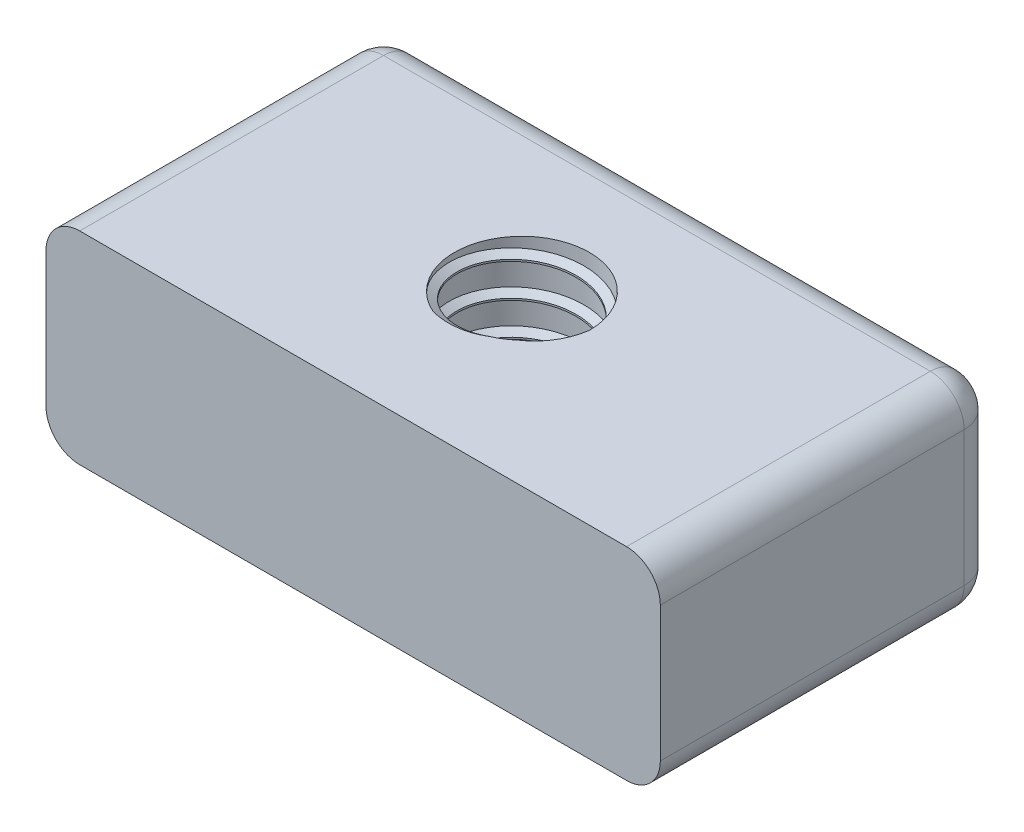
ISO-10303-21;
HEADER;
FILE_DESCRIPTION(('STEP AP214'),'2;1');
FILE_NAME('part.step','',(''),(''),'','','');
FILE_SCHEMA(('AUTOMOTIVE_DESIGN { 1 0 10303 214 1 1 1 1 }'));
ENDSEC;
DATA;
#1=APPLICATION_CONTEXT('core data for automotive mechanical design processes');
#2=APPLICATION_PROTOCOL_DEFINITION('international standard','automotive_design',2000,#1);
#3=PRODUCT_CONTEXT('',#1,'mechanical');
#4=PRODUCT('Part','Part','',(#3));
#5=PRODUCT_RELATED_PRODUCT_CATEGORY('part','',(#4));
#6=PRODUCT_DEFINITION_FORMATION('','',#4);
#7=PRODUCT_DEFINITION_CONTEXT('part definition',#1,'design');
#8=PRODUCT_DEFINITION('design','',#6,#7);
#9=PRODUCT_DEFINITION_SHAPE('','',#8);
#10=(LENGTH_UNIT() NAMED_UNIT(*) SI_UNIT(.MILLI.,.METRE.));
#11=(NAMED_UNIT(*) PLANE_ANGLE_UNIT() SI_UNIT($,.RADIAN.));
#12=(NAMED_UNIT(*) SI_UNIT($,.STERADIAN.) SOLID_ANGLE_UNIT());
#13=UNCERTAINTY_MEASURE_WITH_UNIT(LENGTH_MEASURE(1.E-05),#10,'distance_accuracy_value','');
#14=(GEOMETRIC_REPRESENTATION_CONTEXT(3) GLOBAL_UNCERTAINTY_ASSIGNED_CONTEXT((#13)) GLOBAL_UNIT_ASSIGNED_CONTEXT((#10,
#11,#12)) REPRESENTATION_CONTEXT('',''));
#15=CARTESIAN_POINT('',(0.,0.,0.));
#16=DIRECTION('',(0.,0.,1.));
#17=DIRECTION('',(1.,0.,0.));
#18=AXIS2_PLACEMENT_3D('',#15,#16,#17);
#19=CARTESIAN_POINT('',(-36.645679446,0.926041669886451,-25.));
#20=CARTESIAN_POINT('',(-36.645679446,1.13437500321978,-27.3725080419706));
#21=CARTESIAN_POINT('',(-37.8319334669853,1.34270833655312,-29.427160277));
#22=CARTESIAN_POINT('',(-39.0181874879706,1.55104166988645,-31.4818125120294));
#23=CARTESIAN_POINT('',(-41.072839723,1.75937500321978,-32.6680665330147));
#24=CARTESIAN_POINT('',(-43.1274919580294,1.96770833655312,-33.854320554));
#25=CARTESIAN_POINT('',(-45.5,2.17604166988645,-33.854320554));
#26=CARTESIAN_POINT('',(-47.8725080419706,2.38437500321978,-33.854320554));
#27=CARTESIAN_POINT('',(-49.927160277,2.59270833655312,-32.6680665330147));
#28=CARTESIAN_POINT('',(-51.9818125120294,2.80104166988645,-31.4818125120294));
#29=CARTESIAN_POINT('',(-53.1680665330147,3.00937500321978,-29.427160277));
#30=CARTESIAN_POINT('',(-54.354320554,3.21770833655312,-27.3725080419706));
#31=CARTESIAN_POINT('',(-54.354320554,3.42604166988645,-25.));
#32=CARTESIAN_POINT('',(-54.354320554,3.63437500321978,-22.6274919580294));
#33=CARTESIAN_POINT('',(-53.1680665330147,3.84270833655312,-20.572839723));
#34=CARTESIAN_POINT('',(-51.9818125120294,4.05104166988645,-18.5181874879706));
#35=CARTESIAN_POINT('',(-49.927160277,4.25937500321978,-17.3319334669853));
#36=CARTESIAN_POINT('',(-47.8725080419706,4.46770833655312,-16.145679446));
#37=CARTESIAN_POINT('',(-45.5,4.67604166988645,-16.145679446));
#38=CARTESIAN_POINT('',(-43.1274919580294,4.88437500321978,-16.145679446));
#39=CARTESIAN_POINT('',(-41.072839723,5.09270833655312,-17.3319334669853));
#40=CARTESIAN_POINT('',(-39.0181874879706,5.30104166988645,-18.5181874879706));
#41=CARTESIAN_POINT('',(-37.8319334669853,5.50937500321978,-20.572839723));
#42=CARTESIAN_POINT('',(-36.645679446,5.71770833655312,-22.6274919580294));
#43=CARTESIAN_POINT('',(-36.645679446,5.92604166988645,-25.));
#44=CARTESIAN_POINT('',(-36.645679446,6.13437500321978,-27.3725080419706));
#45=CARTESIAN_POINT('',(-37.8319334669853,6.34270833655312,-29.427160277));
#46=CARTESIAN_POINT('',(-39.0181874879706,6.55104166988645,-31.4818125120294));
#47=CARTESIAN_POINT('',(-41.072839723,6.75937500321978,-32.6680665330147));
#48=CARTESIAN_POINT('',(-43.1274919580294,6.96770833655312,-33.854320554));
#49=CARTESIAN_POINT('',(-45.5,7.17604166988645,-33.854320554));
#50=CARTESIAN_POINT('',(-47.8725080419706,7.38437500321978,-33.854320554));
#51=CARTESIAN_POINT('',(-49.927160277,7.59270833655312,-32.6680665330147));
#52=CARTESIAN_POINT('',(-51.9818125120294,7.80104166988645,-31.4818125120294));
#53=CARTESIAN_POINT('',(-53.1680665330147,8.00937500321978,-29.427160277));
#54=CARTESIAN_POINT('',(-54.354320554,8.21770833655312,-27.3725080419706));
#55=CARTESIAN_POINT('',(-54.354320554,8.42604166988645,-25.));
#56=CARTESIAN_POINT('',(-54.354320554,8.63437500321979,-22.6274919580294));
#57=CARTESIAN_POINT('',(-53.1680665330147,8.84270833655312,-20.572839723));
#58=CARTESIAN_POINT('',(-51.9818125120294,9.05104166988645,-18.5181874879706));
#59=CARTESIAN_POINT('',(-49.927160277,9.25937500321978,-17.3319334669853));
#60=CARTESIAN_POINT('',(-47.8725080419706,9.46770833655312,-16.145679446));
#61=CARTESIAN_POINT('',(-45.5,9.67604166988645,-16.145679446));
#62=CARTESIAN_POINT('',(-43.1274919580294,9.88437500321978,-16.145679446));
#63=CARTESIAN_POINT('',(-41.072839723,10.0927083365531,-17.3319334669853));
#64=CARTESIAN_POINT('',(-39.0181874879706,10.3010416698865,-18.5181874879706));
#65=CARTESIAN_POINT('',(-37.8319334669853,10.5093750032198,-20.572839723));
#66=CARTESIAN_POINT('',(-36.645679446,10.7177083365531,-22.6274919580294));
#67=CARTESIAN_POINT('',(-36.645679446,10.9260416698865,-25.));
#68=CARTESIAN_POINT('',(-36.645679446,11.1343750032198,-27.3725080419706));
#69=CARTESIAN_POINT('',(-37.8319334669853,11.3427083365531,-29.427160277));
#70=CARTESIAN_POINT('',(-39.0181874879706,11.5510416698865,-31.4818125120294));
#71=CARTESIAN_POINT('',(-41.072839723,11.7593750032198,-32.6680665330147));
#72=CARTESIAN_POINT('',(-43.1274919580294,11.9677083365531,-33.854320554));
#73=CARTESIAN_POINT('',(-45.5,12.1760416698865,-33.854320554));
#74=CARTESIAN_POINT('',(-47.8725080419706,12.3843750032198,-33.854320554));
#75=CARTESIAN_POINT('',(-49.927160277,12.5927083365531,-32.6680665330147));
#76=CARTESIAN_POINT('',(-51.9818125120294,12.8010416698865,-31.4818125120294));
#77=CARTESIAN_POINT('',(-53.1680665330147,13.0093750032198,-29.427160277));
#78=CARTESIAN_POINT('',(-54.354320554,13.2177083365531,-27.3725080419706));
#79=CARTESIAN_POINT('',(-54.354320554,13.4260416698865,-25.));
#80=CARTESIAN_POINT('',(-54.354320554,13.6343750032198,-22.6274919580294));
#81=CARTESIAN_POINT('',(-53.1680665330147,13.8427083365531,-20.572839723));
#82=CARTESIAN_POINT('',(-51.9818125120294,14.0510416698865,-18.5181874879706));
#83=CARTESIAN_POINT('',(-49.927160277,14.2593750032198,-17.3319334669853));
#84=CARTESIAN_POINT('',(-47.8725080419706,14.4677083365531,-16.145679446));
#85=CARTESIAN_POINT('',(-45.5,14.6760416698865,-16.145679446));
#86=CARTESIAN_POINT('',(-43.1274919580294,14.8843750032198,-16.145679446));
#87=CARTESIAN_POINT('',(-41.072839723,15.0927083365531,-17.3319334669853));
#88=CARTESIAN_POINT('',(-39.0181874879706,15.3010416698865,-18.5181874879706));
#89=CARTESIAN_POINT('',(-37.8319334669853,15.5093750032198,-20.572839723));
#90=CARTESIAN_POINT('',(-36.645679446,15.7177083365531,-22.6274919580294));
#91=CARTESIAN_POINT('',(-36.645679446,15.9260416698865,-25.));
#92=CARTESIAN_POINT('',(-36.645679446,16.1343750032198,-27.3725080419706));
#93=CARTESIAN_POINT('',(-37.8319334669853,16.3427083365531,-29.427160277));
#94=CARTESIAN_POINT('',(-39.0181874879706,16.5510416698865,-31.4818125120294));
#95=CARTESIAN_POINT('',(-41.072839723,16.7593750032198,-32.6680665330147));
#96=CARTESIAN_POINT('',(-43.1274919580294,16.9677083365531,-33.854320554));
#97=CARTESIAN_POINT('',(-45.5,17.1760416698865,-33.854320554));
#98=CARTESIAN_POINT('',(-47.8725080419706,17.3843750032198,-33.854320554));
#99=CARTESIAN_POINT('',(-49.927160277,17.5927083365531,-32.6680665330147));
#100=CARTESIAN_POINT('',(-51.9818125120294,17.8010416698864,-31.4818125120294));
#101=CARTESIAN_POINT('',(-53.1680665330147,18.0093750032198,-29.427160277));
#102=CARTESIAN_POINT('',(-54.354320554,18.2177083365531,-27.3725080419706));
#103=CARTESIAN_POINT('',(-54.354320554,18.4260416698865,-25.));
#104=CARTESIAN_POINT('',(-54.354320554,18.6343750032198,-22.6274919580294));
#105=CARTESIAN_POINT('',(-53.1680665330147,18.8427083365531,-20.572839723));
#106=CARTESIAN_POINT('',(-51.9818125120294,19.0510416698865,-18.5181874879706));
#107=CARTESIAN_POINT('',(-49.927160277,19.2593750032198,-17.3319334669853));
#108=CARTESIAN_POINT('',(-47.8725080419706,19.4677083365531,-16.145679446));
#109=CARTESIAN_POINT('',(-45.5,19.6760416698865,-16.145679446));
#110=CARTESIAN_POINT('',(-43.1274919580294,19.8843750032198,-16.145679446));
#111=CARTESIAN_POINT('',(-41.072839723,20.0927083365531,-17.3319334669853));
#112=CARTESIAN_POINT('',(-39.0181874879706,20.3010416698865,-18.5181874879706));
#113=CARTESIAN_POINT('',(-37.8319334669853,20.5093750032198,-20.572839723));
#114=CARTESIAN_POINT('',(-36.645679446,20.7177083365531,-22.6274919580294));
#115=CARTESIAN_POINT('',(-36.645679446,20.9260416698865,-25.));
#116=CARTESIAN_POINT('',(-36.645679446,21.1343750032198,-27.3725080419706));
#117=CARTESIAN_POINT('',(-37.8319334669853,21.3427083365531,-29.427160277));
#118=CARTESIAN_POINT('',(-39.0181874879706,21.5510416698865,-31.4818125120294));
#119=CARTESIAN_POINT('',(-41.072839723,21.7593750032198,-32.6680665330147));
#120=CARTESIAN_POINT('',(-43.1274919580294,21.9677083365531,-33.854320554));
#121=CARTESIAN_POINT('',(-45.5,22.1760416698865,-33.854320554));
#122=CARTESIAN_POINT('',(-47.8725080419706,22.3843750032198,-33.854320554));
#123=CARTESIAN_POINT('',(-49.927160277,22.5927083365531,-32.6680665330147));
#124=CARTESIAN_POINT('',(-51.9818125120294,22.8010416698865,-31.4818125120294));
#125=CARTESIAN_POINT('',(-53.1680665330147,23.0093750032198,-29.427160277));
#126=CARTESIAN_POINT('',(-54.354320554,23.2177083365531,-27.3725080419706));
#127=CARTESIAN_POINT('',(-54.354320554,23.4260416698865,-25.));
#128=CARTESIAN_POINT('',(-54.354320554,23.6343750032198,-22.6274919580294));
#129=CARTESIAN_POINT('',(-53.1680665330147,23.8427083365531,-20.572839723));
#130=CARTESIAN_POINT('',(-51.9818125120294,24.0510416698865,-18.5181874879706));
#131=CARTESIAN_POINT('',(-49.927160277,24.2593750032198,-17.3319334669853));
#132=CARTESIAN_POINT('',(-47.8725080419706,24.4677083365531,-16.145679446));
#133=CARTESIAN_POINT('',(-45.5,24.6760416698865,-16.145679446));
#134=CARTESIAN_POINT('',(-43.1274919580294,24.8843750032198,-16.145679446));
#135=CARTESIAN_POINT('',(-41.072839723,25.0927083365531,-17.3319334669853));
#136=CARTESIAN_POINT('',(-39.0181874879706,25.3010416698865,-18.5181874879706));
#137=CARTESIAN_POINT('',(-37.8319334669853,25.5093750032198,-20.572839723));
#138=CARTESIAN_POINT('',(-36.645679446,25.7177083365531,-22.6274919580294));
#139=CARTESIAN_POINT('',(-36.645679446,25.9260416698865,-25.));
#140=CARTESIAN_POINT('',(-36.645679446,26.1343750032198,-27.3725080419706));
#141=CARTESIAN_POINT('',(-37.8319334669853,26.3427083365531,-29.427160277));
#142=CARTESIAN_POINT('',(-39.0181874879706,26.5510416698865,-31.4818125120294));
#143=CARTESIAN_POINT('',(-41.072839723,26.7593750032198,-32.6680665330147));
#144=CARTESIAN_POINT('',(-43.1274919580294,26.9677083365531,-33.854320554));
#145=CARTESIAN_POINT('',(-45.5,27.1760416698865,-33.854320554));
#146=CARTESIAN_POINT('',(-47.8725080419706,27.3843750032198,-33.854320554));
#147=CARTESIAN_POINT('',(-49.927160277,27.5927083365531,-32.6680665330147));
#148=CARTESIAN_POINT('',(-51.9818125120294,27.8010416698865,-31.4818125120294));
#149=CARTESIAN_POINT('',(-53.1680665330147,28.0093750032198,-29.427160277));
#150=CARTESIAN_POINT('',(-54.354320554,28.2177083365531,-27.3725080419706));
#151=CARTESIAN_POINT('',(-54.354320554,28.4260416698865,-25.));
#152=CARTESIAN_POINT('',(-54.354320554,28.6343750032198,-22.6274919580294));
#153=CARTESIAN_POINT('',(-53.1680665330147,28.8427083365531,-20.572839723));
#154=CARTESIAN_POINT('',(-51.9818125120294,29.0510416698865,-18.5181874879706));
#155=CARTESIAN_POINT('',(-49.927160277,29.2593750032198,-17.3319334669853));
#156=CARTESIAN_POINT('',(-47.8725080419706,29.4677083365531,-16.145679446));
#157=CARTESIAN_POINT('',(-45.5,29.6760416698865,-16.145679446));
#158=CARTESIAN_POINT('',(-43.1274919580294,29.8843750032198,-16.145679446));
#159=CARTESIAN_POINT('',(-41.072839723,30.0927083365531,-17.3319334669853));
#160=CARTESIAN_POINT('',(-39.0181874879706,30.3010416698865,-18.5181874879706));
#161=CARTESIAN_POINT('',(-37.8319334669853,30.5093750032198,-20.572839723));
#162=CARTESIAN_POINT('',(-36.645679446,30.7177083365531,-22.6274919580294));
#163=CARTESIAN_POINT('',(-36.645679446,30.9260416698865,-25.));
#164=CARTESIAN_POINT('',(-36.645679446,0.661458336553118,-25.));
#165=CARTESIAN_POINT('',(-36.645679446,0.869791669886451,-27.3725080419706));
#166=CARTESIAN_POINT('',(-37.8319334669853,1.07812500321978,-29.427160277));
#167=CARTESIAN_POINT('',(-39.0181874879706,1.28645833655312,-31.4818125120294));
#168=CARTESIAN_POINT('',(-41.072839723,1.49479166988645,-32.6680665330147));
#169=CARTESIAN_POINT('',(-43.1274919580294,1.70312500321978,-33.854320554));
#170=CARTESIAN_POINT('',(-45.5,1.91145833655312,-33.854320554));
#171=CARTESIAN_POINT('',(-47.8725080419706,2.11979166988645,-33.854320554));
#172=CARTESIAN_POINT('',(-49.927160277,2.32812500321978,-32.6680665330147));
#173=CARTESIAN_POINT('',(-51.9818125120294,2.53645833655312,-31.4818125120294));
#174=CARTESIAN_POINT('',(-53.1680665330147,2.74479166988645,-29.427160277));
#175=CARTESIAN_POINT('',(-54.354320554,2.95312500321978,-27.3725080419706));
#176=CARTESIAN_POINT('',(-54.354320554,3.16145833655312,-25.));
#177=CARTESIAN_POINT('',(-54.354320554,3.36979166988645,-22.6274919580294));
#178=CARTESIAN_POINT('',(-53.1680665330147,3.57812500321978,-20.572839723));
#179=CARTESIAN_POINT('',(-51.9818125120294,3.78645833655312,-18.5181874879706));
#180=CARTESIAN_POINT('',(-49.927160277,3.99479166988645,-17.3319334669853));
#181=CARTESIAN_POINT('',(-47.8725080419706,4.20312500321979,-16.145679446));
#182=CARTESIAN_POINT('',(-45.5,4.41145833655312,-16.145679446));
#183=CARTESIAN_POINT('',(-43.1274919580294,4.61979166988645,-16.145679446));
#184=CARTESIAN_POINT('',(-41.072839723,4.82812500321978,-17.3319334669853));
#185=CARTESIAN_POINT('',(-39.0181874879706,5.03645833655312,-18.5181874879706));
#186=CARTESIAN_POINT('',(-37.8319334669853,5.24479166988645,-20.572839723));
#187=CARTESIAN_POINT('',(-36.645679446,5.45312500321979,-22.6274919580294));
#188=CARTESIAN_POINT('',(-36.645679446,5.66145833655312,-25.));
#189=CARTESIAN_POINT('',(-36.645679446,5.86979166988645,-27.3725080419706));
#190=CARTESIAN_POINT('',(-37.8319334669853,6.07812500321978,-29.427160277));
#191=CARTESIAN_POINT('',(-39.0181874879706,6.28645833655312,-31.4818125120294));
#192=CARTESIAN_POINT('',(-41.072839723,6.49479166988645,-32.6680665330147));
#193=CARTESIAN_POINT('',(-43.1274919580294,6.70312500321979,-33.854320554));
#194=CARTESIAN_POINT('',(-45.5,6.91145833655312,-33.854320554));
#195=CARTESIAN_POINT('',(-47.8725080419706,7.11979166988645,-33.854320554));
#196=CARTESIAN_POINT('',(-49.927160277,7.32812500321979,-32.6680665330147));
#197=CARTESIAN_POINT('',(-51.9818125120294,7.53645833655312,-31.4818125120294));
#198=CARTESIAN_POINT('',(-53.1680665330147,7.74479166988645,-29.427160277));
#199=CARTESIAN_POINT('',(-54.354320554,7.95312500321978,-27.3725080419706));
#200=CARTESIAN_POINT('',(-54.354320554,8.16145833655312,-25.));
#201=CARTESIAN_POINT('',(-54.354320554,8.36979166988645,-22.6274919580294));
#202=CARTESIAN_POINT('',(-53.1680665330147,8.57812500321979,-20.572839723));
#203=CARTESIAN_POINT('',(-51.9818125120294,8.78645833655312,-18.5181874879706));
#204=CARTESIAN_POINT('',(-49.927160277,8.99479166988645,-17.3319334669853));
#205=CARTESIAN_POINT('',(-47.8725080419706,9.20312500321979,-16.145679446));
#206=CARTESIAN_POINT('',(-45.5,9.41145833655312,-16.145679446));
#207=CARTESIAN_POINT('',(-43.1274919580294,9.61979166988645,-16.145679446));
#208=CARTESIAN_POINT('',(-41.072839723,9.82812500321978,-17.3319334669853));
#209=CARTESIAN_POINT('',(-39.0181874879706,10.0364583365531,-18.5181874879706));
#210=CARTESIAN_POINT('',(-37.8319334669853,10.2447916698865,-20.572839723));
#211=CARTESIAN_POINT('',(-36.645679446,10.4531250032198,-22.6274919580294));
#212=CARTESIAN_POINT('',(-36.645679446,10.6614583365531,-25.));
#213=CARTESIAN_POINT('',(-36.645679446,10.8697916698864,-27.3725080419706));
#214=CARTESIAN_POINT('',(-37.8319334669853,11.0781250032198,-29.427160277));
#215=CARTESIAN_POINT('',(-39.0181874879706,11.2864583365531,-31.4818125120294));
#216=CARTESIAN_POINT('',(-41.072839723,11.4947916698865,-32.6680665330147));
#217=CARTESIAN_POINT('',(-43.1274919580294,11.7031250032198,-33.854320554));
#218=CARTESIAN_POINT('',(-45.5,11.9114583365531,-33.854320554));
#219=CARTESIAN_POINT('',(-47.8725080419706,12.1197916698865,-33.854320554));
#220=CARTESIAN_POINT('',(-49.927160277,12.3281250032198,-32.6680665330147));
#221=CARTESIAN_POINT('',(-51.9818125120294,12.5364583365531,-31.4818125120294));
#222=CARTESIAN_POINT('',(-53.1680665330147,12.7447916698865,-29.427160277));
#223=CARTESIAN_POINT('',(-54.354320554,12.9531250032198,-27.3725080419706));
#224=CARTESIAN_POINT('',(-54.354320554,13.1614583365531,-25.));
#225=CARTESIAN_POINT('',(-54.354320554,13.3697916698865,-22.6274919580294));
#226=CARTESIAN_POINT('',(-53.1680665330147,13.5781250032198,-20.572839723));
#227=CARTESIAN_POINT('',(-51.9818125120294,13.7864583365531,-18.5181874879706));
#228=CARTESIAN_POINT('',(-49.927160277,13.9947916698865,-17.3319334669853));
#229=CARTESIAN_POINT('',(-47.8725080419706,14.2031250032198,-16.145679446));
#230=CARTESIAN_POINT('',(-45.5,14.4114583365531,-16.145679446));
#231=CARTESIAN_POINT('',(-43.1274919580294,14.6197916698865,-16.145679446));
#232=CARTESIAN_POINT('',(-41.072839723,14.8281250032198,-17.3319334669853));
#233=CARTESIAN_POINT('',(-39.0181874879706,15.0364583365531,-18.5181874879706));
#234=CARTESIAN_POINT('',(-37.8319334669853,15.2447916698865,-20.572839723));
#235=CARTESIAN_POINT('',(-36.645679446,15.4531250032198,-22.6274919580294));
#236=CARTESIAN_POINT('',(-36.645679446,15.6614583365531,-25.));
#237=CARTESIAN_POINT('',(-36.645679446,15.8697916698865,-27.3725080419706));
#238=CARTESIAN_POINT('',(-37.8319334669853,16.0781250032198,-29.427160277));
#239=CARTESIAN_POINT('',(-39.0181874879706,16.2864583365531,-31.4818125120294));
#240=CARTESIAN_POINT('',(-41.072839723,16.4947916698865,-32.6680665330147));
#241=CARTESIAN_POINT('',(-43.1274919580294,16.7031250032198,-33.854320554));
#242=CARTESIAN_POINT('',(-45.5,16.9114583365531,-33.854320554));
#243=CARTESIAN_POINT('',(-47.8725080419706,17.1197916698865,-33.854320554));
#244=CARTESIAN_POINT('',(-49.927160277,17.3281250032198,-32.6680665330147));
#245=CARTESIAN_POINT('',(-51.9818125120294,17.5364583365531,-31.4818125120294));
#246=CARTESIAN_POINT('',(-53.1680665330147,17.7447916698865,-29.427160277));
#247=CARTESIAN_POINT('',(-54.354320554,17.9531250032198,-27.3725080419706));
#248=CARTESIAN_POINT('',(-54.354320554,18.1614583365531,-25.));
#249=CARTESIAN_POINT('',(-54.354320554,18.3697916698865,-22.6274919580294));
#250=CARTESIAN_POINT('',(-53.1680665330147,18.5781250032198,-20.572839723));
#251=CARTESIAN_POINT('',(-51.9818125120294,18.7864583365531,-18.5181874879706));
#252=CARTESIAN_POINT('',(-49.927160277,18.9947916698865,-17.3319334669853));
#253=CARTESIAN_POINT('',(-47.8725080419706,19.2031250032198,-16.145679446));
#254=CARTESIAN_POINT('',(-45.5,19.4114583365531,-16.145679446));
#255=CARTESIAN_POINT('',(-43.1274919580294,19.6197916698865,-16.145679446));
#256=CARTESIAN_POINT('',(-41.072839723,19.8281250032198,-17.3319334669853));
#257=CARTESIAN_POINT('',(-39.0181874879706,20.0364583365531,-18.5181874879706));
#258=CARTESIAN_POINT('',(-37.8319334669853,20.2447916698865,-20.572839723));
#259=CARTESIAN_POINT('',(-36.645679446,20.4531250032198,-22.6274919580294));
#260=CARTESIAN_POINT('',(-36.645679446,20.6614583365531,-25.));
#261=CARTESIAN_POINT('',(-36.645679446,20.8697916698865,-27.3725080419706));
#262=CARTESIAN_POINT('',(-37.8319334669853,21.0781250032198,-29.427160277));
#263=CARTESIAN_POINT('',(-39.0181874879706,21.2864583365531,-31.4818125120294));
#264=CARTESIAN_POINT('',(-41.072839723,21.4947916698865,-32.6680665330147));
#265=CARTESIAN_POINT('',(-43.1274919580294,21.7031250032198,-33.854320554));
#266=CARTESIAN_POINT('',(-45.5,21.9114583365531,-33.854320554));
#267=CARTESIAN_POINT('',(-47.8725080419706,22.1197916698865,-33.854320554));
#268=CARTESIAN_POINT('',(-49.927160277,22.3281250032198,-32.6680665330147));
#269=CARTESIAN_POINT('',(-51.9818125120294,22.5364583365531,-31.4818125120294));
#270=CARTESIAN_POINT('',(-53.1680665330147,22.7447916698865,-29.427160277));
#271=CARTESIAN_POINT('',(-54.354320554,22.9531250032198,-27.3725080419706));
#272=CARTESIAN_POINT('',(-54.354320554,23.1614583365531,-25.));
#273=CARTESIAN_POINT('',(-54.354320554,23.3697916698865,-22.6274919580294));
#274=CARTESIAN_POINT('',(-53.1680665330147,23.5781250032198,-20.572839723));
#275=CARTESIAN_POINT('',(-51.9818125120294,23.7864583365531,-18.5181874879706));
#276=CARTESIAN_POINT('',(-49.927160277,23.9947916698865,-17.3319334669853));
#277=CARTESIAN_POINT('',(-47.8725080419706,24.2031250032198,-16.145679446));
#278=CARTESIAN_POINT('',(-45.5,24.4114583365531,-16.145679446));
#279=CARTESIAN_POINT('',(-43.1274919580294,24.6197916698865,-16.145679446));
#280=CARTESIAN_POINT('',(-41.072839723,24.8281250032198,-17.3319334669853));
#281=CARTESIAN_POINT('',(-39.0181874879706,25.0364583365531,-18.5181874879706));
#282=CARTESIAN_POINT('',(-37.8319334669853,25.2447916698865,-20.572839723));
#283=CARTESIAN_POINT('',(-36.645679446,25.4531250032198,-22.6274919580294));
#284=CARTESIAN_POINT('',(-36.645679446,25.6614583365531,-25.));
#285=CARTESIAN_POINT('',(-36.645679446,25.8697916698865,-27.3725080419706));
#286=CARTESIAN_POINT('',(-37.8319334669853,26.0781250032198,-29.427160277));
#287=CARTESIAN_POINT('',(-39.0181874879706,26.2864583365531,-31.4818125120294));
#288=CARTESIAN_POINT('',(-41.072839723,26.4947916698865,-32.6680665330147));
#289=CARTESIAN_POINT('',(-43.1274919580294,26.7031250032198,-33.854320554));
#290=CARTESIAN_POINT('',(-45.5,26.9114583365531,-33.854320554));
#291=CARTESIAN_POINT('',(-47.8725080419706,27.1197916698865,-33.854320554));
#292=CARTESIAN_POINT('',(-49.927160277,27.3281250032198,-32.6680665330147));
#293=CARTESIAN_POINT('',(-51.9818125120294,27.5364583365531,-31.4818125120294));
#294=CARTESIAN_POINT('',(-53.1680665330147,27.7447916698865,-29.427160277));
#295=CARTESIAN_POINT('',(-54.354320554,27.9531250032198,-27.3725080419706));
#296=CARTESIAN_POINT('',(-54.354320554,28.1614583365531,-25.));
#297=CARTESIAN_POINT('',(-54.354320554,28.3697916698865,-22.6274919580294));
#298=CARTESIAN_POINT('',(-53.1680665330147,28.5781250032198,-20.572839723));
#299=CARTESIAN_POINT('',(-51.9818125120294,28.7864583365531,-18.5181874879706));
#300=CARTESIAN_POINT('',(-49.927160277,28.9947916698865,-17.3319334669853));
#301=CARTESIAN_POINT('',(-47.8725080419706,29.2031250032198,-16.145679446));
#302=CARTESIAN_POINT('',(-45.5,29.4114583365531,-16.145679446));
#303=CARTESIAN_POINT('',(-43.1274919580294,29.6197916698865,-16.145679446));
#304=CARTESIAN_POINT('',(-41.072839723,29.8281250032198,-17.3319334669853));
#305=CARTESIAN_POINT('',(-39.0181874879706,30.0364583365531,-18.5181874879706));
#306=CARTESIAN_POINT('',(-37.8319334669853,30.2447916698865,-20.572839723));
#307=CARTESIAN_POINT('',(-36.645679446,30.4531250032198,-22.6274919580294));
#308=CARTESIAN_POINT('',(-36.645679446,30.6614583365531,-25.));
#309=(BOUNDED_SURFACE() B_SPLINE_SURFACE(1,2,((#19,#20,#21,#22,#23,#24,#25,#26,#27,#28,#29,#30,
#31,#32,#33,#34,#35,#36,#37,#38,#39,#40,#41,#42,#43,#44,#45,#46,#47,#48,#49,#50,#51,#52,#53,#54,
#55,#56,#57,#58,#59,#60,#61,#62,#63,#64,#65,#66,#67,#68,#69,#70,#71,#72,#73,#74,#75,#76,#77,#78,
#79,#80,#81,#82,#83,#84,#85,#86,#87,#88,#89,#90,#91,#92,#93,#94,#95,#96,#97,#98,#99,#100,#101,
#102,#103,#104,#105,#106,#107,#108,#109,#110,#111,#112,#113,#114,#115,#116,#117,#118,#119,#120,
#121,#122,#123,#124,#125,#126,#127,#128,#129,#130,#131,#132,#133,#134,#135,#136,#137,#138,#139,
#140,#141,#142,#143,#144,#145,#146,#147,#148,#149,#150,#151,#152,#153,#154,#155,#156,#157,#158,
#159,#160,#161,#162,#163),(#164,#165,#166,#167,#168,#169,#170,#171,#172,#173,#174,#175,#176,
#177,#178,#179,#180,#181,#182,#183,#184,#185,#186,#187,#188,#189,#190,#191,#192,#193,#194,#195,
#196,#197,#198,#199,#200,#201,#202,#203,#204,#205,#206,#207,#208,#209,#210,#211,#212,#213,#214,
#215,#216,#217,#218,#219,#220,#221,#222,#223,#224,#225,#226,#227,#228,#229,#230,#231,#232,#233,
#234,#235,#236,#237,#238,#239,#240,#241,#242,#243,#244,#245,#246,#247,#248,#249,#250,#251,#252,
#253,#254,#255,#256,#257,#258,#259,#260,#261,#262,#263,#264,#265,#266,#267,#268,#269,#270,#271,
#272,#273,#274,#275,#276,#277,#278,#279,#280,#281,#282,#283,#284,#285,#286,#287,#288,#289,#290,
#291,#292,#293,#294,#295,#296,#297,#298,#299,#300,#301,#302,#303,#304,#305,#306,#307,#308)),
.UNSPECIFIED.,.F.,.F.,.F.) B_SPLINE_SURFACE_WITH_KNOTS((2,2),(3,2,2,2,2,2,2,2,2,2,2,2,2,2,2,2,2,
2,2,2,2,2,2,2,2,2,2,2,2,2,2,2,2,2,2,2,2,2,2,2,2,2,2,2,2,2,2,2,2,2,2,2,2,2,2,2,2,2,2,2,2,2,2,2,2,
2,2,2,2,2,2,2,3),(0.,1.),(0.,0.0138888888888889,0.0277777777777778,0.0416666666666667,
0.0555555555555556,0.0694444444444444,0.0833333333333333,0.0972222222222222,0.111111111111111,
0.125,0.138888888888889,0.152777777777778,0.166666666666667,0.180555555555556,0.194444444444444,
0.208333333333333,0.222222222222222,0.236111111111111,0.25,0.263888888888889,0.277777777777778,
0.291666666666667,0.305555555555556,0.319444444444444,0.333333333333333,0.347222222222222,
0.361111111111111,0.375,0.388888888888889,0.402777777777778,0.416666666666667,0.430555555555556,
0.444444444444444,0.458333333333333,0.472222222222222,0.486111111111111,0.5,0.513888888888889,
0.527777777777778,0.541666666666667,0.555555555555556,0.569444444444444,0.583333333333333,
0.597222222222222,0.611111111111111,0.625,0.638888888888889,0.652777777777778,0.666666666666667,
0.680555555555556,0.694444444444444,0.708333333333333,0.722222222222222,0.736111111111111,0.75,
0.763888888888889,0.777777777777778,0.791666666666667,0.805555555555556,0.819444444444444,
0.833333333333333,0.847222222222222,0.861111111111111,0.875,0.888888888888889,0.902777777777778,
0.916666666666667,0.930555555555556,0.944444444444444,0.958333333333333,0.972222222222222,
0.986111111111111,1.),
.UNSPECIFIED.) GEOMETRIC_REPRESENTATION_ITEM() RATIONAL_B_SPLINE_SURFACE(((1.,0.965925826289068,
1.,0.965925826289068,1.,0.965925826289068,1.,0.965925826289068,1.,0.965925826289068,1.,
0.965925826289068,1.,0.965925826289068,1.,0.965925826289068,1.,0.965925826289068,1.,
0.965925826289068,1.,0.965925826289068,1.,0.965925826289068,1.,0.965925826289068,1.,
0.965925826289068,1.,0.965925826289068,1.,0.965925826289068,1.,0.965925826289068,1.,
0.965925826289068,1.,0.965925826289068,1.,0.965925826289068,1.,0.965925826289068,1.,
0.965925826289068,1.,0.965925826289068,1.,0.965925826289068,1.,0.965925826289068,1.,
0.965925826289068,1.,0.965925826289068,1.,0.965925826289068,1.,0.965925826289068,1.,
0.965925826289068,1.,0.965925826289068,1.,0.965925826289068,1.,0.965925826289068,1.,
0.965925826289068,1.,0.965925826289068,1.,0.965925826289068,1.,0.965925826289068,1.,
0.965925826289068,1.,0.965925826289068,1.,0.965925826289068,1.,0.965925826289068,1.,
0.965925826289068,1.,0.965925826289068,1.,0.965925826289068,1.,0.965925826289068,1.,
0.965925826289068,1.,0.965925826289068,1.,0.965925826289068,1.,0.965925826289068,1.,
0.965925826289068,1.,0.965925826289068,1.,0.965925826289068,1.,0.965925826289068,1.,
0.965925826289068,1.,0.965925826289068,1.,0.965925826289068,1.,0.965925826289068,1.,
0.965925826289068,1.,0.965925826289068,1.,0.965925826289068,1.,0.965925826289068,1.,
0.965925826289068,1.,0.965925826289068,1.,0.965925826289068,1.,0.965925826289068,1.,
0.965925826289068,1.,0.965925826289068,1.,0.965925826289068,1.,0.965925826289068,1.,
0.965925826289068,1.,0.965925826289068,1.,0.965925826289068,1.),(1.,0.965925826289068,1.,
0.965925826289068,1.,0.965925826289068,1.,0.965925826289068,1.,0.965925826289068,1.,
0.965925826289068,1.,0.965925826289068,1.,0.965925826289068,1.,0.965925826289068,1.,
0.965925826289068,1.,0.965925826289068,1.,0.965925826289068,1.,0.965925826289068,1.,
0.965925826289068,1.,0.965925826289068,1.,0.965925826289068,1.,0.965925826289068,1.,
0.965925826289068,1.,0.965925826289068,1.,0.965925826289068,1.,0.965925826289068,1.,
0.965925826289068,1.,0.965925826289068,1.,0.965925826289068,1.,0.965925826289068,1.,
0.965925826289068,1.,0.965925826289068,1.,0.965925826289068,1.,0.965925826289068,1.,
0.965925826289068,1.,0.965925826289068,1.,0.965925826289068,1.,0.965925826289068,1.,
0.965925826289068,1.,0.965925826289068,1.,0.965925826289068,1.,0.965925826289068,1.,
0.965925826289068,1.,0.965925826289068,1.,0.965925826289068,1.,0.965925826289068,1.,
0.965925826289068,1.,0.965925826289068,1.,0.965925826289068,1.,0.965925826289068,1.,
0.965925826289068,1.,0.965925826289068,1.,0.965925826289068,1.,0.965925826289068,1.,
0.965925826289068,1.,0.965925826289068,1.,0.965925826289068,1.,0.965925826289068,1.,
0.965925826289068,1.,0.965925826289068,1.,0.965925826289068,1.,0.965925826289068,1.,
0.965925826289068,1.,0.965925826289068,1.,0.965925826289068,1.,0.965925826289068,1.,
0.965925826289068,1.,0.965925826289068,1.,0.965925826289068,1.,0.965925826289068,1.,
0.965925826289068,1.,0.965925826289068,1.,0.965925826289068,1.,0.965925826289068,1.,
0.965925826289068,1.,0.965925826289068,1.,0.965925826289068,1.))) REPRESENTATION_ITEM('') SURFACE());
#310=CARTESIAN_POINT('',(-39.5290546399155,30.,-18.4618959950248));
#311=CARTESIAN_POINT('',(-39.6593730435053,30.,-18.3428719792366));
#312=CARTESIAN_POINT('',(-39.7932615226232,30.,-18.2277538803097));
#313=CARTESIAN_POINT('',(-40.0679047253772,30.,-18.0055343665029));
#314=CARTESIAN_POINT('',(-40.2086705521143,30.,-17.8984466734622));
#315=CARTESIAN_POINT('',(-40.4963920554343,30.,-17.6928672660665));
#316=CARTESIAN_POINT('',(-40.6433492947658,30.,-17.5943777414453));
#317=CARTESIAN_POINT('',(-40.9862661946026,30.,-17.3791634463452));
#318=CARTESIAN_POINT('',(-41.1840997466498,30.,-17.2654094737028));
#319=CARTESIAN_POINT('',(-41.5879819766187,30.,-17.0534767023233));
#320=CARTESIAN_POINT('',(-41.7940320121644,30.,-16.9553004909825));
#321=CARTESIAN_POINT('',(-42.0035623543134,30.,-16.8652648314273));
#322=B_SPLINE_CURVE_WITH_KNOTS('',3,(#310,#311,#312,#313,#314,#315,#316,#317,#318,#319,#320,
#321),.UNSPECIFIED.,.F.,.F.,(4,2,2,2,2,4),(0.,0.529403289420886,1.05969149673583,
1.59011436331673,2.27403268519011,2.95806448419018),.UNSPECIFIED.);
#323=CARTESIAN_POINT('',(-39.5290546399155,30.,-18.4618959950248));
#324=VERTEX_POINT('',#323);
#325=CARTESIAN_POINT('',(-42.0035623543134,30.,-16.8652648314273));
#326=VERTEX_POINT('',#325);
#327=EDGE_CURVE('E139',#324,#326,#322,.T.);
#328=CARTESIAN_POINT('',(-36.645679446,0.661458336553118,-25.));
#329=CARTESIAN_POINT('',(-36.645679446,0.869791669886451,-27.3725080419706));
#330=CARTESIAN_POINT('',(-37.8319334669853,1.07812500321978,-29.427160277));
#331=CARTESIAN_POINT('',(-39.0181874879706,1.28645833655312,-31.4818125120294));
#332=CARTESIAN_POINT('',(-41.072839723,1.49479166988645,-32.6680665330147));
#333=CARTESIAN_POINT('',(-43.1274919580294,1.70312500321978,-33.854320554));
#334=CARTESIAN_POINT('',(-45.5,1.91145833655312,-33.854320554));
#335=CARTESIAN_POINT('',(-47.8725080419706,2.11979166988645,-33.854320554));
#336=CARTESIAN_POINT('',(-49.927160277,2.32812500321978,-32.6680665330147));
#337=CARTESIAN_POINT('',(-51.9818125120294,2.53645833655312,-31.4818125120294));
#338=CARTESIAN_POINT('',(-53.1680665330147,2.74479166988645,-29.427160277));
#339=CARTESIAN_POINT('',(-54.354320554,2.95312500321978,-27.3725080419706));
#340=CARTESIAN_POINT('',(-54.354320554,3.16145833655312,-25.));
#341=CARTESIAN_POINT('',(-54.354320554,3.36979166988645,-22.6274919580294));
#342=CARTESIAN_POINT('',(-53.1680665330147,3.57812500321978,-20.572839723));
#343=CARTESIAN_POINT('',(-51.9818125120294,3.78645833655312,-18.5181874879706));
#344=CARTESIAN_POINT('',(-49.927160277,3.99479166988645,-17.3319334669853));
#345=CARTESIAN_POINT('',(-47.8725080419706,4.20312500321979,-16.145679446));
#346=CARTESIAN_POINT('',(-45.5,4.41145833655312,-16.145679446));
#347=CARTESIAN_POINT('',(-43.1274919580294,4.61979166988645,-16.145679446));
#348=CARTESIAN_POINT('',(-41.072839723,4.82812500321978,-17.3319334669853));
#349=CARTESIAN_POINT('',(-39.0181874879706,5.03645833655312,-18.5181874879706));
#350=CARTESIAN_POINT('',(-37.8319334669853,5.24479166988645,-20.572839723));
#351=CARTESIAN_POINT('',(-36.645679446,5.45312500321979,-22.6274919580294));
#352=CARTESIAN_POINT('',(-36.645679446,5.66145833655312,-25.));
#353=CARTESIAN_POINT('',(-36.645679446,5.86979166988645,-27.3725080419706));
#354=CARTESIAN_POINT('',(-37.8319334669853,6.07812500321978,-29.427160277));
#355=CARTESIAN_POINT('',(-39.0181874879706,6.28645833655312,-31.4818125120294));
#356=CARTESIAN_POINT('',(-41.072839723,6.49479166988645,-32.6680665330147));
#357=CARTESIAN_POINT('',(-43.1274919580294,6.70312500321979,-33.854320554));
#358=CARTESIAN_POINT('',(-45.5,6.91145833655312,-33.854320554));
#359=CARTESIAN_POINT('',(-47.8725080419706,7.11979166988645,-33.854320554));
#360=CARTESIAN_POINT('',(-49.927160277,7.32812500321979,-32.6680665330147));
#361=CARTESIAN_POINT('',(-51.9818125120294,7.53645833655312,-31.4818125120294));
#362=CARTESIAN_POINT('',(-53.1680665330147,7.74479166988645,-29.427160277));
#363=CARTESIAN_POINT('',(-54.354320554,7.95312500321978,-27.3725080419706));
#364=CARTESIAN_POINT('',(-54.354320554,8.16145833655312,-25.));
#365=CARTESIAN_POINT('',(-54.354320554,8.36979166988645,-22.6274919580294));
#366=CARTESIAN_POINT('',(-53.1680665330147,8.57812500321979,-20.572839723));
#367=CARTESIAN_POINT('',(-51.9818125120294,8.78645833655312,-18.5181874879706));
#368=CARTESIAN_POINT('',(-49.927160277,8.99479166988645,-17.3319334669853));
#369=CARTESIAN_POINT('',(-47.8725080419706,9.20312500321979,-16.145679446));
#370=CARTESIAN_POINT('',(-45.5,9.41145833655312,-16.145679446));
#371=CARTESIAN_POINT('',(-43.1274919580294,9.61979166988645,-16.145679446));
#372=CARTESIAN_POINT('',(-41.072839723,9.82812500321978,-17.3319334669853));
#373=CARTESIAN_POINT('',(-39.0181874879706,10.0364583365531,-18.5181874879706));
#374=CARTESIAN_POINT('',(-37.8319334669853,10.2447916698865,-20.572839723));
#375=CARTESIAN_POINT('',(-36.645679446,10.4531250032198,-22.6274919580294));
#376=CARTESIAN_POINT('',(-36.645679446,10.6614583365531,-25.));
#377=CARTESIAN_POINT('',(-36.645679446,10.8697916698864,-27.3725080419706));
#378=CARTESIAN_POINT('',(-37.8319334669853,11.0781250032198,-29.427160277));
#379=CARTESIAN_POINT('',(-39.0181874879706,11.2864583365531,-31.4818125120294));
#380=CARTESIAN_POINT('',(-41.072839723,11.4947916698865,-32.6680665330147));
#381=CARTESIAN_POINT('',(-43.1274919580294,11.7031250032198,-33.854320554));
#382=CARTESIAN_POINT('',(-45.5,11.9114583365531,-33.854320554));
#383=CARTESIAN_POINT('',(-47.8725080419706,12.1197916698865,-33.854320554));
#384=CARTESIAN_POINT('',(-49.927160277,12.3281250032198,-32.6680665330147));
#385=CARTESIAN_POINT('',(-51.9818125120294,12.5364583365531,-31.4818125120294));
#386=CARTESIAN_POINT('',(-53.1680665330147,12.7447916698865,-29.427160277));
#387=CARTESIAN_POINT('',(-54.354320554,12.9531250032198,-27.3725080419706));
#388=CARTESIAN_POINT('',(-54.354320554,13.1614583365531,-25.));
#389=CARTESIAN_POINT('',(-54.354320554,13.3697916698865,-22.6274919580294));
#390=CARTESIAN_POINT('',(-53.1680665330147,13.5781250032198,-20.572839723));
#391=CARTESIAN_POINT('',(-51.9818125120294,13.7864583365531,-18.5181874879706));
#392=CARTESIAN_POINT('',(-49.927160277,13.9947916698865,-17.3319334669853));
#393=CARTESIAN_POINT('',(-47.8725080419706,14.2031250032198,-16.145679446));
#394=CARTESIAN_POINT('',(-45.5,14.4114583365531,-16.145679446));
#395=CARTESIAN_POINT('',(-43.1274919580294,14.6197916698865,-16.145679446));
#396=CARTESIAN_POINT('',(-41.072839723,14.8281250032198,-17.3319334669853));
#397=CARTESIAN_POINT('',(-39.0181874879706,15.0364583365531,-18.5181874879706));
#398=CARTESIAN_POINT('',(-37.8319334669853,15.2447916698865,-20.572839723));
#399=CARTESIAN_POINT('',(-36.645679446,15.4531250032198,-22.6274919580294));
#400=CARTESIAN_POINT('',(-36.645679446,15.6614583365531,-25.));
#401=CARTESIAN_POINT('',(-36.645679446,15.8697916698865,-27.3725080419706));
#402=CARTESIAN_POINT('',(-37.8319334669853,16.0781250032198,-29.427160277));
#403=CARTESIAN_POINT('',(-39.0181874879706,16.2864583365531,-31.4818125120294));
#404=CARTESIAN_POINT('',(-41.072839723,16.4947916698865,-32.6680665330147));
#405=CARTESIAN_POINT('',(-43.1274919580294,16.7031250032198,-33.854320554));
#406=CARTESIAN_POINT('',(-45.5,16.9114583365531,-33.854320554));
#407=CARTESIAN_POINT('',(-47.8725080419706,17.1197916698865,-33.854320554));
#408=CARTESIAN_POINT('',(-49.927160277,17.3281250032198,-32.6680665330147));
#409=CARTESIAN_POINT('',(-51.9818125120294,17.5364583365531,-31.4818125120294));
#410=CARTESIAN_POINT('',(-53.1680665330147,17.7447916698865,-29.427160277));
#411=CARTESIAN_POINT('',(-54.354320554,17.9531250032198,-27.3725080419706));
#412=CARTESIAN_POINT('',(-54.354320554,18.1614583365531,-25.));
#413=CARTESIAN_POINT('',(-54.354320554,18.3697916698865,-22.6274919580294));
#414=CARTESIAN_POINT('',(-53.1680665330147,18.5781250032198,-20.572839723));
#415=CARTESIAN_POINT('',(-51.9818125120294,18.7864583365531,-18.5181874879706));
#416=CARTESIAN_POINT('',(-49.927160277,18.9947916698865,-17.3319334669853));
#417=CARTESIAN_POINT('',(-47.8725080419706,19.2031250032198,-16.145679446));
#418=CARTESIAN_POINT('',(-45.5,19.4114583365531,-16.145679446));
#419=CARTESIAN_POINT('',(-43.1274919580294,19.6197916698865,-16.145679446));
#420=CARTESIAN_POINT('',(-41.072839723,19.8281250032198,-17.3319334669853));
#421=CARTESIAN_POINT('',(-39.0181874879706,20.0364583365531,-18.5181874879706));
#422=CARTESIAN_POINT('',(-37.8319334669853,20.2447916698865,-20.572839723));
#423=CARTESIAN_POINT('',(-36.645679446,20.4531250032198,-22.6274919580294));
#424=CARTESIAN_POINT('',(-36.645679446,20.6614583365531,-25.));
#425=CARTESIAN_POINT('',(-36.645679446,20.8697916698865,-27.3725080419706));
#426=CARTESIAN_POINT('',(-37.8319334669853,21.0781250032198,-29.427160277));
#427=CARTESIAN_POINT('',(-39.0181874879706,21.2864583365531,-31.4818125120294));
#428=CARTESIAN_POINT('',(-41.072839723,21.4947916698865,-32.6680665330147));
#429=CARTESIAN_POINT('',(-43.1274919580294,21.7031250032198,-33.854320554));
#430=CARTESIAN_POINT('',(-45.5,21.9114583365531,-33.854320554));
#431=CARTESIAN_POINT('',(-47.8725080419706,22.1197916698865,-33.854320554));
#432=CARTESIAN_POINT('',(-49.927160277,22.3281250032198,-32.6680665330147));
#433=CARTESIAN_POINT('',(-51.9818125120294,22.5364583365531,-31.4818125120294));
#434=CARTESIAN_POINT('',(-53.1680665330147,22.7447916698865,-29.427160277));
#435=CARTESIAN_POINT('',(-54.354320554,22.9531250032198,-27.3725080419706));
#436=CARTESIAN_POINT('',(-54.354320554,23.1614583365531,-25.));
#437=CARTESIAN_POINT('',(-54.354320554,23.3697916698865,-22.6274919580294));
#438=CARTESIAN_POINT('',(-53.1680665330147,23.5781250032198,-20.572839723));
#439=CARTESIAN_POINT('',(-51.9818125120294,23.7864583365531,-18.5181874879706));
#440=CARTESIAN_POINT('',(-49.927160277,23.9947916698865,-17.3319334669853));
#441=CARTESIAN_POINT('',(-47.8725080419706,24.2031250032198,-16.145679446));
#442=CARTESIAN_POINT('',(-45.5,24.4114583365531,-16.145679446));
#443=CARTESIAN_POINT('',(-43.1274919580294,24.6197916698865,-16.145679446));
#444=CARTESIAN_POINT('',(-41.072839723,24.8281250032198,-17.3319334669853));
#445=CARTESIAN_POINT('',(-39.0181874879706,25.0364583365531,-18.5181874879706));
#446=CARTESIAN_POINT('',(-37.8319334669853,25.2447916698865,-20.572839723));
#447=CARTESIAN_POINT('',(-36.645679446,25.4531250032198,-22.6274919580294));
#448=CARTESIAN_POINT('',(-36.645679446,25.6614583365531,-25.));
#449=CARTESIAN_POINT('',(-36.645679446,25.8697916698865,-27.3725080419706));
#450=CARTESIAN_POINT('',(-37.8319334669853,26.0781250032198,-29.427160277));
#451=CARTESIAN_POINT('',(-39.0181874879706,26.2864583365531,-31.4818125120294));
#452=CARTESIAN_POINT('',(-41.072839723,26.4947916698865,-32.6680665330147));
#453=CARTESIAN_POINT('',(-43.1274919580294,26.7031250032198,-33.854320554));
#454=CARTESIAN_POINT('',(-45.5,26.9114583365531,-33.854320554));
#455=CARTESIAN_POINT('',(-47.8725080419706,27.1197916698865,-33.854320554));
#456=CARTESIAN_POINT('',(-49.927160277,27.3281250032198,-32.6680665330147));
#457=CARTESIAN_POINT('',(-51.9818125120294,27.5364583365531,-31.4818125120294));
#458=CARTESIAN_POINT('',(-53.1680665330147,27.7447916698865,-29.427160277));
#459=CARTESIAN_POINT('',(-54.354320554,27.9531250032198,-27.3725080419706));
#460=CARTESIAN_POINT('',(-54.354320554,28.1614583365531,-25.));
#461=CARTESIAN_POINT('',(-54.354320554,28.3697916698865,-22.6274919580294));
#462=CARTESIAN_POINT('',(-53.1680665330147,28.5781250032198,-20.572839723));
#463=CARTESIAN_POINT('',(-51.9818125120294,28.7864583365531,-18.5181874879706));
#464=CARTESIAN_POINT('',(-49.927160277,28.9947916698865,-17.3319334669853));
#465=CARTESIAN_POINT('',(-47.8725080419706,29.2031250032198,-16.145679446));
#466=CARTESIAN_POINT('',(-45.5,29.4114583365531,-16.145679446));
#467=CARTESIAN_POINT('',(-43.1274919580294,29.6197916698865,-16.145679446));
#468=CARTESIAN_POINT('',(-41.072839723,29.8281250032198,-17.3319334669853));
#469=CARTESIAN_POINT('',(-39.0181874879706,30.0364583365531,-18.5181874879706));
#470=CARTESIAN_POINT('',(-37.8319334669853,30.2447916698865,-20.572839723));
#471=CARTESIAN_POINT('',(-36.645679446,30.4531250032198,-22.6274919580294));
#472=CARTESIAN_POINT('',(-36.645679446,30.6614583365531,-25.));
#473=(BOUNDED_CURVE() B_SPLINE_CURVE(2,(#328,#329,#330,#331,#332,#333,#334,#335,#336,#337,#338,
#339,#340,#341,#342,#343,#344,#345,#346,#347,#348,#349,#350,#351,#352,#353,#354,#355,#356,#357,
#358,#359,#360,#361,#362,#363,#364,#365,#366,#367,#368,#369,#370,#371,#372,#373,#374,#375,#376,
#377,#378,#379,#380,#381,#382,#383,#384,#385,#386,#387,#388,#389,#390,#391,#392,#393,#394,#395,
#396,#397,#398,#399,#400,#401,#402,#403,#404,#405,#406,#407,#408,#409,#410,#411,#412,#413,#414,
#415,#416,#417,#418,#419,#420,#421,#422,#423,#424,#425,#426,#427,#428,#429,#430,#431,#432,#433,
#434,#435,#436,#437,#438,#439,#440,#441,#442,#443,#444,#445,#446,#447,#448,#449,#450,#451,#452,
#453,#454,#455,#456,#457,#458,#459,#460,#461,#462,#463,#464,#465,#466,#467,#468,#469,#470,#471,
#472),.UNSPECIFIED.,.F.,.F.) B_SPLINE_CURVE_WITH_KNOTS((3,2,2,2,2,2,2,2,2,2,2,2,2,2,2,2,2,2,2,2,
2,2,2,2,2,2,2,2,2,2,2,2,2,2,2,2,2,2,2,2,2,2,2,2,2,2,2,2,2,2,2,2,2,2,2,2,2,2,2,2,2,2,2,2,2,2,2,2,
2,2,2,2,3),(0.,0.0138888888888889,0.0277777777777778,0.0416666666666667,0.0555555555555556,
0.0694444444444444,0.0833333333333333,0.0972222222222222,0.111111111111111,0.125,
0.138888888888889,0.152777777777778,0.166666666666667,0.180555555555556,0.194444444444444,
0.208333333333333,0.222222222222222,0.236111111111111,0.25,0.263888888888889,0.277777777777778,
0.291666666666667,0.305555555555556,0.319444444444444,0.333333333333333,0.347222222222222,
0.361111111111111,0.375,0.388888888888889,0.402777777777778,0.416666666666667,0.430555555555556,
0.444444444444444,0.458333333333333,0.472222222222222,0.486111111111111,0.5,0.513888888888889,
0.527777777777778,0.541666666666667,0.555555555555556,0.569444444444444,0.583333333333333,
0.597222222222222,0.611111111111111,0.625,0.638888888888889,0.652777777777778,0.666666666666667,
0.680555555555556,0.694444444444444,0.708333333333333,0.722222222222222,0.736111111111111,0.75,
0.763888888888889,0.777777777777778,0.791666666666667,0.805555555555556,0.819444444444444,
0.833333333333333,0.847222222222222,0.861111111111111,0.875,0.888888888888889,0.902777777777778,
0.916666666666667,0.930555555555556,0.944444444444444,0.958333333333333,0.972222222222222,
0.986111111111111,1.),
.UNSPECIFIED.) CURVE() GEOMETRIC_REPRESENTATION_ITEM() RATIONAL_B_SPLINE_CURVE((1.,
0.965925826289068,1.,0.965925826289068,1.,0.965925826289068,1.,0.965925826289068,1.,
0.965925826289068,1.,0.965925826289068,1.,0.965925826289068,1.,0.965925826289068,1.,
0.965925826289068,1.,0.965925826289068,1.,0.965925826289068,1.,0.965925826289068,1.,
0.965925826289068,1.,0.965925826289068,1.,0.965925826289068,1.,0.965925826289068,1.,
0.965925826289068,1.,0.965925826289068,1.,0.965925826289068,1.,0.965925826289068,1.,
0.965925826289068,1.,0.965925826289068,1.,0.965925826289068,1.,0.965925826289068,1.,
0.965925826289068,1.,0.965925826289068,1.,0.965925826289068,1.,0.965925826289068,1.,
0.965925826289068,1.,0.965925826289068,1.,0.965925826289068,1.,0.965925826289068,1.,
0.965925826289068,1.,0.965925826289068,1.,0.965925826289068,1.,0.965925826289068,1.,
0.965925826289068,1.,0.965925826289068,1.,0.965925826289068,1.,0.965925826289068,1.,
0.965925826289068,1.,0.965925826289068,1.,0.965925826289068,1.,0.965925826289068,1.,
0.965925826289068,1.,0.965925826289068,1.,0.965925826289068,1.,0.965925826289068,1.,
0.965925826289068,1.,0.965925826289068,1.,0.965925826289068,1.,0.965925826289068,1.,
0.965925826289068,1.,0.965925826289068,1.,0.965925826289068,1.,0.965925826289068,1.,
0.965925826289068,1.,0.965925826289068,1.,0.965925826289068,1.,0.965925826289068,1.,
0.965925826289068,1.,0.965925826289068,1.,0.965925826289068,1.,0.965925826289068,1.,
0.965925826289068,1.,0.965925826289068,1.,0.965925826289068,1.,0.965925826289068,1.,
0.965925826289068,1.,0.965925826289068,1.,0.965925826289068,1.,0.965925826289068,1.)) REPRESENTATION_ITEM(''));
#474=CARTESIAN_POINT('',(-36.645679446,0.661458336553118,-25.));
#475=VERTEX_POINT('',#474);
#476=EDGE_CURVE('E153',#475,#324,#473,.T.);
#477=DIRECTION('',(0.,-1.,0.));
#478=VECTOR('',#477,1.);
#479=CARTESIAN_POINT('',(-36.645679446,0.793750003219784,-25.));
#480=LINE('',#479,#478);
#481=CARTESIAN_POINT('',(-36.645679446,0.926041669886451,-25.));
#482=VERTEX_POINT('',#481);
#483=EDGE_CURVE('E191',#482,#475,#480,.T.);
#484=CARTESIAN_POINT('',(-36.645679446,0.926041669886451,-25.));
#485=CARTESIAN_POINT('',(-36.645679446,1.13437500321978,-27.3725080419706));
#486=CARTESIAN_POINT('',(-37.8319334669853,1.34270833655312,-29.427160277));
#487=CARTESIAN_POINT('',(-39.0181874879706,1.55104166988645,-31.4818125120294));
#488=CARTESIAN_POINT('',(-41.072839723,1.75937500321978,-32.6680665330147));
#489=CARTESIAN_POINT('',(-43.1274919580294,1.96770833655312,-33.854320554));
#490=CARTESIAN_POINT('',(-45.5,2.17604166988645,-33.854320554));
#491=CARTESIAN_POINT('',(-47.8725080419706,2.38437500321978,-33.854320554));
#492=CARTESIAN_POINT('',(-49.927160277,2.59270833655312,-32.6680665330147));
#493=CARTESIAN_POINT('',(-51.9818125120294,2.80104166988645,-31.4818125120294));
#494=CARTESIAN_POINT('',(-53.1680665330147,3.00937500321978,-29.427160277));
#495=CARTESIAN_POINT('',(-54.354320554,3.21770833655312,-27.3725080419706));
#496=CARTESIAN_POINT('',(-54.354320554,3.42604166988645,-25.));
#497=CARTESIAN_POINT('',(-54.354320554,3.63437500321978,-22.6274919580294));
#498=CARTESIAN_POINT('',(-53.1680665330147,3.84270833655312,-20.572839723));
#499=CARTESIAN_POINT('',(-51.9818125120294,4.05104166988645,-18.5181874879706));
#500=CARTESIAN_POINT('',(-49.927160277,4.25937500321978,-17.3319334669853));
#501=CARTESIAN_POINT('',(-47.8725080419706,4.46770833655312,-16.145679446));
#502=CARTESIAN_POINT('',(-45.5,4.67604166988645,-16.145679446));
#503=CARTESIAN_POINT('',(-43.1274919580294,4.88437500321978,-16.145679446));
#504=CARTESIAN_POINT('',(-41.072839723,5.09270833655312,-17.3319334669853));
#505=CARTESIAN_POINT('',(-39.0181874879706,5.30104166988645,-18.5181874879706));
#506=CARTESIAN_POINT('',(-37.8319334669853,5.50937500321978,-20.572839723));
#507=CARTESIAN_POINT('',(-36.645679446,5.71770833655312,-22.6274919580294));
#508=CARTESIAN_POINT('',(-36.645679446,5.92604166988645,-25.));
#509=CARTESIAN_POINT('',(-36.645679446,6.13437500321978,-27.3725080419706));
#510=CARTESIAN_POINT('',(-37.8319334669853,6.34270833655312,-29.427160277));
#511=CARTESIAN_POINT('',(-39.0181874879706,6.55104166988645,-31.4818125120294));
#512=CARTESIAN_POINT('',(-41.072839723,6.75937500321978,-32.6680665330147));
#513=CARTESIAN_POINT('',(-43.1274919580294,6.96770833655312,-33.854320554));
#514=CARTESIAN_POINT('',(-45.5,7.17604166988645,-33.854320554));
#515=CARTESIAN_POINT('',(-47.8725080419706,7.38437500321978,-33.854320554));
#516=CARTESIAN_POINT('',(-49.927160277,7.59270833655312,-32.6680665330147));
#517=CARTESIAN_POINT('',(-51.9818125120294,7.80104166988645,-31.4818125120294));
#518=CARTESIAN_POINT('',(-53.1680665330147,8.00937500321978,-29.427160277));
#519=CARTESIAN_POINT('',(-54.354320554,8.21770833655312,-27.3725080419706));
#520=CARTESIAN_POINT('',(-54.354320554,8.42604166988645,-25.));
#521=CARTESIAN_POINT('',(-54.354320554,8.63437500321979,-22.6274919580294));
#522=CARTESIAN_POINT('',(-53.1680665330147,8.84270833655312,-20.572839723));
#523=CARTESIAN_POINT('',(-51.9818125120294,9.05104166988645,-18.5181874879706));
#524=CARTESIAN_POINT('',(-49.927160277,9.25937500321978,-17.3319334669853));
#525=CARTESIAN_POINT('',(-47.8725080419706,9.46770833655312,-16.145679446));
#526=CARTESIAN_POINT('',(-45.5,9.67604166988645,-16.145679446));
#527=CARTESIAN_POINT('',(-43.1274919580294,9.88437500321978,-16.145679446));
#528=CARTESIAN_POINT('',(-41.072839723,10.0927083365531,-17.3319334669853));
#529=CARTESIAN_POINT('',(-39.0181874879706,10.3010416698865,-18.5181874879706));
#530=CARTESIAN_POINT('',(-37.8319334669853,10.5093750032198,-20.572839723));
#531=CARTESIAN_POINT('',(-36.645679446,10.7177083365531,-22.6274919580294));
#532=CARTESIAN_POINT('',(-36.645679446,10.9260416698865,-25.));
#533=CARTESIAN_POINT('',(-36.645679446,11.1343750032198,-27.3725080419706));
#534=CARTESIAN_POINT('',(-37.8319334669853,11.3427083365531,-29.427160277));
#535=CARTESIAN_POINT('',(-39.0181874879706,11.5510416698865,-31.4818125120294));
#536=CARTESIAN_POINT('',(-41.072839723,11.7593750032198,-32.6680665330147));
#537=CARTESIAN_POINT('',(-43.1274919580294,11.9677083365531,-33.854320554));
#538=CARTESIAN_POINT('',(-45.5,12.1760416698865,-33.854320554));
#539=CARTESIAN_POINT('',(-47.8725080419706,12.3843750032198,-33.854320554));
#540=CARTESIAN_POINT('',(-49.927160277,12.5927083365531,-32.6680665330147));
#541=CARTESIAN_POINT('',(-51.9818125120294,12.8010416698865,-31.4818125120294));
#542=CARTESIAN_POINT('',(-53.1680665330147,13.0093750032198,-29.427160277));
#543=CARTESIAN_POINT('',(-54.354320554,13.2177083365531,-27.3725080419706));
#544=CARTESIAN_POINT('',(-54.354320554,13.4260416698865,-25.));
#545=CARTESIAN_POINT('',(-54.354320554,13.6343750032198,-22.6274919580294));
#546=CARTESIAN_POINT('',(-53.1680665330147,13.8427083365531,-20.572839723));
#547=CARTESIAN_POINT('',(-51.9818125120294,14.0510416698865,-18.5181874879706));
#548=CARTESIAN_POINT('',(-49.927160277,14.2593750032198,-17.3319334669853));
#549=CARTESIAN_POINT('',(-47.8725080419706,14.4677083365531,-16.145679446));
#550=CARTESIAN_POINT('',(-45.5,14.6760416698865,-16.145679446));
#551=CARTESIAN_POINT('',(-43.1274919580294,14.8843750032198,-16.145679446));
#552=CARTESIAN_POINT('',(-41.072839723,15.0927083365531,-17.3319334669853));
#553=CARTESIAN_POINT('',(-39.0181874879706,15.3010416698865,-18.5181874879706));
#554=CARTESIAN_POINT('',(-37.8319334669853,15.5093750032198,-20.572839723));
#555=CARTESIAN_POINT('',(-36.645679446,15.7177083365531,-22.6274919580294));
#556=CARTESIAN_POINT('',(-36.645679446,15.9260416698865,-25.));
#557=CARTESIAN_POINT('',(-36.645679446,16.1343750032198,-27.3725080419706));
#558=CARTESIAN_POINT('',(-37.8319334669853,16.3427083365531,-29.427160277));
#559=CARTESIAN_POINT('',(-39.0181874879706,16.5510416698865,-31.4818125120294));
#560=CARTESIAN_POINT('',(-41.072839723,16.7593750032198,-32.6680665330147));
#561=CARTESIAN_POINT('',(-43.1274919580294,16.9677083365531,-33.854320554));
#562=CARTESIAN_POINT('',(-45.5,17.1760416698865,-33.854320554));
#563=CARTESIAN_POINT('',(-47.8725080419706,17.3843750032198,-33.854320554));
#564=CARTESIAN_POINT('',(-49.927160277,17.5927083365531,-32.6680665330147));
#565=CARTESIAN_POINT('',(-51.9818125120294,17.8010416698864,-31.4818125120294));
#566=CARTESIAN_POINT('',(-53.1680665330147,18.0093750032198,-29.427160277));
#567=CARTESIAN_POINT('',(-54.354320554,18.2177083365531,-27.3725080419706));
#568=CARTESIAN_POINT('',(-54.354320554,18.4260416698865,-25.));
#569=CARTESIAN_POINT('',(-54.354320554,18.6343750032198,-22.6274919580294));
#570=CARTESIAN_POINT('',(-53.1680665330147,18.8427083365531,-20.572839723));
#571=CARTESIAN_POINT('',(-51.9818125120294,19.0510416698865,-18.5181874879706));
#572=CARTESIAN_POINT('',(-49.927160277,19.2593750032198,-17.3319334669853));
#573=CARTESIAN_POINT('',(-47.8725080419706,19.4677083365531,-16.145679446));
#574=CARTESIAN_POINT('',(-45.5,19.6760416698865,-16.145679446));
#575=CARTESIAN_POINT('',(-43.1274919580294,19.8843750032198,-16.145679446));
#576=CARTESIAN_POINT('',(-41.072839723,20.0927083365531,-17.3319334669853));
#577=CARTESIAN_POINT('',(-39.0181874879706,20.3010416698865,-18.5181874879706));
#578=CARTESIAN_POINT('',(-37.8319334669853,20.5093750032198,-20.572839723));
#579=CARTESIAN_POINT('',(-36.645679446,20.7177083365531,-22.6274919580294));
#580=CARTESIAN_POINT('',(-36.645679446,20.9260416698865,-25.));
#581=CARTESIAN_POINT('',(-36.645679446,21.1343750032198,-27.3725080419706));
#582=CARTESIAN_POINT('',(-37.8319334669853,21.3427083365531,-29.427160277));
#583=CARTESIAN_POINT('',(-39.0181874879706,21.5510416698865,-31.4818125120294));
#584=CARTESIAN_POINT('',(-41.072839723,21.7593750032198,-32.6680665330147));
#585=CARTESIAN_POINT('',(-43.1274919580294,21.9677083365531,-33.854320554));
#586=CARTESIAN_POINT('',(-45.5,22.1760416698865,-33.854320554));
#587=CARTESIAN_POINT('',(-47.8725080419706,22.3843750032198,-33.854320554));
#588=CARTESIAN_POINT('',(-49.927160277,22.5927083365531,-32.6680665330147));
#589=CARTESIAN_POINT('',(-51.9818125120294,22.8010416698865,-31.4818125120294));
#590=CARTESIAN_POINT('',(-53.1680665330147,23.0093750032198,-29.427160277));
#591=CARTESIAN_POINT('',(-54.354320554,23.2177083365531,-27.3725080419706));
#592=CARTESIAN_POINT('',(-54.354320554,23.4260416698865,-25.));
#593=CARTESIAN_POINT('',(-54.354320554,23.6343750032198,-22.6274919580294));
#594=CARTESIAN_POINT('',(-53.1680665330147,23.8427083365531,-20.572839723));
#595=CARTESIAN_POINT('',(-51.9818125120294,24.0510416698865,-18.5181874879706));
#596=CARTESIAN_POINT('',(-49.927160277,24.2593750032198,-17.3319334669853));
#597=CARTESIAN_POINT('',(-47.8725080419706,24.4677083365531,-16.145679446));
#598=CARTESIAN_POINT('',(-45.5,24.6760416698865,-16.145679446));
#599=CARTESIAN_POINT('',(-43.1274919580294,24.8843750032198,-16.145679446));
#600=CARTESIAN_POINT('',(-41.072839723,25.0927083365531,-17.3319334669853));
#601=CARTESIAN_POINT('',(-39.0181874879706,25.3010416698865,-18.5181874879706));
#602=CARTESIAN_POINT('',(-37.8319334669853,25.5093750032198,-20.572839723));
#603=CARTESIAN_POINT('',(-36.645679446,25.7177083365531,-22.6274919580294));
#604=CARTESIAN_POINT('',(-36.645679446,25.9260416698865,-25.));
#605=CARTESIAN_POINT('',(-36.645679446,26.1343750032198,-27.3725080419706));
#606=CARTESIAN_POINT('',(-37.8319334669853,26.3427083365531,-29.427160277));
#607=CARTESIAN_POINT('',(-39.0181874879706,26.5510416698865,-31.4818125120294));
#608=CARTESIAN_POINT('',(-41.072839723,26.7593750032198,-32.6680665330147));
#609=CARTESIAN_POINT('',(-43.1274919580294,26.9677083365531,-33.854320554));
#610=CARTESIAN_POINT('',(-45.5,27.1760416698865,-33.854320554));
#611=CARTESIAN_POINT('',(-47.8725080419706,27.3843750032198,-33.854320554));
#612=CARTESIAN_POINT('',(-49.927160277,27.5927083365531,-32.6680665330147));
#613=CARTESIAN_POINT('',(-51.9818125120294,27.8010416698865,-31.4818125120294));
#614=CARTESIAN_POINT('',(-53.1680665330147,28.0093750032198,-29.427160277));
#615=CARTESIAN_POINT('',(-54.354320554,28.2177083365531,-27.3725080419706));
#616=CARTESIAN_POINT('',(-54.354320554,28.4260416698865,-25.));
#617=CARTESIAN_POINT('',(-54.354320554,28.6343750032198,-22.6274919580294));
#618=CARTESIAN_POINT('',(-53.1680665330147,28.8427083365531,-20.572839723));
#619=CARTESIAN_POINT('',(-51.9818125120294,29.0510416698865,-18.5181874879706));
#620=CARTESIAN_POINT('',(-49.927160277,29.2593750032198,-17.3319334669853));
#621=CARTESIAN_POINT('',(-47.8725080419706,29.4677083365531,-16.145679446));
#622=CARTESIAN_POINT('',(-45.5,29.6760416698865,-16.145679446));
#623=CARTESIAN_POINT('',(-43.1274919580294,29.8843750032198,-16.145679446));
#624=CARTESIAN_POINT('',(-41.072839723,30.0927083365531,-17.3319334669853));
#625=CARTESIAN_POINT('',(-39.0181874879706,30.3010416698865,-18.5181874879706));
#626=CARTESIAN_POINT('',(-37.8319334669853,30.5093750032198,-20.572839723));
#627=CARTESIAN_POINT('',(-36.645679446,30.7177083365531,-22.6274919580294));
#628=CARTESIAN_POINT('',(-36.645679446,30.9260416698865,-25.));
#629=(BOUNDED_CURVE() B_SPLINE_CURVE(2,(#484,#485,#486,#487,#488,#489,#490,#491,#492,#493,#494,
#495,#496,#497,#498,#499,#500,#501,#502,#503,#504,#505,#506,#507,#508,#509,#510,#511,#512,#513,
#514,#515,#516,#517,#518,#519,#520,#521,#522,#523,#524,#525,#526,#527,#528,#529,#530,#531,#532,
#533,#534,#535,#536,#537,#538,#539,#540,#541,#542,#543,#544,#545,#546,#547,#548,#549,#550,#551,
#552,#553,#554,#555,#556,#557,#558,#559,#560,#561,#562,#563,#564,#565,#566,#567,#568,#569,#570,
#571,#572,#573,#574,#575,#576,#577,#578,#579,#580,#581,#582,#583,#584,#585,#586,#587,#588,#589,
#590,#591,#592,#593,#594,#595,#596,#597,#598,#599,#600,#601,#602,#603,#604,#605,#606,#607,#608,
#609,#610,#611,#612,#613,#614,#615,#616,#617,#618,#619,#620,#621,#622,#623,#624,#625,#626,#627,
#628),.UNSPECIFIED.,.F.,.F.) B_SPLINE_CURVE_WITH_KNOTS((3,2,2,2,2,2,2,2,2,2,2,2,2,2,2,2,2,2,2,2,
2,2,2,2,2,2,2,2,2,2,2,2,2,2,2,2,2,2,2,2,2,2,2,2,2,2,2,2,2,2,2,2,2,2,2,2,2,2,2,2,2,2,2,2,2,2,2,2,
2,2,2,2,3),(0.,0.0138888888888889,0.0277777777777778,0.0416666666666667,0.0555555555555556,
0.0694444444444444,0.0833333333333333,0.0972222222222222,0.111111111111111,0.125,
0.138888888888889,0.152777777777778,0.166666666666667,0.180555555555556,0.194444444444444,
0.208333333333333,0.222222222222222,0.236111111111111,0.25,0.263888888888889,0.277777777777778,
0.291666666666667,0.305555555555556,0.319444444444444,0.333333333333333,0.347222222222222,
0.361111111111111,0.375,0.388888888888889,0.402777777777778,0.416666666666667,0.430555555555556,
0.444444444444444,0.458333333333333,0.472222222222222,0.486111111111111,0.5,0.513888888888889,
0.527777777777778,0.541666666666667,0.555555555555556,0.569444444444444,0.583333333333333,
0.597222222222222,0.611111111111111,0.625,0.638888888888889,0.652777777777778,0.666666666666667,
0.680555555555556,0.694444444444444,0.708333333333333,0.722222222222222,0.736111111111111,0.75,
0.763888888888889,0.777777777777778,0.791666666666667,0.805555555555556,0.819444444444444,
0.833333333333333,0.847222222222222,0.861111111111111,0.875,0.888888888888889,0.902777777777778,
0.916666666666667,0.930555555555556,0.944444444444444,0.958333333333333,0.972222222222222,
0.986111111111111,1.),
.UNSPECIFIED.) CURVE() GEOMETRIC_REPRESENTATION_ITEM() RATIONAL_B_SPLINE_CURVE((1.,
0.965925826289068,1.,0.965925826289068,1.,0.965925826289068,1.,0.965925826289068,1.,
0.965925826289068,1.,0.965925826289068,1.,0.965925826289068,1.,0.965925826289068,1.,
0.965925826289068,1.,0.965925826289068,1.,0.965925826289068,1.,0.965925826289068,1.,
0.965925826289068,1.,0.965925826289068,1.,0.965925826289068,1.,0.965925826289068,1.,
0.965925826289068,1.,0.965925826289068,1.,0.965925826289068,1.,0.965925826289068,1.,
0.965925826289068,1.,0.965925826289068,1.,0.965925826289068,1.,0.965925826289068,1.,
0.965925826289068,1.,0.965925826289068,1.,0.965925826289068,1.,0.965925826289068,1.,
0.965925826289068,1.,0.965925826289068,1.,0.965925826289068,1.,0.965925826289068,1.,
0.965925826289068,1.,0.965925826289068,1.,0.965925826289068,1.,0.965925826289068,1.,
0.965925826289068,1.,0.965925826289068,1.,0.965925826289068,1.,0.965925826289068,1.,
0.965925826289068,1.,0.965925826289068,1.,0.965925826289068,1.,0.965925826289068,1.,
0.965925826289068,1.,0.965925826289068,1.,0.965925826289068,1.,0.965925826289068,1.,
0.965925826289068,1.,0.965925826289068,1.,0.965925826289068,1.,0.965925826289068,1.,
0.965925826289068,1.,0.965925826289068,1.,0.965925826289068,1.,0.965925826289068,1.,
0.965925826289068,1.,0.965925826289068,1.,0.965925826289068,1.,0.965925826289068,1.,
0.965925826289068,1.,0.965925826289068,1.,0.965925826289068,1.,0.965925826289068,1.,
0.965925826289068,1.,0.965925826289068,1.,0.965925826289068,1.,0.965925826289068,1.,
0.965925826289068,1.,0.965925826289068,1.,0.965925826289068,1.,0.965925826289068,1.)) REPRESENTATION_ITEM(''));
#630=EDGE_CURVE('E156',#482,#326,#629,.T.);
#631=ORIENTED_EDGE('',*,*,#327,.F.);
#632=ORIENTED_EDGE('',*,*,#476,.F.);
#633=ORIENTED_EDGE('',*,*,#483,.F.);
#634=ORIENTED_EDGE('',*,*,#630,.T.);
#635=EDGE_LOOP('',(#631,#632,#633,#634));
#636=FACE_BOUND('',#635,.T.);
#637=ADVANCED_FACE('F35',(#636),#309,.F.);
#638=CARTESIAN_POINT('',(-35.5,1.58750000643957,-25.));
#639=CARTESIAN_POINT('',(-35.5,1.7958333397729,-27.6794919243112));
#640=CARTESIAN_POINT('',(-36.8397459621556,2.00416667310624,-30.));
#641=CARTESIAN_POINT('',(-38.1794919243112,2.21250000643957,-32.3205080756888));
#642=CARTESIAN_POINT('',(-40.5,2.4208333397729,-33.6602540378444));
#643=CARTESIAN_POINT('',(-42.8205080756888,2.62916667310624,-35.));
#644=CARTESIAN_POINT('',(-45.5,2.83750000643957,-35.));
#645=CARTESIAN_POINT('',(-48.1794919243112,3.0458333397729,-35.));
#646=CARTESIAN_POINT('',(-50.5,3.25416667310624,-33.6602540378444));
#647=CARTESIAN_POINT('',(-52.8205080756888,3.46250000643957,-32.3205080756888));
#648=CARTESIAN_POINT('',(-54.1602540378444,3.6708333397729,-30.));
#649=CARTESIAN_POINT('',(-55.5,3.87916667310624,-27.6794919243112));
#650=CARTESIAN_POINT('',(-55.5,4.08750000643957,-25.));
#651=CARTESIAN_POINT('',(-55.5,4.2958333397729,-22.3205080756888));
#652=CARTESIAN_POINT('',(-54.1602540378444,4.50416667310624,-20.));
#653=CARTESIAN_POINT('',(-52.8205080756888,4.71250000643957,-17.6794919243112));
#654=CARTESIAN_POINT('',(-50.5,4.9208333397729,-16.3397459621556));
#655=CARTESIAN_POINT('',(-48.1794919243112,5.12916667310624,-15.));
#656=CARTESIAN_POINT('',(-45.5,5.33750000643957,-15.));
#657=CARTESIAN_POINT('',(-42.8205080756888,5.5458333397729,-15.));
#658=CARTESIAN_POINT('',(-40.5,5.75416667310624,-16.3397459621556));
#659=CARTESIAN_POINT('',(-38.1794919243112,5.96250000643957,-17.6794919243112));
#660=CARTESIAN_POINT('',(-36.8397459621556,6.1708333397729,-20.));
#661=CARTESIAN_POINT('',(-35.5,6.37916667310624,-22.3205080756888));
#662=CARTESIAN_POINT('',(-35.5,6.58750000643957,-25.));
#663=CARTESIAN_POINT('',(-35.5,6.7958333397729,-27.6794919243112));
#664=CARTESIAN_POINT('',(-36.8397459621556,7.00416667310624,-30.));
#665=CARTESIAN_POINT('',(-38.1794919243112,7.21250000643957,-32.3205080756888));
#666=CARTESIAN_POINT('',(-40.5,7.4208333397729,-33.6602540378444));
#667=CARTESIAN_POINT('',(-42.8205080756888,7.62916667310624,-35.));
#668=CARTESIAN_POINT('',(-45.5,7.83750000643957,-35.));
#669=CARTESIAN_POINT('',(-48.1794919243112,8.0458333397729,-35.));
#670=CARTESIAN_POINT('',(-50.5,8.25416667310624,-33.6602540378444));
#671=CARTESIAN_POINT('',(-52.8205080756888,8.46250000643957,-32.3205080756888));
#672=CARTESIAN_POINT('',(-54.1602540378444,8.6708333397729,-30.));
#673=CARTESIAN_POINT('',(-55.5,8.87916667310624,-27.6794919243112));
#674=CARTESIAN_POINT('',(-55.5,9.08750000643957,-25.));
#675=CARTESIAN_POINT('',(-55.5,9.2958333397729,-22.3205080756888));
#676=CARTESIAN_POINT('',(-54.1602540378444,9.50416667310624,-20.));
#677=CARTESIAN_POINT('',(-52.8205080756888,9.71250000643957,-17.6794919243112));
#678=CARTESIAN_POINT('',(-50.5,9.9208333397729,-16.3397459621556));
#679=CARTESIAN_POINT('',(-48.1794919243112,10.1291666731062,-15.));
#680=CARTESIAN_POINT('',(-45.5,10.3375000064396,-15.));
#681=CARTESIAN_POINT('',(-42.8205080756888,10.5458333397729,-15.));
#682=CARTESIAN_POINT('',(-40.5,10.7541666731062,-16.3397459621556));
#683=CARTESIAN_POINT('',(-38.1794919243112,10.9625000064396,-17.6794919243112));
#684=CARTESIAN_POINT('',(-36.8397459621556,11.1708333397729,-20.));
#685=CARTESIAN_POINT('',(-35.5,11.3791666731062,-22.3205080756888));
#686=CARTESIAN_POINT('',(-35.5,11.5875000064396,-25.));
#687=CARTESIAN_POINT('',(-35.5,11.7958333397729,-27.6794919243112));
#688=CARTESIAN_POINT('',(-36.8397459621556,12.0041666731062,-30.));
#689=CARTESIAN_POINT('',(-38.1794919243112,12.2125000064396,-32.3205080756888));
#690=CARTESIAN_POINT('',(-40.5,12.4208333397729,-33.6602540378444));
#691=CARTESIAN_POINT('',(-42.8205080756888,12.6291666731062,-35.));
#692=CARTESIAN_POINT('',(-45.5,12.8375000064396,-35.));
#693=CARTESIAN_POINT('',(-48.1794919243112,13.0458333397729,-35.));
#694=CARTESIAN_POINT('',(-50.5,13.2541666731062,-33.6602540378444));
#695=CARTESIAN_POINT('',(-52.8205080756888,13.4625000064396,-32.3205080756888));
#696=CARTESIAN_POINT('',(-54.1602540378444,13.6708333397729,-30.));
#697=CARTESIAN_POINT('',(-55.5,13.8791666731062,-27.6794919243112));
#698=CARTESIAN_POINT('',(-55.5,14.0875000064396,-25.));
#699=CARTESIAN_POINT('',(-55.5,14.2958333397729,-22.3205080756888));
#700=CARTESIAN_POINT('',(-54.1602540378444,14.5041666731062,-20.));
#701=CARTESIAN_POINT('',(-52.8205080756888,14.7125000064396,-17.6794919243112));
#702=CARTESIAN_POINT('',(-50.5,14.9208333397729,-16.3397459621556));
#703=CARTESIAN_POINT('',(-48.1794919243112,15.1291666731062,-15.));
#704=CARTESIAN_POINT('',(-45.5,15.3375000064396,-15.));
#705=CARTESIAN_POINT('',(-42.8205080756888,15.5458333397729,-15.));
#706=CARTESIAN_POINT('',(-40.5,15.7541666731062,-16.3397459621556));
#707=CARTESIAN_POINT('',(-38.1794919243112,15.9625000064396,-17.6794919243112));
#708=CARTESIAN_POINT('',(-36.8397459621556,16.1708333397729,-20.));
#709=CARTESIAN_POINT('',(-35.5,16.3791666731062,-22.3205080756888));
#710=CARTESIAN_POINT('',(-35.5,16.5875000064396,-25.));
#711=CARTESIAN_POINT('',(-35.5,16.7958333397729,-27.6794919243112));
#712=CARTESIAN_POINT('',(-36.8397459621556,17.0041666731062,-30.));
#713=CARTESIAN_POINT('',(-38.1794919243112,17.2125000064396,-32.3205080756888));
#714=CARTESIAN_POINT('',(-40.5,17.4208333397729,-33.6602540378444));
#715=CARTESIAN_POINT('',(-42.8205080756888,17.6291666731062,-35.));
#716=CARTESIAN_POINT('',(-45.5,17.8375000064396,-35.));
#717=CARTESIAN_POINT('',(-48.1794919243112,18.0458333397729,-35.));
#718=CARTESIAN_POINT('',(-50.5,18.2541666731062,-33.6602540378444));
#719=CARTESIAN_POINT('',(-52.8205080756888,18.4625000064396,-32.3205080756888));
#720=CARTESIAN_POINT('',(-54.1602540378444,18.6708333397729,-30.));
#721=CARTESIAN_POINT('',(-55.5,18.8791666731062,-27.6794919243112));
#722=CARTESIAN_POINT('',(-55.5,19.0875000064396,-25.));
#723=CARTESIAN_POINT('',(-55.5,19.2958333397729,-22.3205080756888));
#724=CARTESIAN_POINT('',(-54.1602540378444,19.5041666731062,-20.));
#725=CARTESIAN_POINT('',(-52.8205080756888,19.7125000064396,-17.6794919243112));
#726=CARTESIAN_POINT('',(-50.5,19.9208333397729,-16.3397459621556));
#727=CARTESIAN_POINT('',(-48.1794919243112,20.1291666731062,-15.));
#728=CARTESIAN_POINT('',(-45.5,20.3375000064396,-15.));
#729=CARTESIAN_POINT('',(-42.8205080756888,20.5458333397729,-15.));
#730=CARTESIAN_POINT('',(-40.5,20.7541666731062,-16.3397459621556));
#731=CARTESIAN_POINT('',(-38.1794919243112,20.9625000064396,-17.6794919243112));
#732=CARTESIAN_POINT('',(-36.8397459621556,21.1708333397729,-20.));
#733=CARTESIAN_POINT('',(-35.5,21.3791666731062,-22.3205080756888));
#734=CARTESIAN_POINT('',(-35.5,21.5875000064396,-25.));
#735=CARTESIAN_POINT('',(-35.5,21.7958333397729,-27.6794919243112));
#736=CARTESIAN_POINT('',(-36.8397459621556,22.0041666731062,-30.));
#737=CARTESIAN_POINT('',(-38.1794919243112,22.2125000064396,-32.3205080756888));
#738=CARTESIAN_POINT('',(-40.5,22.4208333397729,-33.6602540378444));
#739=CARTESIAN_POINT('',(-42.8205080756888,22.6291666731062,-35.));
#740=CARTESIAN_POINT('',(-45.5,22.8375000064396,-35.));
#741=CARTESIAN_POINT('',(-48.1794919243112,23.0458333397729,-35.));
#742=CARTESIAN_POINT('',(-50.5,23.2541666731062,-33.6602540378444));
#743=CARTESIAN_POINT('',(-52.8205080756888,23.4625000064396,-32.3205080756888));
#744=CARTESIAN_POINT('',(-54.1602540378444,23.6708333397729,-30.));
#745=CARTESIAN_POINT('',(-55.5,23.8791666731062,-27.6794919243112));
#746=CARTESIAN_POINT('',(-55.5,24.0875000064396,-25.));
#747=CARTESIAN_POINT('',(-55.5,24.2958333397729,-22.3205080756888));
#748=CARTESIAN_POINT('',(-54.1602540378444,24.5041666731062,-20.));
#749=CARTESIAN_POINT('',(-52.8205080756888,24.7125000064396,-17.6794919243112));
#750=CARTESIAN_POINT('',(-50.5,24.9208333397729,-16.3397459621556));
#751=CARTESIAN_POINT('',(-48.1794919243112,25.1291666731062,-15.));
#752=CARTESIAN_POINT('',(-45.5,25.3375000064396,-15.));
#753=CARTESIAN_POINT('',(-42.8205080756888,25.5458333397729,-15.));
#754=CARTESIAN_POINT('',(-40.5,25.7541666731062,-16.3397459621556));
#755=CARTESIAN_POINT('',(-38.1794919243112,25.9625000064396,-17.6794919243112));
#756=CARTESIAN_POINT('',(-36.8397459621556,26.1708333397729,-20.));
#757=CARTESIAN_POINT('',(-35.5,26.3791666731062,-22.3205080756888));
#758=CARTESIAN_POINT('',(-35.5,26.5875000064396,-25.));
#759=CARTESIAN_POINT('',(-35.5,26.7958333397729,-27.6794919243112));
#760=CARTESIAN_POINT('',(-36.8397459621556,27.0041666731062,-30.));
#761=CARTESIAN_POINT('',(-38.1794919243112,27.2125000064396,-32.3205080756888));
#762=CARTESIAN_POINT('',(-40.5,27.4208333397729,-33.6602540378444));
#763=CARTESIAN_POINT('',(-42.8205080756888,27.6291666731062,-35.));
#764=CARTESIAN_POINT('',(-45.5,27.8375000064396,-35.));
#765=CARTESIAN_POINT('',(-48.1794919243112,28.0458333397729,-35.));
#766=CARTESIAN_POINT('',(-50.5,28.2541666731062,-33.6602540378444));
#767=CARTESIAN_POINT('',(-52.8205080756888,28.4625000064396,-32.3205080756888));
#768=CARTESIAN_POINT('',(-54.1602540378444,28.6708333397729,-30.));
#769=CARTESIAN_POINT('',(-55.5,28.8791666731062,-27.6794919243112));
#770=CARTESIAN_POINT('',(-55.5,29.0875000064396,-25.));
#771=CARTESIAN_POINT('',(-55.5,29.2958333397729,-22.3205080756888));
#772=CARTESIAN_POINT('',(-54.1602540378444,29.5041666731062,-20.));
#773=CARTESIAN_POINT('',(-52.8205080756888,29.7125000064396,-17.6794919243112));
#774=CARTESIAN_POINT('',(-50.5,29.9208333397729,-16.3397459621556));
#775=CARTESIAN_POINT('',(-48.1794919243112,30.1291666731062,-15.));
#776=CARTESIAN_POINT('',(-45.5,30.3375000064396,-15.));
#777=CARTESIAN_POINT('',(-42.8205080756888,30.5458333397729,-15.));
#778=CARTESIAN_POINT('',(-40.5,30.7541666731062,-16.3397459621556));
#779=CARTESIAN_POINT('',(-38.1794919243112,30.9625000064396,-17.6794919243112));
#780=CARTESIAN_POINT('',(-36.8397459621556,31.1708333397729,-20.));
#781=CARTESIAN_POINT('',(-35.5,31.3791666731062,-22.3205080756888));
#782=CARTESIAN_POINT('',(-35.5,31.5875000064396,-25.));
#783=CARTESIAN_POINT('',(-36.645679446,0.926041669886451,-25.));
#784=CARTESIAN_POINT('',(-36.645679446,1.13437500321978,-27.3725080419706));
#785=CARTESIAN_POINT('',(-37.8319334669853,1.34270833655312,-29.427160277));
#786=CARTESIAN_POINT('',(-39.0181874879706,1.55104166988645,-31.4818125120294));
#787=CARTESIAN_POINT('',(-41.072839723,1.75937500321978,-32.6680665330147));
#788=CARTESIAN_POINT('',(-43.1274919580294,1.96770833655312,-33.854320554));
#789=CARTESIAN_POINT('',(-45.5,2.17604166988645,-33.854320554));
#790=CARTESIAN_POINT('',(-47.8725080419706,2.38437500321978,-33.854320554));
#791=CARTESIAN_POINT('',(-49.927160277,2.59270833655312,-32.6680665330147));
#792=CARTESIAN_POINT('',(-51.9818125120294,2.80104166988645,-31.4818125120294));
#793=CARTESIAN_POINT('',(-53.1680665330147,3.00937500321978,-29.427160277));
#794=CARTESIAN_POINT('',(-54.354320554,3.21770833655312,-27.3725080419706));
#795=CARTESIAN_POINT('',(-54.354320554,3.42604166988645,-25.));
#796=CARTESIAN_POINT('',(-54.354320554,3.63437500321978,-22.6274919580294));
#797=CARTESIAN_POINT('',(-53.1680665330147,3.84270833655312,-20.572839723));
#798=CARTESIAN_POINT('',(-51.9818125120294,4.05104166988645,-18.5181874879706));
#799=CARTESIAN_POINT('',(-49.927160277,4.25937500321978,-17.3319334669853));
#800=CARTESIAN_POINT('',(-47.8725080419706,4.46770833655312,-16.145679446));
#801=CARTESIAN_POINT('',(-45.5,4.67604166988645,-16.145679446));
#802=CARTESIAN_POINT('',(-43.1274919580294,4.88437500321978,-16.145679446));
#803=CARTESIAN_POINT('',(-41.072839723,5.09270833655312,-17.3319334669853));
#804=CARTESIAN_POINT('',(-39.0181874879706,5.30104166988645,-18.5181874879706));
#805=CARTESIAN_POINT('',(-37.8319334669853,5.50937500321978,-20.572839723));
#806=CARTESIAN_POINT('',(-36.645679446,5.71770833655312,-22.6274919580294));
#807=CARTESIAN_POINT('',(-36.645679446,5.92604166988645,-25.));
#808=CARTESIAN_POINT('',(-36.645679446,6.13437500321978,-27.3725080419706));
#809=CARTESIAN_POINT('',(-37.8319334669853,6.34270833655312,-29.427160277));
#810=CARTESIAN_POINT('',(-39.0181874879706,6.55104166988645,-31.4818125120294));
#811=CARTESIAN_POINT('',(-41.072839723,6.75937500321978,-32.6680665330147));
#812=CARTESIAN_POINT('',(-43.1274919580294,6.96770833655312,-33.854320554));
#813=CARTESIAN_POINT('',(-45.5,7.17604166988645,-33.854320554));
#814=CARTESIAN_POINT('',(-47.8725080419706,7.38437500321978,-33.854320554));
#815=CARTESIAN_POINT('',(-49.927160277,7.59270833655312,-32.6680665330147));
#816=CARTESIAN_POINT('',(-51.9818125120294,7.80104166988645,-31.4818125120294));
#817=CARTESIAN_POINT('',(-53.1680665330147,8.00937500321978,-29.427160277));
#818=CARTESIAN_POINT('',(-54.354320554,8.21770833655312,-27.3725080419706));
#819=CARTESIAN_POINT('',(-54.354320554,8.42604166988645,-25.));
#820=CARTESIAN_POINT('',(-54.354320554,8.63437500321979,-22.6274919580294));
#821=CARTESIAN_POINT('',(-53.1680665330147,8.84270833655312,-20.572839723));
#822=CARTESIAN_POINT('',(-51.9818125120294,9.05104166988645,-18.5181874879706));
#823=CARTESIAN_POINT('',(-49.927160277,9.25937500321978,-17.3319334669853));
#824=CARTESIAN_POINT('',(-47.8725080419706,9.46770833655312,-16.145679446));
#825=CARTESIAN_POINT('',(-45.5,9.67604166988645,-16.145679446));
#826=CARTESIAN_POINT('',(-43.1274919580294,9.88437500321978,-16.145679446));
#827=CARTESIAN_POINT('',(-41.072839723,10.0927083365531,-17.3319334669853));
#828=CARTESIAN_POINT('',(-39.0181874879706,10.3010416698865,-18.5181874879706));
#829=CARTESIAN_POINT('',(-37.8319334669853,10.5093750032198,-20.572839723));
#830=CARTESIAN_POINT('',(-36.645679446,10.7177083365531,-22.6274919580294));
#831=CARTESIAN_POINT('',(-36.645679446,10.9260416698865,-25.));
#832=CARTESIAN_POINT('',(-36.645679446,11.1343750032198,-27.3725080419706));
#833=CARTESIAN_POINT('',(-37.8319334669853,11.3427083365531,-29.427160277));
#834=CARTESIAN_POINT('',(-39.0181874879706,11.5510416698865,-31.4818125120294));
#835=CARTESIAN_POINT('',(-41.072839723,11.7593750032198,-32.6680665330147));
#836=CARTESIAN_POINT('',(-43.1274919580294,11.9677083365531,-33.854320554));
#837=CARTESIAN_POINT('',(-45.5,12.1760416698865,-33.854320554));
#838=CARTESIAN_POINT('',(-47.8725080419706,12.3843750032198,-33.854320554));
#839=CARTESIAN_POINT('',(-49.927160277,12.5927083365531,-32.6680665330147));
#840=CARTESIAN_POINT('',(-51.9818125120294,12.8010416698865,-31.4818125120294));
#841=CARTESIAN_POINT('',(-53.1680665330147,13.0093750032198,-29.427160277));
#842=CARTESIAN_POINT('',(-54.354320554,13.2177083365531,-27.3725080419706));
#843=CARTESIAN_POINT('',(-54.354320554,13.4260416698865,-25.));
#844=CARTESIAN_POINT('',(-54.354320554,13.6343750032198,-22.6274919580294));
#845=CARTESIAN_POINT('',(-53.1680665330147,13.8427083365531,-20.572839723));
#846=CARTESIAN_POINT('',(-51.9818125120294,14.0510416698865,-18.5181874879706));
#847=CARTESIAN_POINT('',(-49.927160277,14.2593750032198,-17.3319334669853));
#848=CARTESIAN_POINT('',(-47.8725080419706,14.4677083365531,-16.145679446));
#849=CARTESIAN_POINT('',(-45.5,14.6760416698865,-16.145679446));
#850=CARTESIAN_POINT('',(-43.1274919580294,14.8843750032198,-16.145679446));
#851=CARTESIAN_POINT('',(-41.072839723,15.0927083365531,-17.3319334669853));
#852=CARTESIAN_POINT('',(-39.0181874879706,15.3010416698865,-18.5181874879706));
#853=CARTESIAN_POINT('',(-37.8319334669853,15.5093750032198,-20.572839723));
#854=CARTESIAN_POINT('',(-36.645679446,15.7177083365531,-22.6274919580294));
#855=CARTESIAN_POINT('',(-36.645679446,15.9260416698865,-25.));
#856=CARTESIAN_POINT('',(-36.645679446,16.1343750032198,-27.3725080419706));
#857=CARTESIAN_POINT('',(-37.8319334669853,16.3427083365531,-29.427160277));
#858=CARTESIAN_POINT('',(-39.0181874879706,16.5510416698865,-31.4818125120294));
#859=CARTESIAN_POINT('',(-41.072839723,16.7593750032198,-32.6680665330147));
#860=CARTESIAN_POINT('',(-43.1274919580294,16.9677083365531,-33.854320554));
#861=CARTESIAN_POINT('',(-45.5,17.1760416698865,-33.854320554));
#862=CARTESIAN_POINT('',(-47.8725080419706,17.3843750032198,-33.854320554));
#863=CARTESIAN_POINT('',(-49.927160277,17.5927083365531,-32.6680665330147));
#864=CARTESIAN_POINT('',(-51.9818125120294,17.8010416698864,-31.4818125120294));
#865=CARTESIAN_POINT('',(-53.1680665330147,18.0093750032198,-29.427160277));
#866=CARTESIAN_POINT('',(-54.354320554,18.2177083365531,-27.3725080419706));
#867=CARTESIAN_POINT('',(-54.354320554,18.4260416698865,-25.));
#868=CARTESIAN_POINT('',(-54.354320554,18.6343750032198,-22.6274919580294));
#869=CARTESIAN_POINT('',(-53.1680665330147,18.8427083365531,-20.572839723));
#870=CARTESIAN_POINT('',(-51.9818125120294,19.0510416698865,-18.5181874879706));
#871=CARTESIAN_POINT('',(-49.927160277,19.2593750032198,-17.3319334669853));
#872=CARTESIAN_POINT('',(-47.8725080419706,19.4677083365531,-16.145679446));
#873=CARTESIAN_POINT('',(-45.5,19.6760416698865,-16.145679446));
#874=CARTESIAN_POINT('',(-43.1274919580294,19.8843750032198,-16.145679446));
#875=CARTESIAN_POINT('',(-41.072839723,20.0927083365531,-17.3319334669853));
#876=CARTESIAN_POINT('',(-39.0181874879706,20.3010416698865,-18.5181874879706));
#877=CARTESIAN_POINT('',(-37.8319334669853,20.5093750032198,-20.572839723));
#878=CARTESIAN_POINT('',(-36.645679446,20.7177083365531,-22.6274919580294));
#879=CARTESIAN_POINT('',(-36.645679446,20.9260416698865,-25.));
#880=CARTESIAN_POINT('',(-36.645679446,21.1343750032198,-27.3725080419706));
#881=CARTESIAN_POINT('',(-37.8319334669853,21.3427083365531,-29.427160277));
#882=CARTESIAN_POINT('',(-39.0181874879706,21.5510416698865,-31.4818125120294));
#883=CARTESIAN_POINT('',(-41.072839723,21.7593750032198,-32.6680665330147));
#884=CARTESIAN_POINT('',(-43.1274919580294,21.9677083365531,-33.854320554));
#885=CARTESIAN_POINT('',(-45.5,22.1760416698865,-33.854320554));
#886=CARTESIAN_POINT('',(-47.8725080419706,22.3843750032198,-33.854320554));
#887=CARTESIAN_POINT('',(-49.927160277,22.5927083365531,-32.6680665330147));
#888=CARTESIAN_POINT('',(-51.9818125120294,22.8010416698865,-31.4818125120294));
#889=CARTESIAN_POINT('',(-53.1680665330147,23.0093750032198,-29.427160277));
#890=CARTESIAN_POINT('',(-54.354320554,23.2177083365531,-27.3725080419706));
#891=CARTESIAN_POINT('',(-54.354320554,23.4260416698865,-25.));
#892=CARTESIAN_POINT('',(-54.354320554,23.6343750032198,-22.6274919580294));
#893=CARTESIAN_POINT('',(-53.1680665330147,23.8427083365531,-20.572839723));
#894=CARTESIAN_POINT('',(-51.9818125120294,24.0510416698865,-18.5181874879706));
#895=CARTESIAN_POINT('',(-49.927160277,24.2593750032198,-17.3319334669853));
#896=CARTESIAN_POINT('',(-47.8725080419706,24.4677083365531,-16.145679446));
#897=CARTESIAN_POINT('',(-45.5,24.6760416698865,-16.145679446));
#898=CARTESIAN_POINT('',(-43.1274919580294,24.8843750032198,-16.145679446));
#899=CARTESIAN_POINT('',(-41.072839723,25.0927083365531,-17.3319334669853));
#900=CARTESIAN_POINT('',(-39.0181874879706,25.3010416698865,-18.5181874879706));
#901=CARTESIAN_POINT('',(-37.8319334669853,25.5093750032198,-20.572839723));
#902=CARTESIAN_POINT('',(-36.645679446,25.7177083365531,-22.6274919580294));
#903=CARTESIAN_POINT('',(-36.645679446,25.9260416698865,-25.));
#904=CARTESIAN_POINT('',(-36.645679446,26.1343750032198,-27.3725080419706));
#905=CARTESIAN_POINT('',(-37.8319334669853,26.3427083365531,-29.427160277));
#906=CARTESIAN_POINT('',(-39.0181874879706,26.5510416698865,-31.4818125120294));
#907=CARTESIAN_POINT('',(-41.072839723,26.7593750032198,-32.6680665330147));
#908=CARTESIAN_POINT('',(-43.1274919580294,26.9677083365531,-33.854320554));
#909=CARTESIAN_POINT('',(-45.5,27.1760416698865,-33.854320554));
#910=CARTESIAN_POINT('',(-47.8725080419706,27.3843750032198,-33.854320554));
#911=CARTESIAN_POINT('',(-49.927160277,27.5927083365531,-32.6680665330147));
#912=CARTESIAN_POINT('',(-51.9818125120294,27.8010416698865,-31.4818125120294));
#913=CARTESIAN_POINT('',(-53.1680665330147,28.0093750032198,-29.427160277));
#914=CARTESIAN_POINT('',(-54.354320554,28.2177083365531,-27.3725080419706));
#915=CARTESIAN_POINT('',(-54.354320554,28.4260416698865,-25.));
#916=CARTESIAN_POINT('',(-54.354320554,28.6343750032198,-22.6274919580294));
#917=CARTESIAN_POINT('',(-53.1680665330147,28.8427083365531,-20.572839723));
#918=CARTESIAN_POINT('',(-51.9818125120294,29.0510416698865,-18.5181874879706));
#919=CARTESIAN_POINT('',(-49.927160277,29.2593750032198,-17.3319334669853));
#920=CARTESIAN_POINT('',(-47.8725080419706,29.4677083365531,-16.145679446));
#921=CARTESIAN_POINT('',(-45.5,29.6760416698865,-16.145679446));
#922=CARTESIAN_POINT('',(-43.1274919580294,29.8843750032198,-16.145679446));
#923=CARTESIAN_POINT('',(-41.072839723,30.0927083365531,-17.3319334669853));
#924=CARTESIAN_POINT('',(-39.0181874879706,30.3010416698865,-18.5181874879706));
#925=CARTESIAN_POINT('',(-37.8319334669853,30.5093750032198,-20.572839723));
#926=CARTESIAN_POINT('',(-36.645679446,30.7177083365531,-22.6274919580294));
#927=CARTESIAN_POINT('',(-36.645679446,30.9260416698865,-25.));
#928=(BOUNDED_SURFACE() B_SPLINE_SURFACE(1,2,((#638,#639,#640,#641,#642,#643,#644,#645,#646,
#647,#648,#649,#650,#651,#652,#653,#654,#655,#656,#657,#658,#659,#660,#661,#662,#663,#664,#665,
#666,#667,#668,#669,#670,#671,#672,#673,#674,#675,#676,#677,#678,#679,#680,#681,#682,#683,#684,
#685,#686,#687,#688,#689,#690,#691,#692,#693,#694,#695,#696,#697,#698,#699,#700,#701,#702,#703,
#704,#705,#706,#707,#708,#709,#710,#711,#712,#713,#714,#715,#716,#717,#718,#719,#720,#721,#722,
#723,#724,#725,#726,#727,#728,#729,#730,#731,#732,#733,#734,#735,#736,#737,#738,#739,#740,#741,
#742,#743,#744,#745,#746,#747,#748,#749,#750,#751,#752,#753,#754,#755,#756,#757,#758,#759,#760,
#761,#762,#763,#764,#765,#766,#767,#768,#769,#770,#771,#772,#773,#774,#775,#776,#777,#778,#779,
#780,#781,#782),(#783,#784,#785,#786,#787,#788,#789,#790,#791,#792,#793,#794,#795,#796,#797,
#798,#799,#800,#801,#802,#803,#804,#805,#806,#807,#808,#809,#810,#811,#812,#813,#814,#815,#816,
#817,#818,#819,#820,#821,#822,#823,#824,#825,#826,#827,#828,#829,#830,#831,#832,#833,#834,#835,
#836,#837,#838,#839,#840,#841,#842,#843,#844,#845,#846,#847,#848,#849,#850,#851,#852,#853,#854,
#855,#856,#857,#858,#859,#860,#861,#862,#863,#864,#865,#866,#867,#868,#869,#870,#871,#872,#873,
#874,#875,#876,#877,#878,#879,#880,#881,#882,#883,#884,#885,#886,#887,#888,#889,#890,#891,#892,
#893,#894,#895,#896,#897,#898,#899,#900,#901,#902,#903,#904,#905,#906,#907,#908,#909,#910,#911,
#912,#913,#914,#915,#916,#917,#918,#919,#920,#921,#922,#923,#924,#925,#926,#927)),.UNSPECIFIED.,
.F.,.F.,.F.) B_SPLINE_SURFACE_WITH_KNOTS((2,2),(3,2,2,2,2,2,2,2,2,2,2,2,2,2,2,2,2,2,2,2,2,2,2,2,
2,2,2,2,2,2,2,2,2,2,2,2,2,2,2,2,2,2,2,2,2,2,2,2,2,2,2,2,2,2,2,2,2,2,2,2,2,2,2,2,2,2,2,2,2,2,2,2,
3),(0.,1.),(0.,0.0138888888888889,0.0277777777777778,0.0416666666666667,0.0555555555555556,
0.0694444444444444,0.0833333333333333,0.0972222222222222,0.111111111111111,0.125,
0.138888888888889,0.152777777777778,0.166666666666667,0.180555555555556,0.194444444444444,
0.208333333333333,0.222222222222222,0.236111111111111,0.25,0.263888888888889,0.277777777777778,
0.291666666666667,0.305555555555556,0.319444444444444,0.333333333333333,0.347222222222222,
0.361111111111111,0.375,0.388888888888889,0.402777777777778,0.416666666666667,0.430555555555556,
0.444444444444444,0.458333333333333,0.472222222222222,0.486111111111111,0.5,0.513888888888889,
0.527777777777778,0.541666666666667,0.555555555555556,0.569444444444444,0.583333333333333,
0.597222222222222,0.611111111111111,0.625,0.638888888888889,0.652777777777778,0.666666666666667,
0.680555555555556,0.694444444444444,0.708333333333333,0.722222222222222,0.736111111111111,0.75,
0.763888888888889,0.777777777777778,0.791666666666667,0.805555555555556,0.819444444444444,
0.833333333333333,0.847222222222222,0.861111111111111,0.875,0.888888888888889,0.902777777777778,
0.916666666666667,0.930555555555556,0.944444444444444,0.958333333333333,0.972222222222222,
0.986111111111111,1.),
.UNSPECIFIED.) GEOMETRIC_REPRESENTATION_ITEM() RATIONAL_B_SPLINE_SURFACE(((1.,0.965925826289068,
1.,0.965925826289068,1.,0.965925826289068,1.,0.965925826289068,1.,0.965925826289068,1.,
0.965925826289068,1.,0.965925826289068,1.,0.965925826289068,1.,0.965925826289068,1.,
0.965925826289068,1.,0.965925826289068,1.,0.965925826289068,1.,0.965925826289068,1.,
0.965925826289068,1.,0.965925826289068,1.,0.965925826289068,1.,0.965925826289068,1.,
0.965925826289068,1.,0.965925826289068,1.,0.965925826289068,1.,0.965925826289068,1.,
0.965925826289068,1.,0.965925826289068,1.,0.965925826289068,1.,0.965925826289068,1.,
0.965925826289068,1.,0.965925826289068,1.,0.965925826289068,1.,0.965925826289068,1.,
0.965925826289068,1.,0.965925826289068,1.,0.965925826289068,1.,0.965925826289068,1.,
0.965925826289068,1.,0.965925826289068,1.,0.965925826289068,1.,0.965925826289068,1.,
0.965925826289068,1.,0.965925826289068,1.,0.965925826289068,1.,0.965925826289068,1.,
0.965925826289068,1.,0.965925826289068,1.,0.965925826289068,1.,0.965925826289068,1.,
0.965925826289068,1.,0.965925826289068,1.,0.965925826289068,1.,0.965925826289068,1.,
0.965925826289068,1.,0.965925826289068,1.,0.965925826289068,1.,0.965925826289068,1.,
0.965925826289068,1.,0.965925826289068,1.,0.965925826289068,1.,0.965925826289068,1.,
0.965925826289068,1.,0.965925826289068,1.,0.965925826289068,1.,0.965925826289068,1.,
0.965925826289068,1.,0.965925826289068,1.,0.965925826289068,1.,0.965925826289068,1.,
0.965925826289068,1.,0.965925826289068,1.,0.965925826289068,1.,0.965925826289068,1.,
0.965925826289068,1.,0.965925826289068,1.,0.965925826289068,1.),(1.,0.965925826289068,1.,
0.965925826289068,1.,0.965925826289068,1.,0.965925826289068,1.,0.965925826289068,1.,
0.965925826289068,1.,0.965925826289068,1.,0.965925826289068,1.,0.965925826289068,1.,
0.965925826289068,1.,0.965925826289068,1.,0.965925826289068,1.,0.965925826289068,1.,
0.965925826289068,1.,0.965925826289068,1.,0.965925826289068,1.,0.965925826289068,1.,
0.965925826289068,1.,0.965925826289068,1.,0.965925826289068,1.,0.965925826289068,1.,
0.965925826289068,1.,0.965925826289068,1.,0.965925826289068,1.,0.965925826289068,1.,
0.965925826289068,1.,0.965925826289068,1.,0.965925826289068,1.,0.965925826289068,1.,
0.965925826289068,1.,0.965925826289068,1.,0.965925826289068,1.,0.965925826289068,1.,
0.965925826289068,1.,0.965925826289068,1.,0.965925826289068,1.,0.965925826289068,1.,
0.965925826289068,1.,0.965925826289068,1.,0.965925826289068,1.,0.965925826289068,1.,
0.965925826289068,1.,0.965925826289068,1.,0.965925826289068,1.,0.965925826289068,1.,
0.965925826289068,1.,0.965925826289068,1.,0.965925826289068,1.,0.965925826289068,1.,
0.965925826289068,1.,0.965925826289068,1.,0.965925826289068,1.,0.965925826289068,1.,
0.965925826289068,1.,0.965925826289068,1.,0.965925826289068,1.,0.965925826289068,1.,
0.965925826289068,1.,0.965925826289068,1.,0.965925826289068,1.,0.965925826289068,1.,
0.965925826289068,1.,0.965925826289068,1.,0.965925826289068,1.,0.965925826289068,1.,
0.965925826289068,1.,0.965925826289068,1.,0.965925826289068,1.,0.965925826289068,1.,
0.965925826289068,1.,0.965925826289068,1.,0.965925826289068,1.))) REPRESENTATION_ITEM('') SURFACE());
#929=CARTESIAN_POINT('',(-42.0035623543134,30.,-16.8652648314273));
#930=CARTESIAN_POINT('',(-42.1987125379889,30.,-16.742749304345));
#931=CARTESIAN_POINT('',(-42.3986121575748,30.,-16.6278084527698));
#932=CARTESIAN_POINT('',(-42.8065131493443,30.,-16.4137647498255));
#933=CARTESIAN_POINT('',(-43.0145078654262,30.,-16.3146492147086));
#934=CARTESIAN_POINT('',(-43.4369652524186,30.,-16.1329841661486));
#935=CARTESIAN_POINT('',(-43.6514095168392,30.,-16.0503918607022));
#936=CARTESIAN_POINT('',(-44.0859669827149,30.,-15.9019247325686));
#937=CARTESIAN_POINT('',(-44.3060794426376,30.,-15.8360477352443));
#938=CARTESIAN_POINT('',(-44.7507329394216,30.,-15.7213712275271));
#939=CARTESIAN_POINT('',(-44.975273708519,30.,-15.6725706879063));
#940=CARTESIAN_POINT('',(-45.2578015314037,30.,-15.6223969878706));
#941=CARTESIAN_POINT('',(-45.3144149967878,30.,-15.612901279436));
#942=CARTESIAN_POINT('',(-45.4278150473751,30.,-15.595010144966));
#943=CARTESIAN_POINT('',(-45.4846016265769,30.,-15.5866146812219));
#944=CARTESIAN_POINT('',(-45.6551763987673,30.,-15.5629565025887));
#945=CARTESIAN_POINT('',(-45.7691791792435,30.,-15.5492220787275));
#946=CARTESIAN_POINT('',(-45.9976901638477,30.,-15.5258012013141));
#947=CARTESIAN_POINT('',(-46.1121986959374,30.,-15.5161179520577));
#948=CARTESIAN_POINT('',(-46.3414804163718,30.,-15.5008373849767));
#949=CARTESIAN_POINT('',(-46.4562535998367,30.,-15.4952399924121));
#950=CARTESIAN_POINT('',(-46.8007332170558,30.,-15.4845881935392));
#951=CARTESIAN_POINT('',(-47.0306639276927,30.,-15.4856675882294));
#952=CARTESIAN_POINT('',(-47.4587830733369,30.,-15.502933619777));
#953=CARTESIAN_POINT('',(-47.657060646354,30.,-15.5170582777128));
#954=CARTESIAN_POINT('',(-48.0523680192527,30.,-15.5574798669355));
#955=CARTESIAN_POINT('',(-48.2493978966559,30.,-15.5837760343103));
#956=CARTESIAN_POINT('',(-48.6410974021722,30.,-15.6483771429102));
#957=CARTESIAN_POINT('',(-48.8357707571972,30.,-15.6866595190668));
#958=CARTESIAN_POINT('',(-49.2224197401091,30.,-15.7750893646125));
#959=CARTESIAN_POINT('',(-49.4143951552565,30.,-15.8252377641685));
#960=CARTESIAN_POINT('',(-49.6046503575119,30.,-15.8812366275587));
#961=B_SPLINE_CURVE_WITH_KNOTS('',3,(#929,#930,#931,#932,#933,#934,#935,#936,#937,#938,#939,
#940,#941,#942,#943,#944,#945,#946,#947,#948,#949,#950,#951,#952,#953,#954,#955,#956,#957,#958,
#959,#960),.UNSPECIFIED.,.F.,.F.,(4,2,2,2,2,2,2,2,2,2,2,2,2,2,2,4),(0.,0.691082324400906,
1.38160794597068,2.07032140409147,2.7589452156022,3.44752751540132,3.61973500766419,
3.79193659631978,4.1363411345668,4.48101756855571,4.82568769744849,5.51483475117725,
6.11082033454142,6.70676851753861,7.30160145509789,7.8964810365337),.UNSPECIFIED.);
#962=CARTESIAN_POINT('',(-49.6046503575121,30.,-15.8812366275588));
#963=VERTEX_POINT('',#962);
#964=EDGE_CURVE('E157',#326,#963,#961,.T.);
#965=DIRECTION('',(-0.866025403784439,-0.499999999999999,0.));
#966=VECTOR('',#965,1.);
#967=CARTESIAN_POINT('',(-36.072839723,1.25677083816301,-25.));
#968=LINE('',#967,#966);
#969=CARTESIAN_POINT('',(-35.5,1.58750000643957,-25.));
#970=VERTEX_POINT('',#969);
#971=EDGE_CURVE('E183',#970,#482,#968,.T.);
#972=CARTESIAN_POINT('',(-35.5,1.58750000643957,-25.));
#973=CARTESIAN_POINT('',(-35.5,1.7958333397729,-27.6794919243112));
#974=CARTESIAN_POINT('',(-36.8397459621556,2.00416667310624,-30.));
#975=CARTESIAN_POINT('',(-38.1794919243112,2.21250000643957,-32.3205080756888));
#976=CARTESIAN_POINT('',(-40.5,2.4208333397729,-33.6602540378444));
#977=CARTESIAN_POINT('',(-42.8205080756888,2.62916667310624,-35.));
#978=CARTESIAN_POINT('',(-45.5,2.83750000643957,-35.));
#979=CARTESIAN_POINT('',(-48.1794919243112,3.0458333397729,-35.));
#980=CARTESIAN_POINT('',(-50.5,3.25416667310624,-33.6602540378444));
#981=CARTESIAN_POINT('',(-52.8205080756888,3.46250000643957,-32.3205080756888));
#982=CARTESIAN_POINT('',(-54.1602540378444,3.6708333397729,-30.));
#983=CARTESIAN_POINT('',(-55.5,3.87916667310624,-27.6794919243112));
#984=CARTESIAN_POINT('',(-55.5,4.08750000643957,-25.));
#985=CARTESIAN_POINT('',(-55.5,4.2958333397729,-22.3205080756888));
#986=CARTESIAN_POINT('',(-54.1602540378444,4.50416667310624,-20.));
#987=CARTESIAN_POINT('',(-52.8205080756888,4.71250000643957,-17.6794919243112));
#988=CARTESIAN_POINT('',(-50.5,4.9208333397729,-16.3397459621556));
#989=CARTESIAN_POINT('',(-48.1794919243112,5.12916667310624,-15.));
#990=CARTESIAN_POINT('',(-45.5,5.33750000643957,-15.));
#991=CARTESIAN_POINT('',(-42.8205080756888,5.5458333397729,-15.));
#992=CARTESIAN_POINT('',(-40.5,5.75416667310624,-16.3397459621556));
#993=CARTESIAN_POINT('',(-38.1794919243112,5.96250000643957,-17.6794919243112));
#994=CARTESIAN_POINT('',(-36.8397459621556,6.1708333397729,-20.));
#995=CARTESIAN_POINT('',(-35.5,6.37916667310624,-22.3205080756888));
#996=CARTESIAN_POINT('',(-35.5,6.58750000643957,-25.));
#997=CARTESIAN_POINT('',(-35.5,6.7958333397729,-27.6794919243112));
#998=CARTESIAN_POINT('',(-36.8397459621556,7.00416667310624,-30.));
#999=CARTESIAN_POINT('',(-38.1794919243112,7.21250000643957,-32.3205080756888));
#1000=CARTESIAN_POINT('',(-40.5,7.4208333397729,-33.6602540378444));
#1001=CARTESIAN_POINT('',(-42.8205080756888,7.62916667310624,-35.));
#1002=CARTESIAN_POINT('',(-45.5,7.83750000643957,-35.));
#1003=CARTESIAN_POINT('',(-48.1794919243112,8.0458333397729,-35.));
#1004=CARTESIAN_POINT('',(-50.5,8.25416667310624,-33.6602540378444));
#1005=CARTESIAN_POINT('',(-52.8205080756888,8.46250000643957,-32.3205080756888));
#1006=CARTESIAN_POINT('',(-54.1602540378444,8.6708333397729,-30.));
#1007=CARTESIAN_POINT('',(-55.5,8.87916667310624,-27.6794919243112));
#1008=CARTESIAN_POINT('',(-55.5,9.08750000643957,-25.));
#1009=CARTESIAN_POINT('',(-55.5,9.2958333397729,-22.3205080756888));
#1010=CARTESIAN_POINT('',(-54.1602540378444,9.50416667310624,-20.));
#1011=CARTESIAN_POINT('',(-52.8205080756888,9.71250000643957,-17.6794919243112));
#1012=CARTESIAN_POINT('',(-50.5,9.9208333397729,-16.3397459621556));
#1013=CARTESIAN_POINT('',(-48.1794919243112,10.1291666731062,-15.));
#1014=CARTESIAN_POINT('',(-45.5,10.3375000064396,-15.));
#1015=CARTESIAN_POINT('',(-42.8205080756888,10.5458333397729,-15.));
#1016=CARTESIAN_POINT('',(-40.5,10.7541666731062,-16.3397459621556));
#1017=CARTESIAN_POINT('',(-38.1794919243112,10.9625000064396,-17.6794919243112));
#1018=CARTESIAN_POINT('',(-36.8397459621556,11.1708333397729,-20.));
#1019=CARTESIAN_POINT('',(-35.5,11.3791666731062,-22.3205080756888));
#1020=CARTESIAN_POINT('',(-35.5,11.5875000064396,-25.));
#1021=CARTESIAN_POINT('',(-35.5,11.7958333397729,-27.6794919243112));
#1022=CARTESIAN_POINT('',(-36.8397459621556,12.0041666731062,-30.));
#1023=CARTESIAN_POINT('',(-38.1794919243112,12.2125000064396,-32.3205080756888));
#1024=CARTESIAN_POINT('',(-40.5,12.4208333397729,-33.6602540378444));
#1025=CARTESIAN_POINT('',(-42.8205080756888,12.6291666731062,-35.));
#1026=CARTESIAN_POINT('',(-45.5,12.8375000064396,-35.));
#1027=CARTESIAN_POINT('',(-48.1794919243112,13.0458333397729,-35.));
#1028=CARTESIAN_POINT('',(-50.5,13.2541666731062,-33.6602540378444));
#1029=CARTESIAN_POINT('',(-52.8205080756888,13.4625000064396,-32.3205080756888));
#1030=CARTESIAN_POINT('',(-54.1602540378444,13.6708333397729,-30.));
#1031=CARTESIAN_POINT('',(-55.5,13.8791666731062,-27.6794919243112));
#1032=CARTESIAN_POINT('',(-55.5,14.0875000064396,-25.));
#1033=CARTESIAN_POINT('',(-55.5,14.2958333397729,-22.3205080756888));
#1034=CARTESIAN_POINT('',(-54.1602540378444,14.5041666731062,-20.));
#1035=CARTESIAN_POINT('',(-52.8205080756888,14.7125000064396,-17.6794919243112));
#1036=CARTESIAN_POINT('',(-50.5,14.9208333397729,-16.3397459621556));
#1037=CARTESIAN_POINT('',(-48.1794919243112,15.1291666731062,-15.));
#1038=CARTESIAN_POINT('',(-45.5,15.3375000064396,-15.));
#1039=CARTESIAN_POINT('',(-42.8205080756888,15.5458333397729,-15.));
#1040=CARTESIAN_POINT('',(-40.5,15.7541666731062,-16.3397459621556));
#1041=CARTESIAN_POINT('',(-38.1794919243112,15.9625000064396,-17.6794919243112));
#1042=CARTESIAN_POINT('',(-36.8397459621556,16.1708333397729,-20.));
#1043=CARTESIAN_POINT('',(-35.5,16.3791666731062,-22.3205080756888));
#1044=CARTESIAN_POINT('',(-35.5,16.5875000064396,-25.));
#1045=CARTESIAN_POINT('',(-35.5,16.7958333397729,-27.6794919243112));
#1046=CARTESIAN_POINT('',(-36.8397459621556,17.0041666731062,-30.));
#1047=CARTESIAN_POINT('',(-38.1794919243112,17.2125000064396,-32.3205080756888));
#1048=CARTESIAN_POINT('',(-40.5,17.4208333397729,-33.6602540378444));
#1049=CARTESIAN_POINT('',(-42.8205080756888,17.6291666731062,-35.));
#1050=CARTESIAN_POINT('',(-45.5,17.8375000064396,-35.));
#1051=CARTESIAN_POINT('',(-48.1794919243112,18.0458333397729,-35.));
#1052=CARTESIAN_POINT('',(-50.5,18.2541666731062,-33.6602540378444));
#1053=CARTESIAN_POINT('',(-52.8205080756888,18.4625000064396,-32.3205080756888));
#1054=CARTESIAN_POINT('',(-54.1602540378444,18.6708333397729,-30.));
#1055=CARTESIAN_POINT('',(-55.5,18.8791666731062,-27.6794919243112));
#1056=CARTESIAN_POINT('',(-55.5,19.0875000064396,-25.));
#1057=CARTESIAN_POINT('',(-55.5,19.2958333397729,-22.3205080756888));
#1058=CARTESIAN_POINT('',(-54.1602540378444,19.5041666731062,-20.));
#1059=CARTESIAN_POINT('',(-52.8205080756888,19.7125000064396,-17.6794919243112));
#1060=CARTESIAN_POINT('',(-50.5,19.9208333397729,-16.3397459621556));
#1061=CARTESIAN_POINT('',(-48.1794919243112,20.1291666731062,-15.));
#1062=CARTESIAN_POINT('',(-45.5,20.3375000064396,-15.));
#1063=CARTESIAN_POINT('',(-42.8205080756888,20.5458333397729,-15.));
#1064=CARTESIAN_POINT('',(-40.5,20.7541666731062,-16.3397459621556));
#1065=CARTESIAN_POINT('',(-38.1794919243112,20.9625000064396,-17.6794919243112));
#1066=CARTESIAN_POINT('',(-36.8397459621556,21.1708333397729,-20.));
#1067=CARTESIAN_POINT('',(-35.5,21.3791666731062,-22.3205080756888));
#1068=CARTESIAN_POINT('',(-35.5,21.5875000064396,-25.));
#1069=CARTESIAN_POINT('',(-35.5,21.7958333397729,-27.6794919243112));
#1070=CARTESIAN_POINT('',(-36.8397459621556,22.0041666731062,-30.));
#1071=CARTESIAN_POINT('',(-38.1794919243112,22.2125000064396,-32.3205080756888));
#1072=CARTESIAN_POINT('',(-40.5,22.4208333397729,-33.6602540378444));
#1073=CARTESIAN_POINT('',(-42.8205080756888,22.6291666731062,-35.));
#1074=CARTESIAN_POINT('',(-45.5,22.8375000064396,-35.));
#1075=CARTESIAN_POINT('',(-48.1794919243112,23.0458333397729,-35.));
#1076=CARTESIAN_POINT('',(-50.5,23.2541666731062,-33.6602540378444));
#1077=CARTESIAN_POINT('',(-52.8205080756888,23.4625000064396,-32.3205080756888));
#1078=CARTESIAN_POINT('',(-54.1602540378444,23.6708333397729,-30.));
#1079=CARTESIAN_POINT('',(-55.5,23.8791666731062,-27.6794919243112));
#1080=CARTESIAN_POINT('',(-55.5,24.0875000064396,-25.));
#1081=CARTESIAN_POINT('',(-55.5,24.2958333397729,-22.3205080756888));
#1082=CARTESIAN_POINT('',(-54.1602540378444,24.5041666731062,-20.));
#1083=CARTESIAN_POINT('',(-52.8205080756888,24.7125000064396,-17.6794919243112));
#1084=CARTESIAN_POINT('',(-50.5,24.9208333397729,-16.3397459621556));
#1085=CARTESIAN_POINT('',(-48.1794919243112,25.1291666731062,-15.));
#1086=CARTESIAN_POINT('',(-45.5,25.3375000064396,-15.));
#1087=CARTESIAN_POINT('',(-42.8205080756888,25.5458333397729,-15.));
#1088=CARTESIAN_POINT('',(-40.5,25.7541666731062,-16.3397459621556));
#1089=CARTESIAN_POINT('',(-38.1794919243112,25.9625000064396,-17.6794919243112));
#1090=CARTESIAN_POINT('',(-36.8397459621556,26.1708333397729,-20.));
#1091=CARTESIAN_POINT('',(-35.5,26.3791666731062,-22.3205080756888));
#1092=CARTESIAN_POINT('',(-35.5,26.5875000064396,-25.));
#1093=CARTESIAN_POINT('',(-35.5,26.7958333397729,-27.6794919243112));
#1094=CARTESIAN_POINT('',(-36.8397459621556,27.0041666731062,-30.));
#1095=CARTESIAN_POINT('',(-38.1794919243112,27.2125000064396,-32.3205080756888));
#1096=CARTESIAN_POINT('',(-40.5,27.4208333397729,-33.6602540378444));
#1097=CARTESIAN_POINT('',(-42.8205080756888,27.6291666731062,-35.));
#1098=CARTESIAN_POINT('',(-45.5,27.8375000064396,-35.));
#1099=CARTESIAN_POINT('',(-48.1794919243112,28.0458333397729,-35.));
#1100=CARTESIAN_POINT('',(-50.5,28.2541666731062,-33.6602540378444));
#1101=CARTESIAN_POINT('',(-52.8205080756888,28.4625000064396,-32.3205080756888));
#1102=CARTESIAN_POINT('',(-54.1602540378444,28.6708333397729,-30.));
#1103=CARTESIAN_POINT('',(-55.5,28.8791666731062,-27.6794919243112));
#1104=CARTESIAN_POINT('',(-55.5,29.0875000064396,-25.));
#1105=CARTESIAN_POINT('',(-55.5,29.2958333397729,-22.3205080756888));
#1106=CARTESIAN_POINT('',(-54.1602540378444,29.5041666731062,-20.));
#1107=CARTESIAN_POINT('',(-52.8205080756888,29.7125000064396,-17.6794919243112));
#1108=CARTESIAN_POINT('',(-50.5,29.9208333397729,-16.3397459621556));
#1109=CARTESIAN_POINT('',(-48.1794919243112,30.1291666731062,-15.));
#1110=CARTESIAN_POINT('',(-45.5,30.3375000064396,-15.));
#1111=CARTESIAN_POINT('',(-42.8205080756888,30.5458333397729,-15.));
#1112=CARTESIAN_POINT('',(-40.5,30.7541666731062,-16.3397459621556));
#1113=CARTESIAN_POINT('',(-38.1794919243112,30.9625000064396,-17.6794919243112));
#1114=CARTESIAN_POINT('',(-36.8397459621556,31.1708333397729,-20.));
#1115=CARTESIAN_POINT('',(-35.5,31.3791666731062,-22.3205080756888));
#1116=CARTESIAN_POINT('',(-35.5,31.5875000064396,-25.));
#1117=(BOUNDED_CURVE() B_SPLINE_CURVE(2,(#972,#973,#974,#975,#976,#977,#978,#979,#980,#981,#982,
#983,#984,#985,#986,#987,#988,#989,#990,#991,#992,#993,#994,#995,#996,#997,#998,#999,#1000,
#1001,#1002,#1003,#1004,#1005,#1006,#1007,#1008,#1009,#1010,#1011,#1012,#1013,#1014,#1015,#1016,
#1017,#1018,#1019,#1020,#1021,#1022,#1023,#1024,#1025,#1026,#1027,#1028,#1029,#1030,#1031,#1032,
#1033,#1034,#1035,#1036,#1037,#1038,#1039,#1040,#1041,#1042,#1043,#1044,#1045,#1046,#1047,#1048,
#1049,#1050,#1051,#1052,#1053,#1054,#1055,#1056,#1057,#1058,#1059,#1060,#1061,#1062,#1063,#1064,
#1065,#1066,#1067,#1068,#1069,#1070,#1071,#1072,#1073,#1074,#1075,#1076,#1077,#1078,#1079,#1080,
#1081,#1082,#1083,#1084,#1085,#1086,#1087,#1088,#1089,#1090,#1091,#1092,#1093,#1094,#1095,#1096,
#1097,#1098,#1099,#1100,#1101,#1102,#1103,#1104,#1105,#1106,#1107,#1108,#1109,#1110,#1111,#1112,
#1113,#1114,#1115,#1116),.UNSPECIFIED.,.F.,.F.) B_SPLINE_CURVE_WITH_KNOTS((3,2,2,2,2,2,2,2,2,2,
2,2,2,2,2,2,2,2,2,2,2,2,2,2,2,2,2,2,2,2,2,2,2,2,2,2,2,2,2,2,2,2,2,2,2,2,2,2,2,2,2,2,2,2,2,2,2,2,
2,2,2,2,2,2,2,2,2,2,2,2,2,2,3),(0.,0.0138888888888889,0.0277777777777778,0.0416666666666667,
0.0555555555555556,0.0694444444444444,0.0833333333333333,0.0972222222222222,0.111111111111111,
0.125,0.138888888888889,0.152777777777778,0.166666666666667,0.180555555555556,0.194444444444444,
0.208333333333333,0.222222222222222,0.236111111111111,0.25,0.263888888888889,0.277777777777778,
0.291666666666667,0.305555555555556,0.319444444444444,0.333333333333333,0.347222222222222,
0.361111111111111,0.375,0.388888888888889,0.402777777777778,0.416666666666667,0.430555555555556,
0.444444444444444,0.458333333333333,0.472222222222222,0.486111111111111,0.5,0.513888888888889,
0.527777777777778,0.541666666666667,0.555555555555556,0.569444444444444,0.583333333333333,
0.597222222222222,0.611111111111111,0.625,0.638888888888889,0.652777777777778,0.666666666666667,
0.680555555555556,0.694444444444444,0.708333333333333,0.722222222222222,0.736111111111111,0.75,
0.763888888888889,0.777777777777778,0.791666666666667,0.805555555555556,0.819444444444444,
0.833333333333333,0.847222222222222,0.861111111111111,0.875,0.888888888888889,0.902777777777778,
0.916666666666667,0.930555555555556,0.944444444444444,0.958333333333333,0.972222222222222,
0.986111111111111,1.),
.UNSPECIFIED.) CURVE() GEOMETRIC_REPRESENTATION_ITEM() RATIONAL_B_SPLINE_CURVE((1.,
0.965925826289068,1.,0.965925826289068,1.,0.965925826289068,1.,0.965925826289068,1.,
0.965925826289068,1.,0.965925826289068,1.,0.965925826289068,1.,0.965925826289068,1.,
0.965925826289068,1.,0.965925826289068,1.,0.965925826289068,1.,0.965925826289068,1.,
0.965925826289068,1.,0.965925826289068,1.,0.965925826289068,1.,0.965925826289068,1.,
0.965925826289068,1.,0.965925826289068,1.,0.965925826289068,1.,0.965925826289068,1.,
0.965925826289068,1.,0.965925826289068,1.,0.965925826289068,1.,0.965925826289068,1.,
0.965925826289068,1.,0.965925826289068,1.,0.965925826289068,1.,0.965925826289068,1.,
0.965925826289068,1.,0.965925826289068,1.,0.965925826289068,1.,0.965925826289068,1.,
0.965925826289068,1.,0.965925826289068,1.,0.965925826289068,1.,0.965925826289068,1.,
0.965925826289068,1.,0.965925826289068,1.,0.965925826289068,1.,0.965925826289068,1.,
0.965925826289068,1.,0.965925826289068,1.,0.965925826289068,1.,0.965925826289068,1.,
0.965925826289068,1.,0.965925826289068,1.,0.965925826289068,1.,0.965925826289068,1.,
0.965925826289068,1.,0.965925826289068,1.,0.965925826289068,1.,0.965925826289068,1.,
0.965925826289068,1.,0.965925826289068,1.,0.965925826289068,1.,0.965925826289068,1.,
0.965925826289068,1.,0.965925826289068,1.,0.965925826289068,1.,0.965925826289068,1.,
0.965925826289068,1.,0.965925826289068,1.,0.965925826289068,1.,0.965925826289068,1.,
0.965925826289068,1.,0.965925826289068,1.,0.965925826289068,1.,0.965925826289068,1.,
0.965925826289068,1.,0.965925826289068,1.,0.965925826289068,1.,0.965925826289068,1.)) REPRESENTATION_ITEM(''));
#1118=EDGE_CURVE('E166',#970,#963,#1117,.T.);
#1119=ORIENTED_EDGE('',*,*,#964,.F.);
#1120=ORIENTED_EDGE('',*,*,#630,.F.);
#1121=ORIENTED_EDGE('',*,*,#971,.F.);
#1122=ORIENTED_EDGE('',*,*,#1118,.T.);
#1123=EDGE_LOOP('',(#1119,#1120,#1121,#1122));
#1124=FACE_BOUND('',#1123,.T.);
#1125=ADVANCED_FACE('F238',(#1124),#928,.F.);
#1126=CARTESIAN_POINT('',(-36.645679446,0.661458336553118,-25.));
#1127=CARTESIAN_POINT('',(-36.645679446,0.869791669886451,-27.3725080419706));
#1128=CARTESIAN_POINT('',(-37.8319334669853,1.07812500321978,-29.427160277));
#1129=CARTESIAN_POINT('',(-39.0181874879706,1.28645833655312,-31.4818125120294));
#1130=CARTESIAN_POINT('',(-41.072839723,1.49479166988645,-32.6680665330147));
#1131=CARTESIAN_POINT('',(-43.1274919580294,1.70312500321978,-33.854320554));
#1132=CARTESIAN_POINT('',(-45.5,1.91145833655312,-33.854320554));
#1133=CARTESIAN_POINT('',(-47.8725080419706,2.11979166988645,-33.854320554));
#1134=CARTESIAN_POINT('',(-49.927160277,2.32812500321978,-32.6680665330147));
#1135=CARTESIAN_POINT('',(-51.9818125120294,2.53645833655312,-31.4818125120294));
#1136=CARTESIAN_POINT('',(-53.1680665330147,2.74479166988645,-29.427160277));
#1137=CARTESIAN_POINT('',(-54.354320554,2.95312500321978,-27.3725080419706));
#1138=CARTESIAN_POINT('',(-54.354320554,3.16145833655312,-25.));
#1139=CARTESIAN_POINT('',(-54.354320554,3.36979166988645,-22.6274919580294));
#1140=CARTESIAN_POINT('',(-53.1680665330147,3.57812500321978,-20.572839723));
#1141=CARTESIAN_POINT('',(-51.9818125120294,3.78645833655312,-18.5181874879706));
#1142=CARTESIAN_POINT('',(-49.927160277,3.99479166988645,-17.3319334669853));
#1143=CARTESIAN_POINT('',(-47.8725080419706,4.20312500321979,-16.145679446));
#1144=CARTESIAN_POINT('',(-45.5,4.41145833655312,-16.145679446));
#1145=CARTESIAN_POINT('',(-43.1274919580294,4.61979166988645,-16.145679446));
#1146=CARTESIAN_POINT('',(-41.072839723,4.82812500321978,-17.3319334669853));
#1147=CARTESIAN_POINT('',(-39.0181874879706,5.03645833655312,-18.5181874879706));
#1148=CARTESIAN_POINT('',(-37.8319334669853,5.24479166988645,-20.572839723));
#1149=CARTESIAN_POINT('',(-36.645679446,5.45312500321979,-22.6274919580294));
#1150=CARTESIAN_POINT('',(-36.645679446,5.66145833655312,-25.));
#1151=CARTESIAN_POINT('',(-36.645679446,5.86979166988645,-27.3725080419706));
#1152=CARTESIAN_POINT('',(-37.8319334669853,6.07812500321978,-29.427160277));
#1153=CARTESIAN_POINT('',(-39.0181874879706,6.28645833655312,-31.4818125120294));
#1154=CARTESIAN_POINT('',(-41.072839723,6.49479166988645,-32.6680665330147));
#1155=CARTESIAN_POINT('',(-43.1274919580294,6.70312500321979,-33.854320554));
#1156=CARTESIAN_POINT('',(-45.5,6.91145833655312,-33.854320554));
#1157=CARTESIAN_POINT('',(-47.8725080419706,7.11979166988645,-33.854320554));
#1158=CARTESIAN_POINT('',(-49.927160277,7.32812500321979,-32.6680665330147));
#1159=CARTESIAN_POINT('',(-51.9818125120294,7.53645833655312,-31.4818125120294));
#1160=CARTESIAN_POINT('',(-53.1680665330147,7.74479166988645,-29.427160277));
#1161=CARTESIAN_POINT('',(-54.354320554,7.95312500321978,-27.3725080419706));
#1162=CARTESIAN_POINT('',(-54.354320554,8.16145833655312,-25.));
#1163=CARTESIAN_POINT('',(-54.354320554,8.36979166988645,-22.6274919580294));
#1164=CARTESIAN_POINT('',(-53.1680665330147,8.57812500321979,-20.572839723));
#1165=CARTESIAN_POINT('',(-51.9818125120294,8.78645833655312,-18.5181874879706));
#1166=CARTESIAN_POINT('',(-49.927160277,8.99479166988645,-17.3319334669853));
#1167=CARTESIAN_POINT('',(-47.8725080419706,9.20312500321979,-16.145679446));
#1168=CARTESIAN_POINT('',(-45.5,9.41145833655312,-16.145679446));
#1169=CARTESIAN_POINT('',(-43.1274919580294,9.61979166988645,-16.145679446));
#1170=CARTESIAN_POINT('',(-41.072839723,9.82812500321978,-17.3319334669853));
#1171=CARTESIAN_POINT('',(-39.0181874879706,10.0364583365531,-18.5181874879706));
#1172=CARTESIAN_POINT('',(-37.8319334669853,10.2447916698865,-20.572839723));
#1173=CARTESIAN_POINT('',(-36.645679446,10.4531250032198,-22.6274919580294));
#1174=CARTESIAN_POINT('',(-36.645679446,10.6614583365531,-25.));
#1175=CARTESIAN_POINT('',(-36.645679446,10.8697916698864,-27.3725080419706));
#1176=CARTESIAN_POINT('',(-37.8319334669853,11.0781250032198,-29.427160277));
#1177=CARTESIAN_POINT('',(-39.0181874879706,11.2864583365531,-31.4818125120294));
#1178=CARTESIAN_POINT('',(-41.072839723,11.4947916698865,-32.6680665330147));
#1179=CARTESIAN_POINT('',(-43.1274919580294,11.7031250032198,-33.854320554));
#1180=CARTESIAN_POINT('',(-45.5,11.9114583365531,-33.854320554));
#1181=CARTESIAN_POINT('',(-47.8725080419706,12.1197916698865,-33.854320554));
#1182=CARTESIAN_POINT('',(-49.927160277,12.3281250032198,-32.6680665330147));
#1183=CARTESIAN_POINT('',(-51.9818125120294,12.5364583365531,-31.4818125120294));
#1184=CARTESIAN_POINT('',(-53.1680665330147,12.7447916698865,-29.427160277));
#1185=CARTESIAN_POINT('',(-54.354320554,12.9531250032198,-27.3725080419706));
#1186=CARTESIAN_POINT('',(-54.354320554,13.1614583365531,-25.));
#1187=CARTESIAN_POINT('',(-54.354320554,13.3697916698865,-22.6274919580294));
#1188=CARTESIAN_POINT('',(-53.1680665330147,13.5781250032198,-20.572839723));
#1189=CARTESIAN_POINT('',(-51.9818125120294,13.7864583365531,-18.5181874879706));
#1190=CARTESIAN_POINT('',(-49.927160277,13.9947916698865,-17.3319334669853));
#1191=CARTESIAN_POINT('',(-47.8725080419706,14.2031250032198,-16.145679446));
#1192=CARTESIAN_POINT('',(-45.5,14.4114583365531,-16.145679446));
#1193=CARTESIAN_POINT('',(-43.1274919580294,14.6197916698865,-16.145679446));
#1194=CARTESIAN_POINT('',(-41.072839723,14.8281250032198,-17.3319334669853));
#1195=CARTESIAN_POINT('',(-39.0181874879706,15.0364583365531,-18.5181874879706));
#1196=CARTESIAN_POINT('',(-37.8319334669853,15.2447916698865,-20.572839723));
#1197=CARTESIAN_POINT('',(-36.645679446,15.4531250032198,-22.6274919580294));
#1198=CARTESIAN_POINT('',(-36.645679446,15.6614583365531,-25.));
#1199=CARTESIAN_POINT('',(-36.645679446,15.8697916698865,-27.3725080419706));
#1200=CARTESIAN_POINT('',(-37.8319334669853,16.0781250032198,-29.427160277));
#1201=CARTESIAN_POINT('',(-39.0181874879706,16.2864583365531,-31.4818125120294));
#1202=CARTESIAN_POINT('',(-41.072839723,16.4947916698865,-32.6680665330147));
#1203=CARTESIAN_POINT('',(-43.1274919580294,16.7031250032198,-33.854320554));
#1204=CARTESIAN_POINT('',(-45.5,16.9114583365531,-33.854320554));
#1205=CARTESIAN_POINT('',(-47.8725080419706,17.1197916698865,-33.854320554));
#1206=CARTESIAN_POINT('',(-49.927160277,17.3281250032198,-32.6680665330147));
#1207=CARTESIAN_POINT('',(-51.9818125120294,17.5364583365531,-31.4818125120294));
#1208=CARTESIAN_POINT('',(-53.1680665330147,17.7447916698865,-29.427160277));
#1209=CARTESIAN_POINT('',(-54.354320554,17.9531250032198,-27.3725080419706));
#1210=CARTESIAN_POINT('',(-54.354320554,18.1614583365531,-25.));
#1211=CARTESIAN_POINT('',(-54.354320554,18.3697916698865,-22.6274919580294));
#1212=CARTESIAN_POINT('',(-53.1680665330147,18.5781250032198,-20.572839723));
#1213=CARTESIAN_POINT('',(-51.9818125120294,18.7864583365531,-18.5181874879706));
#1214=CARTESIAN_POINT('',(-49.927160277,18.9947916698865,-17.3319334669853));
#1215=CARTESIAN_POINT('',(-47.8725080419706,19.2031250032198,-16.145679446));
#1216=CARTESIAN_POINT('',(-45.5,19.4114583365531,-16.145679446));
#1217=CARTESIAN_POINT('',(-43.1274919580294,19.6197916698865,-16.145679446));
#1218=CARTESIAN_POINT('',(-41.072839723,19.8281250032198,-17.3319334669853));
#1219=CARTESIAN_POINT('',(-39.0181874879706,20.0364583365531,-18.5181874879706));
#1220=CARTESIAN_POINT('',(-37.8319334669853,20.2447916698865,-20.572839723));
#1221=CARTESIAN_POINT('',(-36.645679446,20.4531250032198,-22.6274919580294));
#1222=CARTESIAN_POINT('',(-36.645679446,20.6614583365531,-25.));
#1223=CARTESIAN_POINT('',(-36.645679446,20.8697916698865,-27.3725080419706));
#1224=CARTESIAN_POINT('',(-37.8319334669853,21.0781250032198,-29.427160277));
#1225=CARTESIAN_POINT('',(-39.0181874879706,21.2864583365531,-31.4818125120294));
#1226=CARTESIAN_POINT('',(-41.072839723,21.4947916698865,-32.6680665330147));
#1227=CARTESIAN_POINT('',(-43.1274919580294,21.7031250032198,-33.854320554));
#1228=CARTESIAN_POINT('',(-45.5,21.9114583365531,-33.854320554));
#1229=CARTESIAN_POINT('',(-47.8725080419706,22.1197916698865,-33.854320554));
#1230=CARTESIAN_POINT('',(-49.927160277,22.3281250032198,-32.6680665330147));
#1231=CARTESIAN_POINT('',(-51.9818125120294,22.5364583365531,-31.4818125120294));
#1232=CARTESIAN_POINT('',(-53.1680665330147,22.7447916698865,-29.427160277));
#1233=CARTESIAN_POINT('',(-54.354320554,22.9531250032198,-27.3725080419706));
#1234=CARTESIAN_POINT('',(-54.354320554,23.1614583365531,-25.));
#1235=CARTESIAN_POINT('',(-54.354320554,23.3697916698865,-22.6274919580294));
#1236=CARTESIAN_POINT('',(-53.1680665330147,23.5781250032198,-20.572839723));
#1237=CARTESIAN_POINT('',(-51.9818125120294,23.7864583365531,-18.5181874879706));
#1238=CARTESIAN_POINT('',(-49.927160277,23.9947916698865,-17.3319334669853));
#1239=CARTESIAN_POINT('',(-47.8725080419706,24.2031250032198,-16.145679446));
#1240=CARTESIAN_POINT('',(-45.5,24.4114583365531,-16.145679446));
#1241=CARTESIAN_POINT('',(-43.1274919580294,24.6197916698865,-16.145679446));
#1242=CARTESIAN_POINT('',(-41.072839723,24.8281250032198,-17.3319334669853));
#1243=CARTESIAN_POINT('',(-39.0181874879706,25.0364583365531,-18.5181874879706));
#1244=CARTESIAN_POINT('',(-37.8319334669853,25.2447916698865,-20.572839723));
#1245=CARTESIAN_POINT('',(-36.645679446,25.4531250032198,-22.6274919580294));
#1246=CARTESIAN_POINT('',(-36.645679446,25.6614583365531,-25.));
#1247=CARTESIAN_POINT('',(-36.645679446,25.8697916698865,-27.3725080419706));
#1248=CARTESIAN_POINT('',(-37.8319334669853,26.0781250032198,-29.427160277));
#1249=CARTESIAN_POINT('',(-39.0181874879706,26.2864583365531,-31.4818125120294));
#1250=CARTESIAN_POINT('',(-41.072839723,26.4947916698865,-32.6680665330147));
#1251=CARTESIAN_POINT('',(-43.1274919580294,26.7031250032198,-33.854320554));
#1252=CARTESIAN_POINT('',(-45.5,26.9114583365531,-33.854320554));
#1253=CARTESIAN_POINT('',(-47.8725080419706,27.1197916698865,-33.854320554));
#1254=CARTESIAN_POINT('',(-49.927160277,27.3281250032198,-32.6680665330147));
#1255=CARTESIAN_POINT('',(-51.9818125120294,27.5364583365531,-31.4818125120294));
#1256=CARTESIAN_POINT('',(-53.1680665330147,27.7447916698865,-29.427160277));
#1257=CARTESIAN_POINT('',(-54.354320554,27.9531250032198,-27.3725080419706));
#1258=CARTESIAN_POINT('',(-54.354320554,28.1614583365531,-25.));
#1259=CARTESIAN_POINT('',(-54.354320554,28.3697916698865,-22.6274919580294));
#1260=CARTESIAN_POINT('',(-53.1680665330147,28.5781250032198,-20.572839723));
#1261=CARTESIAN_POINT('',(-51.9818125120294,28.7864583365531,-18.5181874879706));
#1262=CARTESIAN_POINT('',(-49.927160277,28.9947916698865,-17.3319334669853));
#1263=CARTESIAN_POINT('',(-47.8725080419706,29.2031250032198,-16.145679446));
#1264=CARTESIAN_POINT('',(-45.5,29.4114583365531,-16.145679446));
#1265=CARTESIAN_POINT('',(-43.1274919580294,29.6197916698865,-16.145679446));
#1266=CARTESIAN_POINT('',(-41.072839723,29.8281250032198,-17.3319334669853));
#1267=CARTESIAN_POINT('',(-39.0181874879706,30.0364583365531,-18.5181874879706));
#1268=CARTESIAN_POINT('',(-37.8319334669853,30.2447916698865,-20.572839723));
#1269=CARTESIAN_POINT('',(-36.645679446,30.4531250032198,-22.6274919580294));
#1270=CARTESIAN_POINT('',(-36.645679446,30.6614583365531,-25.));
#1271=CARTESIAN_POINT('',(-35.5,0.,-25.));
#1272=CARTESIAN_POINT('',(-35.5,0.208333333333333,-27.6794919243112));
#1273=CARTESIAN_POINT('',(-36.8397459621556,0.416666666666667,-30.));
#1274=CARTESIAN_POINT('',(-38.1794919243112,0.625,-32.3205080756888));
#1275=CARTESIAN_POINT('',(-40.5,0.833333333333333,-33.6602540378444));
#1276=CARTESIAN_POINT('',(-42.8205080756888,1.04166666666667,-35.));
#1277=CARTESIAN_POINT('',(-45.5,1.25,-35.));
#1278=CARTESIAN_POINT('',(-48.1794919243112,1.45833333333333,-35.));
#1279=CARTESIAN_POINT('',(-50.5,1.66666666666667,-33.6602540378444));
#1280=CARTESIAN_POINT('',(-52.8205080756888,1.875,-32.3205080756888));
#1281=CARTESIAN_POINT('',(-54.1602540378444,2.08333333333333,-30.));
#1282=CARTESIAN_POINT('',(-55.5,2.29166666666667,-27.6794919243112));
#1283=CARTESIAN_POINT('',(-55.5,2.5,-25.));
#1284=CARTESIAN_POINT('',(-55.5,2.70833333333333,-22.3205080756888));
#1285=CARTESIAN_POINT('',(-54.1602540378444,2.91666666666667,-20.));
#1286=CARTESIAN_POINT('',(-52.8205080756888,3.125,-17.6794919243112));
#1287=CARTESIAN_POINT('',(-50.5,3.33333333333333,-16.3397459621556));
#1288=CARTESIAN_POINT('',(-48.1794919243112,3.54166666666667,-15.));
#1289=CARTESIAN_POINT('',(-45.5,3.75,-15.));
#1290=CARTESIAN_POINT('',(-42.8205080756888,3.95833333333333,-15.));
#1291=CARTESIAN_POINT('',(-40.5,4.16666666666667,-16.3397459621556));
#1292=CARTESIAN_POINT('',(-38.1794919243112,4.375,-17.6794919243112));
#1293=CARTESIAN_POINT('',(-36.8397459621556,4.58333333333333,-20.));
#1294=CARTESIAN_POINT('',(-35.5,4.79166666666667,-22.3205080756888));
#1295=CARTESIAN_POINT('',(-35.5,5.,-25.));
#1296=CARTESIAN_POINT('',(-35.5,5.20833333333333,-27.6794919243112));
#1297=CARTESIAN_POINT('',(-36.8397459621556,5.41666666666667,-30.));
#1298=CARTESIAN_POINT('',(-38.1794919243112,5.625,-32.3205080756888));
#1299=CARTESIAN_POINT('',(-40.5,5.83333333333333,-33.6602540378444));
#1300=CARTESIAN_POINT('',(-42.8205080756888,6.04166666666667,-35.));
#1301=CARTESIAN_POINT('',(-45.5,6.25,-35.));
#1302=CARTESIAN_POINT('',(-48.1794919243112,6.45833333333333,-35.));
#1303=CARTESIAN_POINT('',(-50.5,6.66666666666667,-33.6602540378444));
#1304=CARTESIAN_POINT('',(-52.8205080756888,6.875,-32.3205080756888));
#1305=CARTESIAN_POINT('',(-54.1602540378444,7.08333333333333,-30.));
#1306=CARTESIAN_POINT('',(-55.5,7.29166666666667,-27.6794919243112));
#1307=CARTESIAN_POINT('',(-55.5,7.5,-25.));
#1308=CARTESIAN_POINT('',(-55.5,7.70833333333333,-22.3205080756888));
#1309=CARTESIAN_POINT('',(-54.1602540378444,7.91666666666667,-20.));
#1310=CARTESIAN_POINT('',(-52.8205080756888,8.125,-17.6794919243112));
#1311=CARTESIAN_POINT('',(-50.5,8.33333333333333,-16.3397459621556));
#1312=CARTESIAN_POINT('',(-48.1794919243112,8.54166666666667,-15.));
#1313=CARTESIAN_POINT('',(-45.5,8.75,-15.));
#1314=CARTESIAN_POINT('',(-42.8205080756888,8.95833333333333,-15.));
#1315=CARTESIAN_POINT('',(-40.5,9.16666666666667,-16.3397459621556));
#1316=CARTESIAN_POINT('',(-38.1794919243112,9.375,-17.6794919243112));
#1317=CARTESIAN_POINT('',(-36.8397459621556,9.58333333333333,-20.));
#1318=CARTESIAN_POINT('',(-35.5,9.79166666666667,-22.3205080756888));
#1319=CARTESIAN_POINT('',(-35.5,10.,-25.));
#1320=CARTESIAN_POINT('',(-35.5,10.2083333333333,-27.6794919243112));
#1321=CARTESIAN_POINT('',(-36.8397459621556,10.4166666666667,-30.));
#1322=CARTESIAN_POINT('',(-38.1794919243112,10.625,-32.3205080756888));
#1323=CARTESIAN_POINT('',(-40.5,10.8333333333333,-33.6602540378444));
#1324=CARTESIAN_POINT('',(-42.8205080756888,11.0416666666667,-35.));
#1325=CARTESIAN_POINT('',(-45.5,11.25,-35.));
#1326=CARTESIAN_POINT('',(-48.1794919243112,11.4583333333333,-35.));
#1327=CARTESIAN_POINT('',(-50.5,11.6666666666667,-33.6602540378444));
#1328=CARTESIAN_POINT('',(-52.8205080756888,11.875,-32.3205080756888));
#1329=CARTESIAN_POINT('',(-54.1602540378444,12.0833333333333,-30.));
#1330=CARTESIAN_POINT('',(-55.5,12.2916666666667,-27.6794919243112));
#1331=CARTESIAN_POINT('',(-55.5,12.5,-25.));
#1332=CARTESIAN_POINT('',(-55.5,12.7083333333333,-22.3205080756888));
#1333=CARTESIAN_POINT('',(-54.1602540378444,12.9166666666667,-20.));
#1334=CARTESIAN_POINT('',(-52.8205080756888,13.125,-17.6794919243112));
#1335=CARTESIAN_POINT('',(-50.5,13.3333333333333,-16.3397459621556));
#1336=CARTESIAN_POINT('',(-48.1794919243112,13.5416666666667,-15.));
#1337=CARTESIAN_POINT('',(-45.5,13.75,-15.));
#1338=CARTESIAN_POINT('',(-42.8205080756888,13.9583333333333,-15.));
#1339=CARTESIAN_POINT('',(-40.5,14.1666666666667,-16.3397459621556));
#1340=CARTESIAN_POINT('',(-38.1794919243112,14.375,-17.6794919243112));
#1341=CARTESIAN_POINT('',(-36.8397459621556,14.5833333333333,-20.));
#1342=CARTESIAN_POINT('',(-35.5,14.7916666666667,-22.3205080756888));
#1343=CARTESIAN_POINT('',(-35.5,15.,-25.));
#1344=CARTESIAN_POINT('',(-35.5,15.2083333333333,-27.6794919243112));
#1345=CARTESIAN_POINT('',(-36.8397459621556,15.4166666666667,-30.));
#1346=CARTESIAN_POINT('',(-38.1794919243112,15.625,-32.3205080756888));
#1347=CARTESIAN_POINT('',(-40.5,15.8333333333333,-33.6602540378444));
#1348=CARTESIAN_POINT('',(-42.8205080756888,16.0416666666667,-35.));
#1349=CARTESIAN_POINT('',(-45.5,16.25,-35.));
#1350=CARTESIAN_POINT('',(-48.1794919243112,16.4583333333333,-35.));
#1351=CARTESIAN_POINT('',(-50.5,16.6666666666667,-33.6602540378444));
#1352=CARTESIAN_POINT('',(-52.8205080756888,16.875,-32.3205080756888));
#1353=CARTESIAN_POINT('',(-54.1602540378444,17.0833333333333,-30.));
#1354=CARTESIAN_POINT('',(-55.5,17.2916666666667,-27.6794919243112));
#1355=CARTESIAN_POINT('',(-55.5,17.5,-25.));
#1356=CARTESIAN_POINT('',(-55.5,17.7083333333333,-22.3205080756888));
#1357=CARTESIAN_POINT('',(-54.1602540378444,17.9166666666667,-20.));
#1358=CARTESIAN_POINT('',(-52.8205080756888,18.125,-17.6794919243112));
#1359=CARTESIAN_POINT('',(-50.5,18.3333333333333,-16.3397459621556));
#1360=CARTESIAN_POINT('',(-48.1794919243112,18.5416666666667,-15.));
#1361=CARTESIAN_POINT('',(-45.5,18.75,-15.));
#1362=CARTESIAN_POINT('',(-42.8205080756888,18.9583333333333,-15.));
#1363=CARTESIAN_POINT('',(-40.5,19.1666666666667,-16.3397459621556));
#1364=CARTESIAN_POINT('',(-38.1794919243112,19.375,-17.6794919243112));
#1365=CARTESIAN_POINT('',(-36.8397459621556,19.5833333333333,-20.));
#1366=CARTESIAN_POINT('',(-35.5,19.7916666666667,-22.3205080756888));
#1367=CARTESIAN_POINT('',(-35.5,20.,-25.));
#1368=CARTESIAN_POINT('',(-35.5,20.2083333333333,-27.6794919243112));
#1369=CARTESIAN_POINT('',(-36.8397459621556,20.4166666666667,-30.));
#1370=CARTESIAN_POINT('',(-38.1794919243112,20.625,-32.3205080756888));
#1371=CARTESIAN_POINT('',(-40.5,20.8333333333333,-33.6602540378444));
#1372=CARTESIAN_POINT('',(-42.8205080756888,21.0416666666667,-35.));
#1373=CARTESIAN_POINT('',(-45.5,21.25,-35.));
#1374=CARTESIAN_POINT('',(-48.1794919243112,21.4583333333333,-35.));
#1375=CARTESIAN_POINT('',(-50.5,21.6666666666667,-33.6602540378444));
#1376=CARTESIAN_POINT('',(-52.8205080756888,21.875,-32.3205080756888));
#1377=CARTESIAN_POINT('',(-54.1602540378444,22.0833333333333,-30.));
#1378=CARTESIAN_POINT('',(-55.5,22.2916666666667,-27.6794919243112));
#1379=CARTESIAN_POINT('',(-55.5,22.5,-25.));
#1380=CARTESIAN_POINT('',(-55.5,22.7083333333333,-22.3205080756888));
#1381=CARTESIAN_POINT('',(-54.1602540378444,22.9166666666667,-20.));
#1382=CARTESIAN_POINT('',(-52.8205080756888,23.125,-17.6794919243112));
#1383=CARTESIAN_POINT('',(-50.5,23.3333333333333,-16.3397459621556));
#1384=CARTESIAN_POINT('',(-48.1794919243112,23.5416666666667,-15.));
#1385=CARTESIAN_POINT('',(-45.5,23.75,-15.));
#1386=CARTESIAN_POINT('',(-42.8205080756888,23.9583333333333,-15.));
#1387=CARTESIAN_POINT('',(-40.5,24.1666666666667,-16.3397459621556));
#1388=CARTESIAN_POINT('',(-38.1794919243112,24.375,-17.6794919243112));
#1389=CARTESIAN_POINT('',(-36.8397459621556,24.5833333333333,-20.));
#1390=CARTESIAN_POINT('',(-35.5,24.7916666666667,-22.3205080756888));
#1391=CARTESIAN_POINT('',(-35.5,25.,-25.));
#1392=CARTESIAN_POINT('',(-35.5,25.2083333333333,-27.6794919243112));
#1393=CARTESIAN_POINT('',(-36.8397459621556,25.4166666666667,-30.));
#1394=CARTESIAN_POINT('',(-38.1794919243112,25.625,-32.3205080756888));
#1395=CARTESIAN_POINT('',(-40.5,25.8333333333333,-33.6602540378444));
#1396=CARTESIAN_POINT('',(-42.8205080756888,26.0416666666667,-35.));
#1397=CARTESIAN_POINT('',(-45.5,26.25,-35.));
#1398=CARTESIAN_POINT('',(-48.1794919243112,26.4583333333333,-35.));
#1399=CARTESIAN_POINT('',(-50.5,26.6666666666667,-33.6602540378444));
#1400=CARTESIAN_POINT('',(-52.8205080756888,26.875,-32.3205080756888));
#1401=CARTESIAN_POINT('',(-54.1602540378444,27.0833333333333,-30.));
#1402=CARTESIAN_POINT('',(-55.5,27.2916666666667,-27.6794919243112));
#1403=CARTESIAN_POINT('',(-55.5,27.5,-25.));
#1404=CARTESIAN_POINT('',(-55.5,27.7083333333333,-22.3205080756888));
#1405=CARTESIAN_POINT('',(-54.1602540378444,27.9166666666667,-20.));
#1406=CARTESIAN_POINT('',(-52.8205080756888,28.125,-17.6794919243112));
#1407=CARTESIAN_POINT('',(-50.5,28.3333333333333,-16.3397459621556));
#1408=CARTESIAN_POINT('',(-48.1794919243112,28.5416666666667,-15.));
#1409=CARTESIAN_POINT('',(-45.5,28.75,-15.));
#1410=CARTESIAN_POINT('',(-42.8205080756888,28.9583333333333,-15.));
#1411=CARTESIAN_POINT('',(-40.5,29.1666666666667,-16.3397459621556));
#1412=CARTESIAN_POINT('',(-38.1794919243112,29.375,-17.6794919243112));
#1413=CARTESIAN_POINT('',(-36.8397459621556,29.5833333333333,-20.));
#1414=CARTESIAN_POINT('',(-35.5,29.7916666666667,-22.3205080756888));
#1415=CARTESIAN_POINT('',(-35.5,30.,-25.));
#1416=(BOUNDED_SURFACE() B_SPLINE_SURFACE(1,2,((#1126,#1127,#1128,#1129,#1130,#1131,#1132,#1133,
#1134,#1135,#1136,#1137,#1138,#1139,#1140,#1141,#1142,#1143,#1144,#1145,#1146,#1147,#1148,#1149,
#1150,#1151,#1152,#1153,#1154,#1155,#1156,#1157,#1158,#1159,#1160,#1161,#1162,#1163,#1164,#1165,
#1166,#1167,#1168,#1169,#1170,#1171,#1172,#1173,#1174,#1175,#1176,#1177,#1178,#1179,#1180,#1181,
#1182,#1183,#1184,#1185,#1186,#1187,#1188,#1189,#1190,#1191,#1192,#1193,#1194,#1195,#1196,#1197,
#1198,#1199,#1200,#1201,#1202,#1203,#1204,#1205,#1206,#1207,#1208,#1209,#1210,#1211,#1212,#1213,
#1214,#1215,#1216,#1217,#1218,#1219,#1220,#1221,#1222,#1223,#1224,#1225,#1226,#1227,#1228,#1229,
#1230,#1231,#1232,#1233,#1234,#1235,#1236,#1237,#1238,#1239,#1240,#1241,#1242,#1243,#1244,#1245,
#1246,#1247,#1248,#1249,#1250,#1251,#1252,#1253,#1254,#1255,#1256,#1257,#1258,#1259,#1260,#1261,
#1262,#1263,#1264,#1265,#1266,#1267,#1268,#1269,#1270),(#1271,#1272,#1273,#1274,#1275,#1276,
#1277,#1278,#1279,#1280,#1281,#1282,#1283,#1284,#1285,#1286,#1287,#1288,#1289,#1290,#1291,#1292,
#1293,#1294,#1295,#1296,#1297,#1298,#1299,#1300,#1301,#1302,#1303,#1304,#1305,#1306,#1307,#1308,
#1309,#1310,#1311,#1312,#1313,#1314,#1315,#1316,#1317,#1318,#1319,#1320,#1321,#1322,#1323,#1324,
#1325,#1326,#1327,#1328,#1329,#1330,#1331,#1332,#1333,#1334,#1335,#1336,#1337,#1338,#1339,#1340,
#1341,#1342,#1343,#1344,#1345,#1346,#1347,#1348,#1349,#1350,#1351,#1352,#1353,#1354,#1355,#1356,
#1357,#1358,#1359,#1360,#1361,#1362,#1363,#1364,#1365,#1366,#1367,#1368,#1369,#1370,#1371,#1372,
#1373,#1374,#1375,#1376,#1377,#1378,#1379,#1380,#1381,#1382,#1383,#1384,#1385,#1386,#1387,#1388,
#1389,#1390,#1391,#1392,#1393,#1394,#1395,#1396,#1397,#1398,#1399,#1400,#1401,#1402,#1403,#1404,
#1405,#1406,#1407,#1408,#1409,#1410,#1411,#1412,#1413,#1414,#1415)),.UNSPECIFIED.,.F.,.F.,
.F.) B_SPLINE_SURFACE_WITH_KNOTS((2,2),(3,2,2,2,2,2,2,2,2,2,2,2,2,2,2,2,2,2,2,2,2,2,2,2,2,2,2,2,
2,2,2,2,2,2,2,2,2,2,2,2,2,2,2,2,2,2,2,2,2,2,2,2,2,2,2,2,2,2,2,2,2,2,2,2,2,2,2,2,2,2,2,2,3),(0.,
1.),(0.,0.0138888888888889,0.0277777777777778,0.0416666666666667,0.0555555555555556,
0.0694444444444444,0.0833333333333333,0.0972222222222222,0.111111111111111,0.125,
0.138888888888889,0.152777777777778,0.166666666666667,0.180555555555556,0.194444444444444,
0.208333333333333,0.222222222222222,0.236111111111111,0.25,0.263888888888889,0.277777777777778,
0.291666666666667,0.305555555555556,0.319444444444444,0.333333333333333,0.347222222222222,
0.361111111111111,0.375,0.388888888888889,0.402777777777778,0.416666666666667,0.430555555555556,
0.444444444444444,0.458333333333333,0.472222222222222,0.486111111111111,0.5,0.513888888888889,
0.527777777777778,0.541666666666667,0.555555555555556,0.569444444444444,0.583333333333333,
0.597222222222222,0.611111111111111,0.625,0.638888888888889,0.652777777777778,0.666666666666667,
0.680555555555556,0.694444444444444,0.708333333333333,0.722222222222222,0.736111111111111,0.75,
0.763888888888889,0.777777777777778,0.791666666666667,0.805555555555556,0.819444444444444,
0.833333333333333,0.847222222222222,0.861111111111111,0.875,0.888888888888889,0.902777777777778,
0.916666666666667,0.930555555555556,0.944444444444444,0.958333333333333,0.972222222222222,
0.986111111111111,1.),
.UNSPECIFIED.) GEOMETRIC_REPRESENTATION_ITEM() RATIONAL_B_SPLINE_SURFACE(((1.,0.965925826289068,
1.,0.965925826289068,1.,0.965925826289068,1.,0.965925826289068,1.,0.965925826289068,1.,
0.965925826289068,1.,0.965925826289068,1.,0.965925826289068,1.,0.965925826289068,1.,
0.965925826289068,1.,0.965925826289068,1.,0.965925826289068,1.,0.965925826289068,1.,
0.965925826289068,1.,0.965925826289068,1.,0.965925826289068,1.,0.965925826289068,1.,
0.965925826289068,1.,0.965925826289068,1.,0.965925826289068,1.,0.965925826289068,1.,
0.965925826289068,1.,0.965925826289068,1.,0.965925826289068,1.,0.965925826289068,1.,
0.965925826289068,1.,0.965925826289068,1.,0.965925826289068,1.,0.965925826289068,1.,
0.965925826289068,1.,0.965925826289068,1.,0.965925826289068,1.,0.965925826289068,1.,
0.965925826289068,1.,0.965925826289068,1.,0.965925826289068,1.,0.965925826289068,1.,
0.965925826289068,1.,0.965925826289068,1.,0.965925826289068,1.,0.965925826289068,1.,
0.965925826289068,1.,0.965925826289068,1.,0.965925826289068,1.,0.965925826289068,1.,
0.965925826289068,1.,0.965925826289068,1.,0.965925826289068,1.,0.965925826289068,1.,
0.965925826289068,1.,0.965925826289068,1.,0.965925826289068,1.,0.965925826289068,1.,
0.965925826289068,1.,0.965925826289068,1.,0.965925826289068,1.,0.965925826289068,1.,
0.965925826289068,1.,0.965925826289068,1.,0.965925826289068,1.,0.965925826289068,1.,
0.965925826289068,1.,0.965925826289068,1.,0.965925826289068,1.,0.965925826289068,1.,
0.965925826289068,1.,0.965925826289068,1.,0.965925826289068,1.,0.965925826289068,1.,
0.965925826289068,1.,0.965925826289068,1.,0.965925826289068,1.),(1.,0.965925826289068,1.,
0.965925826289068,1.,0.965925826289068,1.,0.965925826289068,1.,0.965925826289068,1.,
0.965925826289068,1.,0.965925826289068,1.,0.965925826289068,1.,0.965925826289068,1.,
0.965925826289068,1.,0.965925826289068,1.,0.965925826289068,1.,0.965925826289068,1.,
0.965925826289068,1.,0.965925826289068,1.,0.965925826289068,1.,0.965925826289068,1.,
0.965925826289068,1.,0.965925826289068,1.,0.965925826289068,1.,0.965925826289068,1.,
0.965925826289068,1.,0.965925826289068,1.,0.965925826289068,1.,0.965925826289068,1.,
0.965925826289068,1.,0.965925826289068,1.,0.965925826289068,1.,0.965925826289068,1.,
0.965925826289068,1.,0.965925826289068,1.,0.965925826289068,1.,0.965925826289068,1.,
0.965925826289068,1.,0.965925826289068,1.,0.965925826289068,1.,0.965925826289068,1.,
0.965925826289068,1.,0.965925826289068,1.,0.965925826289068,1.,0.965925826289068,1.,
0.965925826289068,1.,0.965925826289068,1.,0.965925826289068,1.,0.965925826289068,1.,
0.965925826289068,1.,0.965925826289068,1.,0.965925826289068,1.,0.965925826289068,1.,
0.965925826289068,1.,0.965925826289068,1.,0.965925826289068,1.,0.965925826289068,1.,
0.965925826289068,1.,0.965925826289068,1.,0.965925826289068,1.,0.965925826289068,1.,
0.965925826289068,1.,0.965925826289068,1.,0.965925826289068,1.,0.965925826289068,1.,
0.965925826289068,1.,0.965925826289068,1.,0.965925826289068,1.,0.965925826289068,1.,
0.965925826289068,1.,0.965925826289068,1.,0.965925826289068,1.,0.965925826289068,1.,
0.965925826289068,1.,0.965925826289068,1.,0.965925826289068,1.))) REPRESENTATION_ITEM('') SURFACE());
#1417=CARTESIAN_POINT('',(-35.5,30.,-25.));
#1418=CARTESIAN_POINT('',(-35.5305930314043,30.,-24.7727089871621));
#1419=CARTESIAN_POINT('',(-35.5693784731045,30.,-24.5465215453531));
#1420=CARTESIAN_POINT('',(-35.6630886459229,30.,-24.0975003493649));
#1421=CARTESIAN_POINT('',(-35.718014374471,30.,-23.8746668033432));
#1422=CARTESIAN_POINT('',(-35.8438398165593,30.,-23.4332333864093));
#1423=CARTESIAN_POINT('',(-35.9147607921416,30.,-23.2146395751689));
#1424=CARTESIAN_POINT('',(-36.0721754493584,30.,-22.7831356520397));
#1425=CARTESIAN_POINT('',(-36.1586688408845,30.,-22.5702254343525));
#1426=CARTESIAN_POINT('',(-36.3467870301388,30.,-22.1512019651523));
#1427=CARTESIAN_POINT('',(-36.4484119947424,30.,-21.9450887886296));
#1428=CARTESIAN_POINT('',(-36.6662986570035,30.,-21.5406896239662));
#1429=CARTESIAN_POINT('',(-36.7825621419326,30.,-21.3424045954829));
#1430=CARTESIAN_POINT('',(-36.9673663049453,30.,-21.0518090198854));
#1431=CARTESIAN_POINT('',(-37.0306688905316,30.,-20.9561277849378));
#1432=CARTESIAN_POINT('',(-37.1606833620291,30.,-20.7671075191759));
#1433=CARTESIAN_POINT('',(-37.227395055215,30.,-20.6737683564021));
#1434=CARTESIAN_POINT('',(-37.329951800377,30.,-20.5356240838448));
#1435=CARTESIAN_POINT('',(-37.3645511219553,30.,-20.4898881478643));
#1436=CARTESIAN_POINT('',(-37.4345582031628,30.,-20.3990418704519));
#1437=CARTESIAN_POINT('',(-37.4699659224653,30.,-20.3539314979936));
#1438=CARTESIAN_POINT('',(-37.5774904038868,30.,-20.2196492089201));
#1439=CARTESIAN_POINT('',(-37.650912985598,30.,-20.1315200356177));
#1440=CARTESIAN_POINT('',(-37.8572473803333,30.,-19.8934309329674));
#1441=CARTESIAN_POINT('',(-37.9936300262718,30.,-19.7464563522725));
#1442=CARTESIAN_POINT('',(-38.2760608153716,30.,-19.4621300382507));
#1443=CARTESIAN_POINT('',(-38.4221088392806,30.,-19.3247781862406));
#1444=CARTESIAN_POINT('',(-38.723493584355,30.,-19.0600912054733));
#1445=CARTESIAN_POINT('',(-38.8788467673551,30.,-18.9327748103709));
#1446=CARTESIAN_POINT('',(-39.1978854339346,30.,-18.6890226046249));
#1447=CARTESIAN_POINT('',(-39.3615715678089,30.,-18.5725876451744));
#1448=CARTESIAN_POINT('',(-39.5290546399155,30.,-18.4618959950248));
#1449=B_SPLINE_CURVE_WITH_KNOTS('',3,(#1417,#1418,#1419,#1420,#1421,#1422,#1423,#1424,#1425,
#1426,#1427,#1428,#1429,#1430,#1431,#1432,#1433,#1434,#1435,#1436,#1437,#1438,#1439,#1440,#1441,
#1442,#1443,#1444,#1445,#1446,#1447,#1448),.UNSPECIFIED.,.F.,.F.,(4,2,2,2,2,2,2,2,2,2,2,2,2,2,2,
4),(0.,0.687873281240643,1.3757890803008,2.06462475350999,2.75344759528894,3.44227803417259,
4.13119265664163,4.47531228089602,4.81941247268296,4.99145174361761,5.16348245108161,
5.50752118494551,6.10853739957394,6.70954620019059,7.31165159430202,7.91380404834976),.UNSPECIFIED.);
#1450=CARTESIAN_POINT('',(-35.5,30.,-25.));
#1451=VERTEX_POINT('',#1450);
#1452=EDGE_CURVE('E135',#1451,#324,#1449,.T.);
#1453=CARTESIAN_POINT('',(-35.5,0.,-25.));
#1454=CARTESIAN_POINT('',(-35.5,0.208333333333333,-27.6794919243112));
#1455=CARTESIAN_POINT('',(-36.8397459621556,0.416666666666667,-30.));
#1456=CARTESIAN_POINT('',(-38.1794919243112,0.625,-32.3205080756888));
#1457=CARTESIAN_POINT('',(-40.5,0.833333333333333,-33.6602540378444));
#1458=CARTESIAN_POINT('',(-42.8205080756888,1.04166666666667,-35.));
#1459=CARTESIAN_POINT('',(-45.5,1.25,-35.));
#1460=CARTESIAN_POINT('',(-48.1794919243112,1.45833333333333,-35.));
#1461=CARTESIAN_POINT('',(-50.5,1.66666666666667,-33.6602540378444));
#1462=CARTESIAN_POINT('',(-52.8205080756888,1.875,-32.3205080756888));
#1463=CARTESIAN_POINT('',(-54.1602540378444,2.08333333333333,-30.));
#1464=CARTESIAN_POINT('',(-55.5,2.29166666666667,-27.6794919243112));
#1465=CARTESIAN_POINT('',(-55.5,2.5,-25.));
#1466=CARTESIAN_POINT('',(-55.5,2.70833333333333,-22.3205080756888));
#1467=CARTESIAN_POINT('',(-54.1602540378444,2.91666666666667,-20.));
#1468=CARTESIAN_POINT('',(-52.8205080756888,3.125,-17.6794919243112));
#1469=CARTESIAN_POINT('',(-50.5,3.33333333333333,-16.3397459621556));
#1470=CARTESIAN_POINT('',(-48.1794919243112,3.54166666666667,-15.));
#1471=CARTESIAN_POINT('',(-45.5,3.75,-15.));
#1472=CARTESIAN_POINT('',(-42.8205080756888,3.95833333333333,-15.));
#1473=CARTESIAN_POINT('',(-40.5,4.16666666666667,-16.3397459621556));
#1474=CARTESIAN_POINT('',(-38.1794919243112,4.375,-17.6794919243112));
#1475=CARTESIAN_POINT('',(-36.8397459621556,4.58333333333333,-20.));
#1476=CARTESIAN_POINT('',(-35.5,4.79166666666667,-22.3205080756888));
#1477=CARTESIAN_POINT('',(-35.5,5.,-25.));
#1478=CARTESIAN_POINT('',(-35.5,5.20833333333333,-27.6794919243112));
#1479=CARTESIAN_POINT('',(-36.8397459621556,5.41666666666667,-30.));
#1480=CARTESIAN_POINT('',(-38.1794919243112,5.625,-32.3205080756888));
#1481=CARTESIAN_POINT('',(-40.5,5.83333333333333,-33.6602540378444));
#1482=CARTESIAN_POINT('',(-42.8205080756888,6.04166666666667,-35.));
#1483=CARTESIAN_POINT('',(-45.5,6.25,-35.));
#1484=CARTESIAN_POINT('',(-48.1794919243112,6.45833333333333,-35.));
#1485=CARTESIAN_POINT('',(-50.5,6.66666666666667,-33.6602540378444));
#1486=CARTESIAN_POINT('',(-52.8205080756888,6.875,-32.3205080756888));
#1487=CARTESIAN_POINT('',(-54.1602540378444,7.08333333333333,-30.));
#1488=CARTESIAN_POINT('',(-55.5,7.29166666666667,-27.6794919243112));
#1489=CARTESIAN_POINT('',(-55.5,7.5,-25.));
#1490=CARTESIAN_POINT('',(-55.5,7.70833333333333,-22.3205080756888));
#1491=CARTESIAN_POINT('',(-54.1602540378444,7.91666666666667,-20.));
#1492=CARTESIAN_POINT('',(-52.8205080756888,8.125,-17.6794919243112));
#1493=CARTESIAN_POINT('',(-50.5,8.33333333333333,-16.3397459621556));
#1494=CARTESIAN_POINT('',(-48.1794919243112,8.54166666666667,-15.));
#1495=CARTESIAN_POINT('',(-45.5,8.75,-15.));
#1496=CARTESIAN_POINT('',(-42.8205080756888,8.95833333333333,-15.));
#1497=CARTESIAN_POINT('',(-40.5,9.16666666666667,-16.3397459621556));
#1498=CARTESIAN_POINT('',(-38.1794919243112,9.375,-17.6794919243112));
#1499=CARTESIAN_POINT('',(-36.8397459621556,9.58333333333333,-20.));
#1500=CARTESIAN_POINT('',(-35.5,9.79166666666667,-22.3205080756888));
#1501=CARTESIAN_POINT('',(-35.5,10.,-25.));
#1502=CARTESIAN_POINT('',(-35.5,10.2083333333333,-27.6794919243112));
#1503=CARTESIAN_POINT('',(-36.8397459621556,10.4166666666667,-30.));
#1504=CARTESIAN_POINT('',(-38.1794919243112,10.625,-32.3205080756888));
#1505=CARTESIAN_POINT('',(-40.5,10.8333333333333,-33.6602540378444));
#1506=CARTESIAN_POINT('',(-42.8205080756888,11.0416666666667,-35.));
#1507=CARTESIAN_POINT('',(-45.5,11.25,-35.));
#1508=CARTESIAN_POINT('',(-48.1794919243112,11.4583333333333,-35.));
#1509=CARTESIAN_POINT('',(-50.5,11.6666666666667,-33.6602540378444));
#1510=CARTESIAN_POINT('',(-52.8205080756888,11.875,-32.3205080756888));
#1511=CARTESIAN_POINT('',(-54.1602540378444,12.0833333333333,-30.));
#1512=CARTESIAN_POINT('',(-55.5,12.2916666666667,-27.6794919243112));
#1513=CARTESIAN_POINT('',(-55.5,12.5,-25.));
#1514=CARTESIAN_POINT('',(-55.5,12.7083333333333,-22.3205080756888));
#1515=CARTESIAN_POINT('',(-54.1602540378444,12.9166666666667,-20.));
#1516=CARTESIAN_POINT('',(-52.8205080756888,13.125,-17.6794919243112));
#1517=CARTESIAN_POINT('',(-50.5,13.3333333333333,-16.3397459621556));
#1518=CARTESIAN_POINT('',(-48.1794919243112,13.5416666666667,-15.));
#1519=CARTESIAN_POINT('',(-45.5,13.75,-15.));
#1520=CARTESIAN_POINT('',(-42.8205080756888,13.9583333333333,-15.));
#1521=CARTESIAN_POINT('',(-40.5,14.1666666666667,-16.3397459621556));
#1522=CARTESIAN_POINT('',(-38.1794919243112,14.375,-17.6794919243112));
#1523=CARTESIAN_POINT('',(-36.8397459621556,14.5833333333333,-20.));
#1524=CARTESIAN_POINT('',(-35.5,14.7916666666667,-22.3205080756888));
#1525=CARTESIAN_POINT('',(-35.5,15.,-25.));
#1526=CARTESIAN_POINT('',(-35.5,15.2083333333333,-27.6794919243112));
#1527=CARTESIAN_POINT('',(-36.8397459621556,15.4166666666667,-30.));
#1528=CARTESIAN_POINT('',(-38.1794919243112,15.625,-32.3205080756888));
#1529=CARTESIAN_POINT('',(-40.5,15.8333333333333,-33.6602540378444));
#1530=CARTESIAN_POINT('',(-42.8205080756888,16.0416666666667,-35.));
#1531=CARTESIAN_POINT('',(-45.5,16.25,-35.));
#1532=CARTESIAN_POINT('',(-48.1794919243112,16.4583333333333,-35.));
#1533=CARTESIAN_POINT('',(-50.5,16.6666666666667,-33.6602540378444));
#1534=CARTESIAN_POINT('',(-52.8205080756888,16.875,-32.3205080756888));
#1535=CARTESIAN_POINT('',(-54.1602540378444,17.0833333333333,-30.));
#1536=CARTESIAN_POINT('',(-55.5,17.2916666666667,-27.6794919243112));
#1537=CARTESIAN_POINT('',(-55.5,17.5,-25.));
#1538=CARTESIAN_POINT('',(-55.5,17.7083333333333,-22.3205080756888));
#1539=CARTESIAN_POINT('',(-54.1602540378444,17.9166666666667,-20.));
#1540=CARTESIAN_POINT('',(-52.8205080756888,18.125,-17.6794919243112));
#1541=CARTESIAN_POINT('',(-50.5,18.3333333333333,-16.3397459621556));
#1542=CARTESIAN_POINT('',(-48.1794919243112,18.5416666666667,-15.));
#1543=CARTESIAN_POINT('',(-45.5,18.75,-15.));
#1544=CARTESIAN_POINT('',(-42.8205080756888,18.9583333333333,-15.));
#1545=CARTESIAN_POINT('',(-40.5,19.1666666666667,-16.3397459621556));
#1546=CARTESIAN_POINT('',(-38.1794919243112,19.375,-17.6794919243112));
#1547=CARTESIAN_POINT('',(-36.8397459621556,19.5833333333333,-20.));
#1548=CARTESIAN_POINT('',(-35.5,19.7916666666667,-22.3205080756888));
#1549=CARTESIAN_POINT('',(-35.5,20.,-25.));
#1550=CARTESIAN_POINT('',(-35.5,20.2083333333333,-27.6794919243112));
#1551=CARTESIAN_POINT('',(-36.8397459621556,20.4166666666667,-30.));
#1552=CARTESIAN_POINT('',(-38.1794919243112,20.625,-32.3205080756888));
#1553=CARTESIAN_POINT('',(-40.5,20.8333333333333,-33.6602540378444));
#1554=CARTESIAN_POINT('',(-42.8205080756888,21.0416666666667,-35.));
#1555=CARTESIAN_POINT('',(-45.5,21.25,-35.));
#1556=CARTESIAN_POINT('',(-48.1794919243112,21.4583333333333,-35.));
#1557=CARTESIAN_POINT('',(-50.5,21.6666666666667,-33.6602540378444));
#1558=CARTESIAN_POINT('',(-52.8205080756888,21.875,-32.3205080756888));
#1559=CARTESIAN_POINT('',(-54.1602540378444,22.0833333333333,-30.));
#1560=CARTESIAN_POINT('',(-55.5,22.2916666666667,-27.6794919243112));
#1561=CARTESIAN_POINT('',(-55.5,22.5,-25.));
#1562=CARTESIAN_POINT('',(-55.5,22.7083333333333,-22.3205080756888));
#1563=CARTESIAN_POINT('',(-54.1602540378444,22.9166666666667,-20.));
#1564=CARTESIAN_POINT('',(-52.8205080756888,23.125,-17.6794919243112));
#1565=CARTESIAN_POINT('',(-50.5,23.3333333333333,-16.3397459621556));
#1566=CARTESIAN_POINT('',(-48.1794919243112,23.5416666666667,-15.));
#1567=CARTESIAN_POINT('',(-45.5,23.75,-15.));
#1568=CARTESIAN_POINT('',(-42.8205080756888,23.9583333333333,-15.));
#1569=CARTESIAN_POINT('',(-40.5,24.1666666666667,-16.3397459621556));
#1570=CARTESIAN_POINT('',(-38.1794919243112,24.375,-17.6794919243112));
#1571=CARTESIAN_POINT('',(-36.8397459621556,24.5833333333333,-20.));
#1572=CARTESIAN_POINT('',(-35.5,24.7916666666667,-22.3205080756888));
#1573=CARTESIAN_POINT('',(-35.5,25.,-25.));
#1574=CARTESIAN_POINT('',(-35.5,25.2083333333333,-27.6794919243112));
#1575=CARTESIAN_POINT('',(-36.8397459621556,25.4166666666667,-30.));
#1576=CARTESIAN_POINT('',(-38.1794919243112,25.625,-32.3205080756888));
#1577=CARTESIAN_POINT('',(-40.5,25.8333333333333,-33.6602540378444));
#1578=CARTESIAN_POINT('',(-42.8205080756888,26.0416666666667,-35.));
#1579=CARTESIAN_POINT('',(-45.5,26.25,-35.));
#1580=CARTESIAN_POINT('',(-48.1794919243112,26.4583333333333,-35.));
#1581=CARTESIAN_POINT('',(-50.5,26.6666666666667,-33.6602540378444));
#1582=CARTESIAN_POINT('',(-52.8205080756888,26.875,-32.3205080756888));
#1583=CARTESIAN_POINT('',(-54.1602540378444,27.0833333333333,-30.));
#1584=CARTESIAN_POINT('',(-55.5,27.2916666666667,-27.6794919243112));
#1585=CARTESIAN_POINT('',(-55.5,27.5,-25.));
#1586=CARTESIAN_POINT('',(-55.5,27.7083333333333,-22.3205080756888));
#1587=CARTESIAN_POINT('',(-54.1602540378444,27.9166666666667,-20.));
#1588=CARTESIAN_POINT('',(-52.8205080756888,28.125,-17.6794919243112));
#1589=CARTESIAN_POINT('',(-50.5,28.3333333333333,-16.3397459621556));
#1590=CARTESIAN_POINT('',(-48.1794919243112,28.5416666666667,-15.));
#1591=CARTESIAN_POINT('',(-45.5,28.75,-15.));
#1592=CARTESIAN_POINT('',(-42.8205080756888,28.9583333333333,-15.));
#1593=CARTESIAN_POINT('',(-40.5,29.1666666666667,-16.3397459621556));
#1594=CARTESIAN_POINT('',(-38.1794919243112,29.375,-17.6794919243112));
#1595=CARTESIAN_POINT('',(-36.8397459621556,29.5833333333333,-20.));
#1596=CARTESIAN_POINT('',(-35.5,29.7916666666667,-22.3205080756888));
#1597=CARTESIAN_POINT('',(-35.5,30.,-25.));
#1598=(BOUNDED_CURVE() B_SPLINE_CURVE(2,(#1453,#1454,#1455,#1456,#1457,#1458,#1459,#1460,#1461,
#1462,#1463,#1464,#1465,#1466,#1467,#1468,#1469,#1470,#1471,#1472,#1473,#1474,#1475,#1476,#1477,
#1478,#1479,#1480,#1481,#1482,#1483,#1484,#1485,#1486,#1487,#1488,#1489,#1490,#1491,#1492,#1493,
#1494,#1495,#1496,#1497,#1498,#1499,#1500,#1501,#1502,#1503,#1504,#1505,#1506,#1507,#1508,#1509,
#1510,#1511,#1512,#1513,#1514,#1515,#1516,#1517,#1518,#1519,#1520,#1521,#1522,#1523,#1524,#1525,
#1526,#1527,#1528,#1529,#1530,#1531,#1532,#1533,#1534,#1535,#1536,#1537,#1538,#1539,#1540,#1541,
#1542,#1543,#1544,#1545,#1546,#1547,#1548,#1549,#1550,#1551,#1552,#1553,#1554,#1555,#1556,#1557,
#1558,#1559,#1560,#1561,#1562,#1563,#1564,#1565,#1566,#1567,#1568,#1569,#1570,#1571,#1572,#1573,
#1574,#1575,#1576,#1577,#1578,#1579,#1580,#1581,#1582,#1583,#1584,#1585,#1586,#1587,#1588,#1589,
#1590,#1591,#1592,#1593,#1594,#1595,#1596,#1597),.UNSPECIFIED.,.F.,
.F.) B_SPLINE_CURVE_WITH_KNOTS((3,2,2,2,2,2,2,2,2,2,2,2,2,2,2,2,2,2,2,2,2,2,2,2,2,2,2,2,2,2,2,2,
2,2,2,2,2,2,2,2,2,2,2,2,2,2,2,2,2,2,2,2,2,2,2,2,2,2,2,2,2,2,2,2,2,2,2,2,2,2,2,2,3),(0.,
0.0138888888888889,0.0277777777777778,0.0416666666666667,0.0555555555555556,0.0694444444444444,
0.0833333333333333,0.0972222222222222,0.111111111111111,0.125,0.138888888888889,
0.152777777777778,0.166666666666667,0.180555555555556,0.194444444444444,0.208333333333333,
0.222222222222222,0.236111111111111,0.25,0.263888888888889,0.277777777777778,0.291666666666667,
0.305555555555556,0.319444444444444,0.333333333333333,0.347222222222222,0.361111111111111,0.375,
0.388888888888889,0.402777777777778,0.416666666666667,0.430555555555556,0.444444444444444,
0.458333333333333,0.472222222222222,0.486111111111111,0.5,0.513888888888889,0.527777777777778,
0.541666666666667,0.555555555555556,0.569444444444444,0.583333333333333,0.597222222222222,
0.611111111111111,0.625,0.638888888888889,0.652777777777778,0.666666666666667,0.680555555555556,
0.694444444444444,0.708333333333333,0.722222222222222,0.736111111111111,0.75,0.763888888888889,
0.777777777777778,0.791666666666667,0.805555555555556,0.819444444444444,0.833333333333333,
0.847222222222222,0.861111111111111,0.875,0.888888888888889,0.902777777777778,0.916666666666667,
0.930555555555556,0.944444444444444,0.958333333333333,0.972222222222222,0.986111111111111,1.),
.UNSPECIFIED.) CURVE() GEOMETRIC_REPRESENTATION_ITEM() RATIONAL_B_SPLINE_CURVE((1.,
0.965925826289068,1.,0.965925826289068,1.,0.965925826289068,1.,0.965925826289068,1.,
0.965925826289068,1.,0.965925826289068,1.,0.965925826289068,1.,0.965925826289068,1.,
0.965925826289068,1.,0.965925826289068,1.,0.965925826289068,1.,0.965925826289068,1.,
0.965925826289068,1.,0.965925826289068,1.,0.965925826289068,1.,0.965925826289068,1.,
0.965925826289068,1.,0.965925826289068,1.,0.965925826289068,1.,0.965925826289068,1.,
0.965925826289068,1.,0.965925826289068,1.,0.965925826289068,1.,0.965925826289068,1.,
0.965925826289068,1.,0.965925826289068,1.,0.965925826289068,1.,0.965925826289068,1.,
0.965925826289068,1.,0.965925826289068,1.,0.965925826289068,1.,0.965925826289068,1.,
0.965925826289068,1.,0.965925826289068,1.,0.965925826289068,1.,0.965925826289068,1.,
0.965925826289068,1.,0.965925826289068,1.,0.965925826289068,1.,0.965925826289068,1.,
0.965925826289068,1.,0.965925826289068,1.,0.965925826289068,1.,0.965925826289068,1.,
0.965925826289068,1.,0.965925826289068,1.,0.965925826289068,1.,0.965925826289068,1.,
0.965925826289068,1.,0.965925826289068,1.,0.965925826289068,1.,0.965925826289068,1.,
0.965925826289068,1.,0.965925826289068,1.,0.965925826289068,1.,0.965925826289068,1.,
0.965925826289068,1.,0.965925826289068,1.,0.965925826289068,1.,0.965925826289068,1.,
0.965925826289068,1.,0.965925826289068,1.,0.965925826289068,1.,0.965925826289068,1.,
0.965925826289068,1.,0.965925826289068,1.,0.965925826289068,1.,0.965925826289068,1.,
0.965925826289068,1.,0.965925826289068,1.,0.965925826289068,1.,0.965925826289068,1.)) REPRESENTATION_ITEM(''));
#1599=CARTESIAN_POINT('',(-35.5,0.,-25.));
#1600=VERTEX_POINT('',#1599);
#1601=EDGE_CURVE('E163',#1600,#1451,#1598,.T.);
#1602=DIRECTION('',(0.866025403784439,-0.499999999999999,0.));
#1603=VECTOR('',#1602,1.);
#1604=CARTESIAN_POINT('',(-36.072839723,0.330729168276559,-25.));
#1605=LINE('',#1604,#1603);
#1606=EDGE_CURVE('E161',#475,#1600,#1605,.T.);
#1607=ORIENTED_EDGE('',*,*,#1452,.F.);
#1608=ORIENTED_EDGE('',*,*,#1601,.F.);
#1609=ORIENTED_EDGE('',*,*,#1606,.F.);
#1610=ORIENTED_EDGE('',*,*,#476,.T.);
#1611=EDGE_LOOP('',(#1607,#1608,#1609,#1610));
#1612=FACE_BOUND('',#1611,.T.);
#1613=ADVANCED_FACE('F159',(#1612),#1416,.F.);
#1614=CARTESIAN_POINT('',(-45.5,30.,-25.));
#1615=DIRECTION('',(0.,-1.,0.));
#1616=DIRECTION('',(0.,0.,-1.));
#1617=AXIS2_PLACEMENT_3D('',#1614,#1615,#1616);
#1618=CYLINDRICAL_SURFACE('',#1617,10.);
#1619=CARTESIAN_POINT('',(-45.5,0.,-25.));
#1620=DIRECTION('',(0.,1.,0.));
#1621=DIRECTION('',(0.,0.,1.));
#1622=AXIS2_PLACEMENT_3D('',#1619,#1620,#1621);
#1623=CIRCLE('',#1622,10.);
#1624=EDGE_CURVE('E197',#1600,#1600,#1623,.T.);
#1625=ORIENTED_EDGE('',*,*,#1624,.F.);
#1626=ORIENTED_EDGE('',*,*,#1601,.T.);
#1627=CARTESIAN_POINT('',(-45.5,30.,-25.));
#1628=DIRECTION('',(0.,1.,0.));
#1629=DIRECTION('',(0.,0.,1.));
#1630=AXIS2_PLACEMENT_3D('',#1627,#1628,#1629);
#1631=CIRCLE('',#1630,10.);
#1632=EDGE_CURVE('E141',#1451,#963,#1631,.T.);
#1633=ORIENTED_EDGE('',*,*,#1632,.T.);
#1634=ORIENTED_EDGE('',*,*,#1118,.F.);
#1635=DIRECTION('',(0.,1.,0.));
#1636=VECTOR('',#1635,1.);
#1637=CARTESIAN_POINT('',(-35.5,0.793750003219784,-25.));
#1638=LINE('',#1637,#1636);
#1639=EDGE_CURVE('E162',#1600,#970,#1638,.T.);
#1640=ORIENTED_EDGE('',*,*,#1639,.F.);
#1641=EDGE_LOOP('',(#1625,#1626,#1633,#1634,#1640));
#1642=FACE_BOUND('',#1641,.T.);
#1643=ADVANCED_FACE('F253',(#1642),#1618,.F.);
#1644=CARTESIAN_POINT('',(0.,30.,0.));
#1645=DIRECTION('',(0.,1.,0.));
#1646=DIRECTION('',(0.,0.,1.));
#1647=AXIS2_PLACEMENT_3D('',#1644,#1645,#1646);
#1648=PLANE('',#1647);
#1649=DIRECTION('',(1.,0.,0.));
#1650=VECTOR('',#1649,1.);
#1651=CARTESIAN_POINT('',(0.,30.,0.));
#1652=LINE('',#1651,#1650);
#1653=CARTESIAN_POINT('',(-86.,30.,0.));
#1654=VERTEX_POINT('',#1653);
#1655=CARTESIAN_POINT('',(-5.,30.,0.));
#1656=VERTEX_POINT('',#1655);
#1657=EDGE_CURVE('E204',#1654,#1656,#1652,.T.);
#1658=ORIENTED_EDGE('',*,*,#1657,.T.);
#1659=DIRECTION('',(0.,0.,-1.));
#1660=VECTOR('',#1659,1.);
#1661=CARTESIAN_POINT('',(-5.,30.,-50.));
#1662=LINE('',#1661,#1660);
#1663=CARTESIAN_POINT('',(-5.,30.,-45.));
#1664=VERTEX_POINT('',#1663);
#1665=EDGE_CURVE('E11',#1656,#1664,#1662,.T.);
#1666=ORIENTED_EDGE('',*,*,#1665,.T.);
#1667=DIRECTION('',(-1.,0.,0.));
#1668=VECTOR('',#1667,1.);
#1669=CARTESIAN_POINT('',(-91.,30.,-45.));
#1670=LINE('',#1669,#1668);
#1671=CARTESIAN_POINT('',(-86.,30.,-45.));
#1672=VERTEX_POINT('',#1671);
#1673=EDGE_CURVE('E51',#1664,#1672,#1670,.T.);
#1674=ORIENTED_EDGE('',*,*,#1673,.T.);
#1675=DIRECTION('',(0.,0.,1.));
#1676=VECTOR('',#1675,1.);
#1677=CARTESIAN_POINT('',(-86.,30.,0.));
#1678=LINE('',#1677,#1676);
#1679=EDGE_CURVE('E44',#1672,#1654,#1678,.T.);
#1680=ORIENTED_EDGE('',*,*,#1679,.T.);
#1681=EDGE_LOOP('',(#1658,#1666,#1674,#1680));
#1682=FACE_BOUND('',#1681,.T.);
#1683=ORIENTED_EDGE('',*,*,#964,.T.);
#1684=ORIENTED_EDGE('',*,*,#1632,.F.);
#1685=ORIENTED_EDGE('',*,*,#1452,.T.);
#1686=ORIENTED_EDGE('',*,*,#327,.T.);
#1687=EDGE_LOOP('',(#1683,#1684,#1685,#1686));
#1688=FACE_BOUND('',#1687,.T.);
#1689=ADVANCED_FACE('F138',(#1682,#1688),#1648,.T.);
#1690=CARTESIAN_POINT('',(0.,0.,0.));
#1691=DIRECTION('',(0.,1.,0.));
#1692=DIRECTION('',(0.,0.,1.));
#1693=AXIS2_PLACEMENT_3D('',#1690,#1691,#1692);
#1694=PLANE('',#1693);
#1695=DIRECTION('',(1.,0.,0.));
#1696=VECTOR('',#1695,1.);
#1697=CARTESIAN_POINT('',(0.,0.,0.));
#1698=LINE('',#1697,#1696);
#1699=CARTESIAN_POINT('',(-86.,0.,0.));
#1700=VERTEX_POINT('',#1699);
#1701=CARTESIAN_POINT('',(-5.,0.,0.));
#1702=VERTEX_POINT('',#1701);
#1703=EDGE_CURVE('E201',#1700,#1702,#1698,.T.);
#1704=ORIENTED_EDGE('',*,*,#1703,.F.);
#1705=DIRECTION('',(0.,0.,1.));
#1706=VECTOR('',#1705,1.);
#1707=CARTESIAN_POINT('',(-86.,0.,0.));
#1708=LINE('',#1707,#1706);
#1709=CARTESIAN_POINT('',(-86.,0.,-45.));
#1710=VERTEX_POINT('',#1709);
#1711=EDGE_CURVE('E377',#1700,#1710,#1708,.F.);
#1712=ORIENTED_EDGE('',*,*,#1711,.T.);
#1713=DIRECTION('',(-1.,0.,0.));
#1714=VECTOR('',#1713,1.);
#1715=CARTESIAN_POINT('',(0.,0.,-45.));
#1716=LINE('',#1715,#1714);
#1717=CARTESIAN_POINT('',(-5.,0.,-45.));
#1718=VERTEX_POINT('',#1717);
#1719=EDGE_CURVE('E402',#1710,#1718,#1716,.F.);
#1720=ORIENTED_EDGE('',*,*,#1719,.T.);
#1721=DIRECTION('',(0.,0.,-1.));
#1722=VECTOR('',#1721,1.);
#1723=CARTESIAN_POINT('',(-5.,0.,0.));
#1724=LINE('',#1723,#1722);
#1725=EDGE_CURVE('E400',#1718,#1702,#1724,.F.);
#1726=ORIENTED_EDGE('',*,*,#1725,.T.);
#1727=EDGE_LOOP('',(#1704,#1712,#1720,#1726));
#1728=FACE_BOUND('',#1727,.T.);
#1729=ORIENTED_EDGE('',*,*,#1624,.T.);
#1730=EDGE_LOOP('',(#1729));
#1731=FACE_BOUND('',#1730,.T.);
#1732=ADVANCED_FACE('F259',(#1728,#1731),#1694,.F.);
#1733=CARTESIAN_POINT('',(0.,30.,0.));
#1734=DIRECTION('',(-1.,0.,0.));
#1735=DIRECTION('',(0.,0.,1.));
#1736=AXIS2_PLACEMENT_3D('',#1733,#1734,#1735);
#1737=PLANE('',#1736);
#1738=DIRECTION('',(0.,-1.,0.));
#1739=VECTOR('',#1738,1.);
#1740=CARTESIAN_POINT('',(0.,30.,0.));
#1741=LINE('',#1740,#1739);
#1742=CARTESIAN_POINT('',(0.,25.,0.));
#1743=VERTEX_POINT('',#1742);
#1744=CARTESIAN_POINT('',(0.,5.,0.));
#1745=VERTEX_POINT('',#1744);
#1746=EDGE_CURVE('E206',#1743,#1745,#1741,.T.);
#1747=ORIENTED_EDGE('',*,*,#1746,.T.);
#1748=DIRECTION('',(0.,0.,-1.));
#1749=VECTOR('',#1748,1.);
#1750=CARTESIAN_POINT('',(0.,5.,0.));
#1751=LINE('',#1750,#1749);
#1752=CARTESIAN_POINT('',(0.,5.,-45.));
#1753=VERTEX_POINT('',#1752);
#1754=EDGE_CURVE('E339',#1745,#1753,#1751,.T.);
#1755=ORIENTED_EDGE('',*,*,#1754,.T.);
#1756=DIRECTION('',(0.,-1.,0.));
#1757=VECTOR('',#1756,1.);
#1758=CARTESIAN_POINT('',(0.,30.,-45.));
#1759=LINE('',#1758,#1757);
#1760=CARTESIAN_POINT('',(0.,25.,-45.));
#1761=VERTEX_POINT('',#1760);
#1762=EDGE_CURVE('E342',#1753,#1761,#1759,.F.);
#1763=ORIENTED_EDGE('',*,*,#1762,.T.);
#1764=DIRECTION('',(0.,0.,-1.));
#1765=VECTOR('',#1764,1.);
#1766=CARTESIAN_POINT('',(0.,25.,0.));
#1767=LINE('',#1766,#1765);
#1768=EDGE_CURVE('E383',#1761,#1743,#1767,.F.);
#1769=ORIENTED_EDGE('',*,*,#1768,.T.);
#1770=EDGE_LOOP('',(#1747,#1755,#1763,#1769));
#1771=FACE_BOUND('',#1770,.T.);
#1772=ADVANCED_FACE('F262',(#1771),#1737,.F.);
#1773=CARTESIAN_POINT('',(0.,30.,-50.));
#1774=DIRECTION('',(0.,0.,1.));
#1775=DIRECTION('',(1.,0.,0.));
#1776=AXIS2_PLACEMENT_3D('',#1773,#1774,#1775);
#1777=PLANE('',#1776);
#1778=DIRECTION('',(-1.,0.,0.));
#1779=VECTOR('',#1778,1.);
#1780=CARTESIAN_POINT('',(0.,5.,-50.));
#1781=LINE('',#1780,#1779);
#1782=CARTESIAN_POINT('',(-5.,5.,-50.));
#1783=VERTEX_POINT('',#1782);
#1784=CARTESIAN_POINT('',(-86.,5.,-50.));
#1785=VERTEX_POINT('',#1784);
#1786=EDGE_CURVE('E372',#1783,#1785,#1781,.T.);
#1787=ORIENTED_EDGE('',*,*,#1786,.T.);
#1788=DIRECTION('',(0.,-1.,0.));
#1789=VECTOR('',#1788,1.);
#1790=CARTESIAN_POINT('',(-86.,30.,-50.));
#1791=LINE('',#1790,#1789);
#1792=CARTESIAN_POINT('',(-86.,25.,-50.));
#1793=VERTEX_POINT('',#1792);
#1794=EDGE_CURVE('E375',#1785,#1793,#1791,.F.);
#1795=ORIENTED_EDGE('',*,*,#1794,.T.);
#1796=DIRECTION('',(-1.,0.,0.));
#1797=VECTOR('',#1796,1.);
#1798=CARTESIAN_POINT('',(0.,25.,-50.));
#1799=LINE('',#1798,#1797);
#1800=CARTESIAN_POINT('',(-5.,25.,-50.));
#1801=VERTEX_POINT('',#1800);
#1802=EDGE_CURVE('E373',#1793,#1801,#1799,.F.);
#1803=ORIENTED_EDGE('',*,*,#1802,.T.);
#1804=DIRECTION('',(0.,-1.,0.));
#1805=VECTOR('',#1804,1.);
#1806=CARTESIAN_POINT('',(-5.,30.,-50.));
#1807=LINE('',#1806,#1805);
#1808=EDGE_CURVE('E370',#1801,#1783,#1807,.T.);
#1809=ORIENTED_EDGE('',*,*,#1808,.T.);
#1810=EDGE_LOOP('',(#1787,#1795,#1803,#1809));
#1811=FACE_BOUND('',#1810,.T.);
#1812=ADVANCED_FACE('F270',(#1811),#1777,.F.);
#1813=CARTESIAN_POINT('',(-91.,30.,0.));
#1814=DIRECTION('',(1.,0.,0.));
#1815=DIRECTION('',(0.,0.,-1.));
#1816=AXIS2_PLACEMENT_3D('',#1813,#1814,#1815);
#1817=PLANE('',#1816);
#1818=DIRECTION('',(0.,-1.,0.));
#1819=VECTOR('',#1818,1.);
#1820=CARTESIAN_POINT('',(-91.,30.,-45.));
#1821=LINE('',#1820,#1819);
#1822=CARTESIAN_POINT('',(-91.,25.,-45.));
#1823=VERTEX_POINT('',#1822);
#1824=CARTESIAN_POINT('',(-91.,5.,-45.));
#1825=VERTEX_POINT('',#1824);
#1826=EDGE_CURVE('E415',#1823,#1825,#1821,.T.);
#1827=ORIENTED_EDGE('',*,*,#1826,.T.);
#1828=DIRECTION('',(0.,0.,1.));
#1829=VECTOR('',#1828,1.);
#1830=CARTESIAN_POINT('',(-91.,5.,0.));
#1831=LINE('',#1830,#1829);
#1832=CARTESIAN_POINT('',(-91.,5.,0.));
#1833=VERTEX_POINT('',#1832);
#1834=EDGE_CURVE('E395',#1825,#1833,#1831,.T.);
#1835=ORIENTED_EDGE('',*,*,#1834,.T.);
#1836=DIRECTION('',(0.,-1.,0.));
#1837=VECTOR('',#1836,1.);
#1838=CARTESIAN_POINT('',(-91.,30.,0.));
#1839=LINE('',#1838,#1837);
#1840=CARTESIAN_POINT('',(-91.,25.,0.));
#1841=VERTEX_POINT('',#1840);
#1842=EDGE_CURVE('E147',#1841,#1833,#1839,.T.);
#1843=ORIENTED_EDGE('',*,*,#1842,.F.);
#1844=DIRECTION('',(0.,0.,1.));
#1845=VECTOR('',#1844,1.);
#1846=CARTESIAN_POINT('',(-91.,25.,-50.));
#1847=LINE('',#1846,#1845);
#1848=EDGE_CURVE('E146',#1841,#1823,#1847,.F.);
#1849=ORIENTED_EDGE('',*,*,#1848,.T.);
#1850=EDGE_LOOP('',(#1827,#1835,#1843,#1849));
#1851=FACE_BOUND('',#1850,.T.);
#1852=ADVANCED_FACE('F266',(#1851),#1817,.F.);
#1853=CARTESIAN_POINT('',(0.,30.,0.));
#1854=DIRECTION('',(0.,0.,-1.));
#1855=DIRECTION('',(-1.,0.,0.));
#1856=AXIS2_PLACEMENT_3D('',#1853,#1854,#1855);
#1857=PLANE('',#1856);
#1858=ORIENTED_EDGE('',*,*,#1842,.T.);
#1859=CARTESIAN_POINT('',(-86.,5.,0.));
#1860=DIRECTION('',(0.,0.,-1.));
#1861=DIRECTION('',(-1.,0.,0.));
#1862=AXIS2_PLACEMENT_3D('',#1859,#1860,#1861);
#1863=CIRCLE('',#1862,5.);
#1864=EDGE_CURVE('E393',#1833,#1700,#1863,.F.);
#1865=ORIENTED_EDGE('',*,*,#1864,.T.);
#1866=ORIENTED_EDGE('',*,*,#1703,.T.);
#1867=CARTESIAN_POINT('',(-5.,5.,0.));
#1868=DIRECTION('',(0.,0.,-1.));
#1869=DIRECTION('',(-1.,0.,0.));
#1870=AXIS2_PLACEMENT_3D('',#1867,#1868,#1869);
#1871=CIRCLE('',#1870,5.);
#1872=EDGE_CURVE('E390',#1702,#1745,#1871,.F.);
#1873=ORIENTED_EDGE('',*,*,#1872,.T.);
#1874=ORIENTED_EDGE('',*,*,#1746,.F.);
#1875=CARTESIAN_POINT('',(-5.,25.,0.));
#1876=DIRECTION('',(0.,0.,-1.));
#1877=DIRECTION('',(-1.,0.,0.));
#1878=AXIS2_PLACEMENT_3D('',#1875,#1876,#1877);
#1879=CIRCLE('',#1878,5.);
#1880=EDGE_CURVE('E388',#1743,#1656,#1879,.F.);
#1881=ORIENTED_EDGE('',*,*,#1880,.T.);
#1882=ORIENTED_EDGE('',*,*,#1657,.F.);
#1883=CARTESIAN_POINT('',(-86.,25.,0.));
#1884=DIRECTION('',(0.,0.,-1.));
#1885=DIRECTION('',(-1.,0.,0.));
#1886=AXIS2_PLACEMENT_3D('',#1883,#1884,#1885);
#1887=CIRCLE('',#1886,5.);
#1888=EDGE_CURVE('E391',#1654,#1841,#1887,.F.);
#1889=ORIENTED_EDGE('',*,*,#1888,.T.);
#1890=EDGE_LOOP('',(#1858,#1865,#1866,#1873,#1874,#1881,#1882,#1889));
#1891=FACE_BOUND('',#1890,.T.);
#1892=ADVANCED_FACE('F251',(#1891),#1857,.F.);
#1893=CARTESIAN_POINT('',(-36.645679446,0.793750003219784,-25.));
#1894=DIRECTION('',(0.,0.,1.));
#1895=DIRECTION('',(1.,0.,0.));
#1896=AXIS2_PLACEMENT_3D('',#1893,#1894,#1895);
#1897=PLANE('',#1896);
#1898=ORIENTED_EDGE('',*,*,#483,.T.);
#1899=ORIENTED_EDGE('',*,*,#1606,.T.);
#1900=ORIENTED_EDGE('',*,*,#1639,.T.);
#1901=ORIENTED_EDGE('',*,*,#971,.T.);
#1902=EDGE_LOOP('',(#1898,#1899,#1900,#1901));
#1903=FACE_BOUND('',#1902,.T.);
#1904=ADVANCED_FACE('F242',(#1903),#1897,.T.);
#1905=CARTESIAN_POINT('',(-5.,25.,0.));
#1906=DIRECTION('',(0.,0.,1.));
#1907=DIRECTION('',(1.,0.,0.));
#1908=AXIS2_PLACEMENT_3D('',#1905,#1906,#1907);
#1909=CYLINDRICAL_SURFACE('',#1908,5.);
#1910=CARTESIAN_POINT('',(-5.,25.,-45.));
#1911=DIRECTION('',(0.,0.,-1.));
#1912=DIRECTION('',(-1.,0.,0.));
#1913=AXIS2_PLACEMENT_3D('',#1910,#1911,#1912);
#1914=CIRCLE('',#1913,5.);
#1915=EDGE_CURVE('E39',#1664,#1761,#1914,.T.);
#1916=ORIENTED_EDGE('',*,*,#1915,.F.);
#1917=ORIENTED_EDGE('',*,*,#1665,.F.);
#1918=ORIENTED_EDGE('',*,*,#1880,.F.);
#1919=ORIENTED_EDGE('',*,*,#1768,.F.);
#1920=EDGE_LOOP('',(#1916,#1917,#1918,#1919));
#1921=FACE_BOUND('',#1920,.T.);
#1922=ADVANCED_FACE('F37',(#1921),#1909,.T.);
#1923=CARTESIAN_POINT('',(-5.,25.,-45.));
#1924=DIRECTION('',(0.,0.,1.));
#1925=DIRECTION('',(1.,0.,0.));
#1926=AXIS2_PLACEMENT_3D('',#1923,#1924,#1925);
#1927=SPHERICAL_SURFACE('',#1926,5.);
#1928=CARTESIAN_POINT('',(-5.,25.,-45.));
#1929=DIRECTION('',(1.,0.,0.));
#1930=DIRECTION('',(0.,0.,-1.));
#1931=AXIS2_PLACEMENT_3D('',#1928,#1929,#1930);
#1932=CIRCLE('',#1931,5.);
#1933=EDGE_CURVE('E328',#1664,#1801,#1932,.F.);
#1934=ORIENTED_EDGE('',*,*,#1933,.F.);
#1935=ORIENTED_EDGE('',*,*,#1915,.T.);
#1936=CARTESIAN_POINT('',(-5.,25.,-45.));
#1937=DIRECTION('',(0.,1.,0.));
#1938=DIRECTION('',(0.,0.,1.));
#1939=AXIS2_PLACEMENT_3D('',#1936,#1937,#1938);
#1940=CIRCLE('',#1939,5.);
#1941=EDGE_CURVE('E330',#1801,#1761,#1940,.F.);
#1942=ORIENTED_EDGE('',*,*,#1941,.F.);
#1943=EDGE_LOOP('',(#1934,#1935,#1942));
#1944=FACE_BOUND('',#1943,.T.);
#1945=ADVANCED_FACE('F316',(#1944),#1927,.T.);
#1946=CARTESIAN_POINT('',(-5.,5.,0.));
#1947=DIRECTION('',(0.,0.,-1.));
#1948=DIRECTION('',(-1.,0.,0.));
#1949=AXIS2_PLACEMENT_3D('',#1946,#1947,#1948);
#1950=CYLINDRICAL_SURFACE('',#1949,5.);
#1951=ORIENTED_EDGE('',*,*,#1872,.F.);
#1952=ORIENTED_EDGE('',*,*,#1725,.F.);
#1953=CARTESIAN_POINT('',(-5.,5.,-45.));
#1954=DIRECTION('',(0.,0.,-1.));
#1955=DIRECTION('',(-1.,0.,0.));
#1956=AXIS2_PLACEMENT_3D('',#1953,#1954,#1955);
#1957=CIRCLE('',#1956,5.);
#1958=EDGE_CURVE('E333',#1753,#1718,#1957,.T.);
#1959=ORIENTED_EDGE('',*,*,#1958,.F.);
#1960=ORIENTED_EDGE('',*,*,#1754,.F.);
#1961=EDGE_LOOP('',(#1951,#1952,#1959,#1960));
#1962=FACE_BOUND('',#1961,.T.);
#1963=ADVANCED_FACE('F313',(#1962),#1950,.T.);
#1964=CARTESIAN_POINT('',(-5.,30.,-45.));
#1965=DIRECTION('',(0.,-1.,0.));
#1966=DIRECTION('',(0.,0.,-1.));
#1967=AXIS2_PLACEMENT_3D('',#1964,#1965,#1966);
#1968=CYLINDRICAL_SURFACE('',#1967,5.);
#1969=ORIENTED_EDGE('',*,*,#1941,.T.);
#1970=ORIENTED_EDGE('',*,*,#1762,.F.);
#1971=CARTESIAN_POINT('',(-5.,5.,-45.));
#1972=DIRECTION('',(0.,-1.,0.));
#1973=DIRECTION('',(0.,0.,-1.));
#1974=AXIS2_PLACEMENT_3D('',#1971,#1972,#1973);
#1975=CIRCLE('',#1974,5.);
#1976=EDGE_CURVE('E363',#1783,#1753,#1975,.T.);
#1977=ORIENTED_EDGE('',*,*,#1976,.F.);
#1978=ORIENTED_EDGE('',*,*,#1808,.F.);
#1979=EDGE_LOOP('',(#1969,#1970,#1977,#1978));
#1980=FACE_BOUND('',#1979,.T.);
#1981=ADVANCED_FACE('F309',(#1980),#1968,.T.);
#1982=CARTESIAN_POINT('',(0.,25.,-45.));
#1983=DIRECTION('',(1.,0.,0.));
#1984=DIRECTION('',(0.,0.,-1.));
#1985=AXIS2_PLACEMENT_3D('',#1982,#1983,#1984);
#1986=CYLINDRICAL_SURFACE('',#1985,5.);
#1987=ORIENTED_EDGE('',*,*,#1933,.T.);
#1988=ORIENTED_EDGE('',*,*,#1802,.F.);
#1989=CARTESIAN_POINT('',(-86.,25.,-45.));
#1990=DIRECTION('',(-1.,0.,0.));
#1991=DIRECTION('',(0.,0.,1.));
#1992=AXIS2_PLACEMENT_3D('',#1989,#1990,#1991);
#1993=CIRCLE('',#1992,5.);
#1994=EDGE_CURVE('E337',#1672,#1793,#1993,.T.);
#1995=ORIENTED_EDGE('',*,*,#1994,.F.);
#1996=ORIENTED_EDGE('',*,*,#1673,.F.);
#1997=EDGE_LOOP('',(#1987,#1988,#1995,#1996));
#1998=FACE_BOUND('',#1997,.T.);
#1999=ADVANCED_FACE('F305',(#1998),#1986,.T.);
#2000=CARTESIAN_POINT('',(-86.,25.,0.));
#2001=DIRECTION('',(0.,0.,-1.));
#2002=DIRECTION('',(-1.,0.,0.));
#2003=AXIS2_PLACEMENT_3D('',#2000,#2001,#2002);
#2004=CYLINDRICAL_SURFACE('',#2003,5.);
#2005=ORIENTED_EDGE('',*,*,#1888,.F.);
#2006=ORIENTED_EDGE('',*,*,#1679,.F.);
#2007=CARTESIAN_POINT('',(-86.,25.,-45.));
#2008=DIRECTION('',(0.,0.,-1.));
#2009=DIRECTION('',(-1.,0.,0.));
#2010=AXIS2_PLACEMENT_3D('',#2007,#2008,#2009);
#2011=CIRCLE('',#2010,5.);
#2012=EDGE_CURVE('E360',#1823,#1672,#2011,.T.);
#2013=ORIENTED_EDGE('',*,*,#2012,.F.);
#2014=ORIENTED_EDGE('',*,*,#1848,.F.);
#2015=EDGE_LOOP('',(#2005,#2006,#2013,#2014));
#2016=FACE_BOUND('',#2015,.T.);
#2017=ADVANCED_FACE('F301',(#2016),#2004,.T.);
#2018=CARTESIAN_POINT('',(-5.,5.,-45.));
#2019=DIRECTION('',(0.,0.,1.));
#2020=DIRECTION('',(1.,0.,0.));
#2021=AXIS2_PLACEMENT_3D('',#2018,#2019,#2020);
#2022=SPHERICAL_SURFACE('',#2021,5.);
#2023=ORIENTED_EDGE('',*,*,#1976,.T.);
#2024=ORIENTED_EDGE('',*,*,#1958,.T.);
#2025=CARTESIAN_POINT('',(-5.,5.,-45.));
#2026=DIRECTION('',(1.,0.,0.));
#2027=DIRECTION('',(0.,0.,-1.));
#2028=AXIS2_PLACEMENT_3D('',#2025,#2026,#2027);
#2029=CIRCLE('',#2028,5.);
#2030=EDGE_CURVE('E357',#1783,#1718,#2029,.F.);
#2031=ORIENTED_EDGE('',*,*,#2030,.F.);
#2032=EDGE_LOOP('',(#2023,#2024,#2031));
#2033=FACE_BOUND('',#2032,.T.);
#2034=ADVANCED_FACE('F297',(#2033),#2022,.T.);
#2035=CARTESIAN_POINT('',(-86.,25.,-45.));
#2036=DIRECTION('',(0.,0.,1.));
#2037=DIRECTION('',(1.,0.,0.));
#2038=AXIS2_PLACEMENT_3D('',#2035,#2036,#2037);
#2039=SPHERICAL_SURFACE('',#2038,5.);
#2040=ORIENTED_EDGE('',*,*,#2012,.T.);
#2041=ORIENTED_EDGE('',*,*,#1994,.T.);
#2042=CARTESIAN_POINT('',(-86.,25.,-45.));
#2043=DIRECTION('',(0.,1.,0.));
#2044=DIRECTION('',(0.,0.,1.));
#2045=AXIS2_PLACEMENT_3D('',#2042,#2043,#2044);
#2046=CIRCLE('',#2045,5.);
#2047=EDGE_CURVE('E355',#1823,#1793,#2046,.F.);
#2048=ORIENTED_EDGE('',*,*,#2047,.F.);
#2049=EDGE_LOOP('',(#2040,#2041,#2048));
#2050=FACE_BOUND('',#2049,.T.);
#2051=ADVANCED_FACE('F293',(#2050),#2039,.T.);
#2052=CARTESIAN_POINT('',(0.,5.,-45.));
#2053=DIRECTION('',(-1.,0.,0.));
#2054=DIRECTION('',(0.,0.,1.));
#2055=AXIS2_PLACEMENT_3D('',#2052,#2053,#2054);
#2056=CYLINDRICAL_SURFACE('',#2055,5.);
#2057=ORIENTED_EDGE('',*,*,#2030,.T.);
#2058=ORIENTED_EDGE('',*,*,#1719,.F.);
#2059=CARTESIAN_POINT('',(-86.,5.,-45.));
#2060=DIRECTION('',(-1.,0.,0.));
#2061=DIRECTION('',(0.,0.,1.));
#2062=AXIS2_PLACEMENT_3D('',#2059,#2060,#2061);
#2063=CIRCLE('',#2062,5.);
#2064=EDGE_CURVE('E352',#1785,#1710,#2063,.T.);
#2065=ORIENTED_EDGE('',*,*,#2064,.F.);
#2066=ORIENTED_EDGE('',*,*,#1786,.F.);
#2067=EDGE_LOOP('',(#2057,#2058,#2065,#2066));
#2068=FACE_BOUND('',#2067,.T.);
#2069=ADVANCED_FACE('F289',(#2068),#2056,.T.);
#2070=CARTESIAN_POINT('',(-86.,30.,-45.));
#2071=DIRECTION('',(0.,-1.,0.));
#2072=DIRECTION('',(0.,0.,-1.));
#2073=AXIS2_PLACEMENT_3D('',#2070,#2071,#2072);
#2074=CYLINDRICAL_SURFACE('',#2073,5.);
#2075=ORIENTED_EDGE('',*,*,#2047,.T.);
#2076=ORIENTED_EDGE('',*,*,#1794,.F.);
#2077=CARTESIAN_POINT('',(-86.,5.,-45.));
#2078=DIRECTION('',(0.,-1.,0.));
#2079=DIRECTION('',(0.,0.,-1.));
#2080=AXIS2_PLACEMENT_3D('',#2077,#2078,#2079);
#2081=CIRCLE('',#2080,5.);
#2082=EDGE_CURVE('E349',#1825,#1785,#2081,.T.);
#2083=ORIENTED_EDGE('',*,*,#2082,.F.);
#2084=ORIENTED_EDGE('',*,*,#1826,.F.);
#2085=EDGE_LOOP('',(#2075,#2076,#2083,#2084));
#2086=FACE_BOUND('',#2085,.T.);
#2087=ADVANCED_FACE('F285',(#2086),#2074,.T.);
#2088=CARTESIAN_POINT('',(-86.,5.,-45.));
#2089=DIRECTION('',(0.,0.,1.));
#2090=DIRECTION('',(1.,0.,0.));
#2091=AXIS2_PLACEMENT_3D('',#2088,#2089,#2090);
#2092=SPHERICAL_SURFACE('',#2091,5.);
#2093=ORIENTED_EDGE('',*,*,#2082,.T.);
#2094=ORIENTED_EDGE('',*,*,#2064,.T.);
#2095=CARTESIAN_POINT('',(-86.,5.,-45.));
#2096=DIRECTION('',(0.,0.,-1.));
#2097=DIRECTION('',(-1.,0.,0.));
#2098=AXIS2_PLACEMENT_3D('',#2095,#2096,#2097);
#2099=CIRCLE('',#2098,5.);
#2100=EDGE_CURVE('E346',#1825,#1710,#2099,.F.);
#2101=ORIENTED_EDGE('',*,*,#2100,.F.);
#2102=EDGE_LOOP('',(#2093,#2094,#2101));
#2103=FACE_BOUND('',#2102,.T.);
#2104=ADVANCED_FACE('F281',(#2103),#2092,.T.);
#2105=CARTESIAN_POINT('',(-86.,5.,0.));
#2106=DIRECTION('',(0.,0.,1.));
#2107=DIRECTION('',(1.,0.,0.));
#2108=AXIS2_PLACEMENT_3D('',#2105,#2106,#2107);
#2109=CYLINDRICAL_SURFACE('',#2108,5.);
#2110=ORIENTED_EDGE('',*,*,#2100,.T.);
#2111=ORIENTED_EDGE('',*,*,#1711,.F.);
#2112=ORIENTED_EDGE('',*,*,#1864,.F.);
#2113=ORIENTED_EDGE('',*,*,#1834,.F.);
#2114=EDGE_LOOP('',(#2110,#2111,#2112,#2113));
#2115=FACE_BOUND('',#2114,.T.);
#2116=ADVANCED_FACE('F278',(#2115),#2109,.T.);
#2117=CLOSED_SHELL('',(#637,#1125,#1613,#1643,#1689,#1732,#1772,#1812,#1852,#1892,#1904,#1922,
#1945,#1963,#1981,#1999,#2017,#2034,#2051,#2069,#2087,#2104,#2116));
#2118=MANIFOLD_SOLID_BREP('B2',#2117);
#2119=ADVANCED_BREP_SHAPE_REPRESENTATION('',(#18,#2118),#14);
#2120=SHAPE_DEFINITION_REPRESENTATION(#9,#2119);
ENDSEC;
END-ISO-10303-21;
